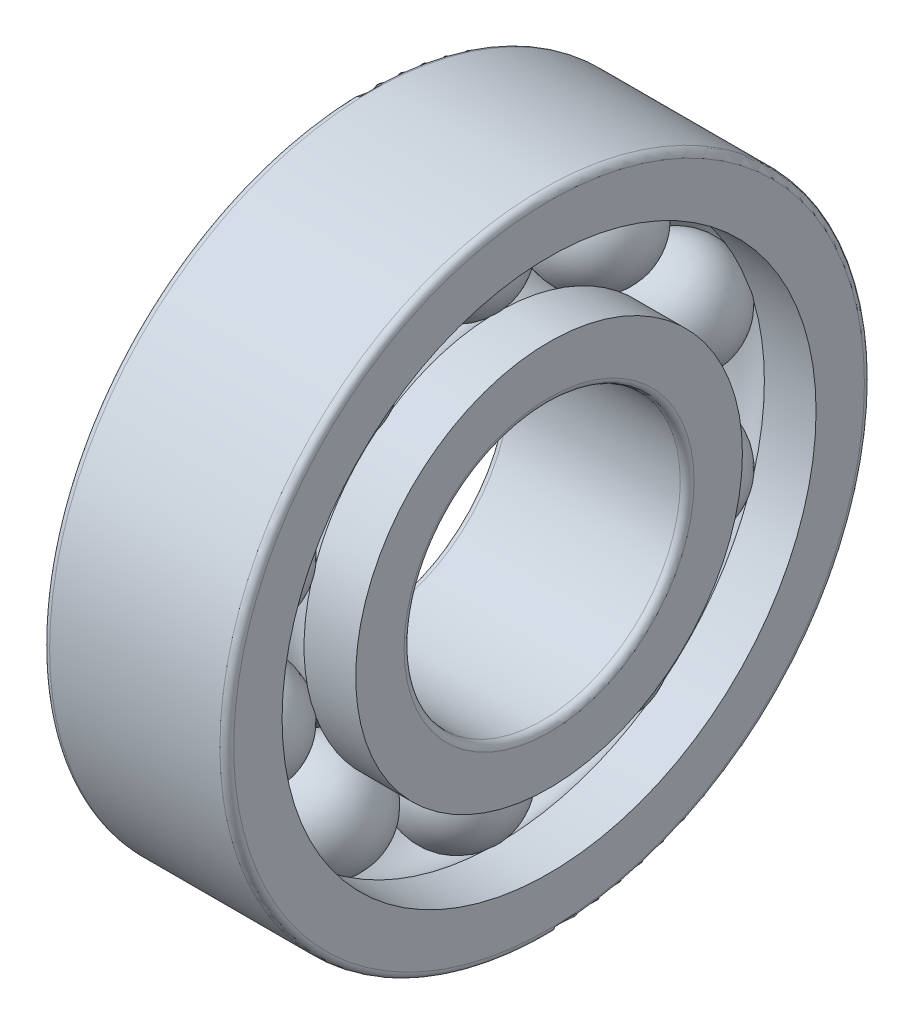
ISO-10303-21;
HEADER;
FILE_DESCRIPTION(('STEP AP214'),'2;1');
FILE_NAME('part.step','',(''),(''),'','','');
FILE_SCHEMA(('AUTOMOTIVE_DESIGN { 1 0 10303 214 1 1 1 1 }'));
ENDSEC;
DATA;
#1=APPLICATION_CONTEXT('core data for automotive mechanical design processes');
#2=APPLICATION_PROTOCOL_DEFINITION('international standard','automotive_design',2000,#1);
#3=PRODUCT_CONTEXT('',#1,'mechanical');
#4=PRODUCT('Part','Part','',(#3));
#5=PRODUCT_RELATED_PRODUCT_CATEGORY('part','',(#4));
#6=PRODUCT_DEFINITION_FORMATION('','',#4);
#7=PRODUCT_DEFINITION_CONTEXT('part definition',#1,'design');
#8=PRODUCT_DEFINITION('design','',#6,#7);
#9=PRODUCT_DEFINITION_SHAPE('','',#8);
#10=(LENGTH_UNIT() NAMED_UNIT(*) SI_UNIT(.MILLI.,.METRE.));
#11=(NAMED_UNIT(*) PLANE_ANGLE_UNIT() SI_UNIT($,.RADIAN.));
#12=(NAMED_UNIT(*) SI_UNIT($,.STERADIAN.) SOLID_ANGLE_UNIT());
#13=UNCERTAINTY_MEASURE_WITH_UNIT(LENGTH_MEASURE(1.E-05),#10,'distance_accuracy_value','');
#14=(GEOMETRIC_REPRESENTATION_CONTEXT(3) GLOBAL_UNCERTAINTY_ASSIGNED_CONTEXT((#13)) GLOBAL_UNIT_ASSIGNED_CONTEXT((#10,
#11,#12)) REPRESENTATION_CONTEXT('',''));
#15=CARTESIAN_POINT('',(0.,0.,0.));
#16=DIRECTION('',(0.,0.,1.));
#17=DIRECTION('',(1.,0.,0.));
#18=AXIS2_PLACEMENT_3D('',#15,#16,#17);
#19=CARTESIAN_POINT('',(0.,0.,0.));
#20=DIRECTION('',(1.,0.,0.));
#21=DIRECTION('',(0.,0.,-1.));
#22=AXIS2_PLACEMENT_3D('',#19,#20,#21);
#23=TOROIDAL_SURFACE('',#22,10.,2.375);
#24=CARTESIAN_POINT('',(1.75517093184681,0.,0.));
#25=DIRECTION('',(1.,0.,0.));
#26=DIRECTION('',(0.,0.,-1.));
#27=AXIS2_PLACEMENT_3D('',#24,#25,#26);
#28=CIRCLE('',#27,8.4);
#29=CARTESIAN_POINT('',(1.75517093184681,6.60481758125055,5.19002742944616));
#30=VERTEX_POINT('',#29);
#31=CARTESIAN_POINT('',(1.75517093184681,2.8950085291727,7.88536147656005));
#32=VERTEX_POINT('',#31);
#33=EDGE_CURVE('E482',#30,#32,#28,.T.);
#34=ORIENTED_EDGE('',*,*,#33,.F.);
#35=CARTESIAN_POINT('',(-1.75537093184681,6.60499266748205,5.19015975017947));
#36=CARTESIAN_POINT('',(-1.71036516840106,6.56558878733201,5.16038044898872));
#37=CARTESIAN_POINT('',(-1.66329614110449,6.52772182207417,5.13175747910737));
#38=CARTESIAN_POINT('',(-1.56533150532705,6.45528920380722,5.07699841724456));
#39=CARTESIAN_POINT('',(-1.51443607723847,6.42072339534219,5.05086220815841));
#40=CARTESIAN_POINT('',(-1.35663046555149,6.32242382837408,4.97652437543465));
#41=CARTESIAN_POINT('',(-1.24444760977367,6.26395394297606,4.93229227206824));
#42=CARTESIAN_POINT('',(-1.00936852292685,6.16287395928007,4.85581000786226));
#43=CARTESIAN_POINT('',(-0.886467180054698,6.12027147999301,4.82356560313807));
#44=CARTESIAN_POINT('',(-0.633439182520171,6.05212583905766,4.77198180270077));
#45=CARTESIAN_POINT('',(-0.503313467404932,6.0265804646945,4.75264073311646));
#46=CARTESIAN_POINT('',(-0.239542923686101,5.99327570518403,4.72742382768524));
#47=CARTESIAN_POINT('',(-0.105898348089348,5.98551504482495,4.72154702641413));
#48=CARTESIAN_POINT('',(0.161133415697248,5.98799129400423,4.72342208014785));
#49=CARTESIAN_POINT('',(0.294520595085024,5.99822880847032,4.7311743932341));
#50=CARTESIAN_POINT('',(0.557234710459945,6.03641414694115,4.76008594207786));
#51=CARTESIAN_POINT('',(0.68656199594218,6.06436044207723,4.78124402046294));
#52=CARTESIAN_POINT('',(0.937492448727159,6.13716752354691,4.8363537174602));
#53=CARTESIAN_POINT('',(1.05909564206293,6.18202825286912,4.87030529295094));
#54=CARTESIAN_POINT('',(1.28319554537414,6.28380460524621,4.94730923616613));
#55=CARTESIAN_POINT('',(1.38643054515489,6.33968331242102,4.9895783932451));
#56=CARTESIAN_POINT('',(1.53205365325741,6.43259712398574,5.05984036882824));
#57=CARTESIAN_POINT('',(1.57907631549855,6.46510171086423,5.08441718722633));
#58=CARTESIAN_POINT('',(1.66978671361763,6.53295810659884,5.13571546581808));
#59=CARTESIAN_POINT('',(1.71347414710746,6.56831017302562,5.16243712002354));
#60=CARTESIAN_POINT('',(1.75537093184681,6.60499266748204,5.19015975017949));
#61=B_SPLINE_CURVE_WITH_KNOTS('',3,(#35,#36,#37,#38,#39,#40,#41,#42,#43,#44,#45,#46,#47,#48,#49,
#50,#51,#52,#53,#54,#55,#56,#57,#58,#59,#60),.UNSPECIFIED.,.F.,.F.,(4,2,2,2,2,2,2,2,2,2,2,2,4),
(0.,0.200338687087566,0.40066793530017,0.800652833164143,1.20082954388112,1.60095433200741,
2.00105042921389,2.40115997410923,2.80123498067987,3.20130863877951,3.57396279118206,
3.76046464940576,3.94698339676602),.UNSPECIFIED.);
#62=CARTESIAN_POINT('',(-1.75517093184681,6.60481758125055,5.19002742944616));
#63=VERTEX_POINT('',#62);
#64=EDGE_CURVE('E302',#63,#30,#61,.T.);
#65=ORIENTED_EDGE('',*,*,#64,.F.);
#66=CARTESIAN_POINT('',(-1.75517093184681,0.,0.));
#67=DIRECTION('',(1.,0.,0.));
#68=DIRECTION('',(0.,0.,-1.));
#69=AXIS2_PLACEMENT_3D('',#66,#67,#68);
#70=CIRCLE('',#69,8.4);
#71=CARTESIAN_POINT('',(-1.75517093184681,2.89500852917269,7.88536147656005));
#72=VERTEX_POINT('',#71);
#73=EDGE_CURVE('E540',#63,#72,#70,.T.);
#74=ORIENTED_EDGE('',*,*,#73,.T.);
#75=CARTESIAN_POINT('',(1.75537093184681,2.89508026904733,7.88556888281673));
#76=CARTESIAN_POINT('',(1.71036516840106,2.87893493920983,7.83889125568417));
#77=CARTESIAN_POINT('',(1.66329614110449,2.86341441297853,7.79403264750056));
#78=CARTESIAN_POINT('',(1.56533150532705,2.83371836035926,7.70822365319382));
#79=CARTESIAN_POINT('',(1.51443607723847,2.81954277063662,7.66727308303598));
#80=CARTESIAN_POINT('',(1.35663046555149,2.77921952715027,7.55081298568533));
#81=CARTESIAN_POINT('',(1.24444760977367,2.75522048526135,7.48153634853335));
#82=CARTESIAN_POINT('',(1.00936852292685,2.71371696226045,7.36176925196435));
#83=CARTESIAN_POINT('',(0.886467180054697,2.69621560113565,7.31128781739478));
#84=CARTESIAN_POINT('',(0.63343918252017,2.66821465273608,7.23053719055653));
#85=CARTESIAN_POINT('',(0.503313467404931,2.65771415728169,7.20026537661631));
#86=CARTESIAN_POINT('',(0.2395429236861,2.64402319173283,7.16079821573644));
#87=CARTESIAN_POINT('',(0.105898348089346,2.6408321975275,7.15160135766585));
#88=CARTESIAN_POINT('',(-0.161133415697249,2.64185027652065,7.15453583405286));
#89=CARTESIAN_POINT('',(-0.294520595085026,2.64605959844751,7.16666788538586));
#90=CARTESIAN_POINT('',(-0.557234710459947,2.66175619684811,7.21191846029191));
#91=CARTESIAN_POINT('',(-0.686561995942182,2.67324284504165,7.24503517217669));
#92=CARTESIAN_POINT('',(-0.937492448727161,2.70315665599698,7.33130865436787));
#93=CARTESIAN_POINT('',(-1.05909564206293,2.72158379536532,7.38446535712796));
#94=CARTESIAN_POINT('',(-1.28319554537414,2.76336827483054,7.50505594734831));
#95=CARTESIAN_POINT('',(-1.38643054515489,2.78630116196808,7.57126164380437));
#96=CARTESIAN_POINT('',(-1.53205365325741,2.82441232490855,7.68134007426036));
#97=CARTESIAN_POINT('',(-1.57907631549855,2.83774179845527,7.71984842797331));
#98=CARTESIAN_POINT('',(-1.66978671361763,2.86556058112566,7.80023573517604));
#99=CARTESIAN_POINT('',(-1.71347414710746,2.8800499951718,7.84211499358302));
#100=CARTESIAN_POINT('',(-1.75537093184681,2.89508026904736,7.88556888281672));
#101=B_SPLINE_CURVE_WITH_KNOTS('',3,(#75,#76,#77,#78,#79,#80,#81,#82,#83,#84,#85,#86,#87,#88,
#89,#90,#91,#92,#93,#94,#95,#96,#97,#98,#99,#100),.UNSPECIFIED.,.F.,.F.,(4,2,2,2,2,2,2,2,2,2,2,
2,4),(0.,0.200338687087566,0.400667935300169,0.800652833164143,1.20082954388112,
1.60095433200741,2.00105042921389,2.40115997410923,2.80123498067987,3.20130863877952,
3.57396279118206,3.76046464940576,3.94698339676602),.UNSPECIFIED.);
#102=EDGE_CURVE('E485',#32,#72,#101,.T.);
#103=ORIENTED_EDGE('',*,*,#102,.F.);
#104=EDGE_LOOP('',(#34,#65,#74,#103));
#105=FACE_BOUND('',#104,.T.);
#106=ADVANCED_FACE('F33',(#105),#23,.F.);
#107=CARTESIAN_POINT('',(-1.75517093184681,8.39403125,0.31660602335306));
#108=VERTEX_POINT('',#107);
#109=CARTESIAN_POINT('',(-1.75517093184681,6.97701028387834,4.67774812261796));
#110=VERTEX_POINT('',#109);
#111=EDGE_CURVE('E320',#108,#110,#70,.T.);
#112=ORIENTED_EDGE('',*,*,#111,.T.);
#113=CARTESIAN_POINT('',(1.75537093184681,6.977190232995,4.67787375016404));
#114=CARTESIAN_POINT('',(1.71036516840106,6.93669196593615,4.64960074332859));
#115=CARTESIAN_POINT('',(1.66329614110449,6.89776836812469,4.62243210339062));
#116=CARTESIAN_POINT('',(1.56533150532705,6.82330649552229,4.57046607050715));
#117=CARTESIAN_POINT('',(1.51443607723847,6.78776806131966,4.54566856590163));
#118=CARTESIAN_POINT('',(1.35663046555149,6.68669234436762,4.47515177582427));
#119=CARTESIAN_POINT('',(1.24444760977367,6.62655692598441,4.43321208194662));
#120=CARTESIAN_POINT('',(1.00936852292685,6.5225825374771,4.36071362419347));
#121=CARTESIAN_POINT('',(0.886467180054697,6.47875139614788,4.33016032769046));
#122=CARTESIAN_POINT('',(0.63343918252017,6.40863412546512,4.28129024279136));
#123=CARTESIAN_POINT('',(0.503313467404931,6.38234572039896,4.26297186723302));
#124=CARTESIAN_POINT('',(0.2395429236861,6.3480712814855,4.23908961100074));
#125=CARTESIAN_POINT('',(0.105898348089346,6.34008393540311,4.23352481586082));
#126=CARTESIAN_POINT('',(-0.161133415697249,6.34263242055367,4.23530044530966));
#127=CARTESIAN_POINT('',(-0.294520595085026,6.35316887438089,4.24264130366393));
#128=CARTESIAN_POINT('',(-0.557234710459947,6.39246530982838,4.27002355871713));
#129=CARTESIAN_POINT('',(-0.686561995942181,6.42122371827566,4.2900638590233));
#130=CARTESIAN_POINT('',(-0.93749244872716,6.49613478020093,4.34227767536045));
#131=CARTESIAN_POINT('',(-1.05909564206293,6.54228737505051,4.37445115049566));
#132=CARTESIAN_POINT('',(-1.28319554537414,6.64697309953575,4.44745068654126));
#133=CARTESIAN_POINT('',(-1.38643054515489,6.70444092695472,4.48753260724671));
#134=CARTESIAN_POINT('',(-1.53205365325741,6.7999759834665,4.55418674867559));
#135=CARTESIAN_POINT('',(-1.57907631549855,6.8333943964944,4.57750579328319));
#136=CARTESIAN_POINT('',(-1.66978671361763,6.90315073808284,4.62618902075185));
#137=CARTESIAN_POINT('',(-1.71347414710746,6.93948893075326,4.65155338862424));
#138=CARTESIAN_POINT('',(-1.75537093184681,6.97719023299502,4.67787375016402));
#139=B_SPLINE_CURVE_WITH_KNOTS('',3,(#113,#114,#115,#116,#117,#118,#119,#120,#121,#122,#123,
#124,#125,#126,#127,#128,#129,#130,#131,#132,#133,#134,#135,#136,#137,#138),.UNSPECIFIED.,.F.,
.F.,(4,2,2,2,2,2,2,2,2,2,2,2,4),(0.,0.200338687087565,0.400667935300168,0.800652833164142,
1.20082954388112,1.60095433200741,2.00105042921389,2.40115997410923,2.80123498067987,
3.20130863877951,3.57396279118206,3.76046464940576,3.94698339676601),.UNSPECIFIED.);
#140=CARTESIAN_POINT('',(1.75517093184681,6.97701028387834,4.67774812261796));
#141=VERTEX_POINT('',#140);
#142=EDGE_CURVE('E53',#141,#110,#139,.T.);
#143=ORIENTED_EDGE('',*,*,#142,.F.);
#144=CARTESIAN_POINT('',(1.75517093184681,8.39403125,0.316606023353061));
#145=VERTEX_POINT('',#144);
#146=EDGE_CURVE('E431',#145,#141,#28,.T.);
#147=ORIENTED_EDGE('',*,*,#146,.F.);
#148=CARTESIAN_POINT('',(-1.75537093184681,8.39425067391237,0.316610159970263));
#149=CARTESIAN_POINT('',(-1.71036516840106,8.34486843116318,0.315679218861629));
#150=CARTESIAN_POINT('',(-1.66329614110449,8.29740925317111,0.314780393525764));
#151=CARTESIAN_POINT('',(-1.56533150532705,8.20662346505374,0.31305420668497));
#152=CARTESIAN_POINT('',(-1.51443607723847,8.16329666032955,0.312226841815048));
#153=CARTESIAN_POINT('',(-1.35663046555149,8.04007595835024,0.309865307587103));
#154=CARTESIAN_POINT('',(-1.24444760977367,7.96677384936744,0.30844852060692));
#155=CARTESIAN_POINT('',(-1.00936852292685,7.84004327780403,0.30598639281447));
#156=CARTESIAN_POINT('',(-0.886467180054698,7.78662436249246,0.304941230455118));
#157=CARTESIAN_POINT('',(-0.633439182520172,7.70117318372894,0.303264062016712));
#158=CARTESIAN_POINT('',(-0.503313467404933,7.66913814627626,0.302632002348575));
#159=CARTESIAN_POINT('',(-0.239542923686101,7.62737190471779,0.301807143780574));
#160=CARTESIAN_POINT('',(-0.105898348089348,7.61763910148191,0.301614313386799));
#161=CARTESIAN_POINT('',(0.161133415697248,7.62074455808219,0.301675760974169));
#162=CARTESIAN_POINT('',(0.294520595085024,7.63358357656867,0.301930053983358));
#163=CARTESIAN_POINT('',(0.557234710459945,7.68146994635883,0.302875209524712));
#164=CARTESIAN_POINT('',(0.68656199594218,7.71651538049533,0.303566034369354));
#165=CARTESIAN_POINT('',(0.937492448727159,7.80781021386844,0.305355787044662));
#166=CARTESIAN_POINT('',(1.05909564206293,7.86405954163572,0.306454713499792));
#167=CARTESIAN_POINT('',(1.28319554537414,7.99166012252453,0.308929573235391));
#168=CARTESIAN_POINT('',(1.38643054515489,8.06171213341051,0.310281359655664));
#169=CARTESIAN_POINT('',(1.53205365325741,8.17817993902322,0.312511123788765));
#170=CARTESIAN_POINT('',(1.57907631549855,8.21892259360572,0.313288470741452));
#171=CARTESIAN_POINT('',(1.66978671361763,8.30397194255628,0.314904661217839));
#172=CARTESIAN_POINT('',(1.71347414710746,8.34827895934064,0.31574351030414));
#173=CARTESIAN_POINT('',(1.75537093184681,8.39425067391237,0.316610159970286));
#174=B_SPLINE_CURVE_WITH_KNOTS('',3,(#148,#149,#150,#151,#152,#153,#154,#155,#156,#157,#158,
#159,#160,#161,#162,#163,#164,#165,#166,#167,#168,#169,#170,#171,#172,#173),.UNSPECIFIED.,.F.,
.F.,(4,2,2,2,2,2,2,2,2,2,2,2,4),(0.,0.200338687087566,0.400667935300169,0.800652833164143,
1.20082954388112,1.60095433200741,2.00105042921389,2.40115997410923,2.80123498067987,
3.20130863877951,3.57396279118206,3.76046464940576,3.94698339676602),.UNSPECIFIED.);
#175=EDGE_CURVE('E430',#108,#145,#174,.T.);
#176=ORIENTED_EDGE('',*,*,#175,.F.);
#177=EDGE_LOOP('',(#112,#143,#147,#176));
#178=FACE_BOUND('',#177,.T.);
#179=ADVANCED_FACE('F451',(#178),#23,.F.);
#180=CARTESIAN_POINT('',(-20.6375,0.,0.));
#181=DIRECTION('',(1.,0.,0.));
#182=DIRECTION('',(0.,0.,-1.));
#183=AXIS2_PLACEMENT_3D('',#180,#181,#182);
#184=CYLINDRICAL_SURFACE('',#183,8.4);
#185=CARTESIAN_POINT('',(4.,0.,0.));
#186=DIRECTION('',(1.,0.,0.));
#187=DIRECTION('',(0.,0.,-1.));
#188=AXIS2_PLACEMENT_3D('',#185,#186,#187);
#189=CIRCLE('',#188,8.4);
#190=CARTESIAN_POINT('',(4.,0.,-8.4));
#191=VERTEX_POINT('',#190);
#192=EDGE_CURVE('E520',#191,#191,#189,.T.);
#193=ORIENTED_EDGE('',*,*,#192,.F.);
#194=EDGE_LOOP('',(#193));
#195=FACE_BOUND('',#194,.T.);
#196=ORIENTED_EDGE('',*,*,#146,.T.);
#197=CARTESIAN_POINT('',(1.75497093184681,6.60424297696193,5.19075858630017));
#198=CARTESIAN_POINT('',(1.76384428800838,6.62970308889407,5.1583667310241));
#199=CARTESIAN_POINT('',(1.77099935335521,6.65513892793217,5.12551142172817));
#200=CARTESIAN_POINT('',(1.781813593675,6.70579396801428,5.05905887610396));
#201=CARTESIAN_POINT('',(1.78547221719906,6.7310131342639,5.02546152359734));
#202=CARTESIAN_POINT('',(1.79104031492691,6.80513986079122,4.92512391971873));
#203=CARTESIAN_POINT('',(1.78787795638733,6.85348740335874,4.85760449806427));
#204=CARTESIAN_POINT('',(1.77241115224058,6.92658213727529,4.75233142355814));
#205=CARTESIAN_POINT('',(1.76474118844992,6.95235382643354,4.71455192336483));
#206=CARTESIAN_POINT('',(1.75497093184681,6.97752809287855,4.67697570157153));
#207=B_SPLINE_CURVE_WITH_KNOTS('',3,(#197,#198,#199,#200,#201,#202,#203,#204,#205,#206),
.UNSPECIFIED.,.F.,.F.,(4,2,2,2,4),(0.,0.126355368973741,0.252730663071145,0.500726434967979,
0.639609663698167),.UNSPECIFIED.);
#208=EDGE_CURVE('E1340',#30,#141,#207,.T.);
#209=ORIENTED_EDGE('',*,*,#208,.F.);
#210=ORIENTED_EDGE('',*,*,#33,.T.);
#211=CARTESIAN_POINT('',(1.75497093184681,2.29189345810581,8.08128853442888));
#212=CARTESIAN_POINT('',(1.76384428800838,2.33153057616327,8.07004805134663));
#213=CARTESIAN_POINT('',(1.77099935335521,2.37142046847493,8.05841835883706));
#214=CARTESIAN_POINT('',(1.781813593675,2.45146108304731,8.03443140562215));
#215=CARTESIAN_POINT('',(1.78547221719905,2.49161184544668,8.02207403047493));
#216=CARTESIAN_POINT('',(1.79104031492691,2.61055859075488,7.98446980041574));
#217=CARTESIAN_POINT('',(1.78787795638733,2.68935949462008,7.95826341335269));
#218=CARTESIAN_POINT('',(1.77241115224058,2.81037233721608,7.91605971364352));
#219=CARTESIAN_POINT('',(1.76474118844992,2.85342830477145,7.90064367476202));
#220=CARTESIAN_POINT('',(1.75497093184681,2.89588146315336,7.88504093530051));
#221=B_SPLINE_CURVE_WITH_KNOTS('',3,(#211,#212,#213,#214,#215,#216,#217,#218,#219,#220),
.UNSPECIFIED.,.F.,.F.,(4,2,2,2,4),(0.,0.126355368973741,0.252730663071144,0.500726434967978,
0.639609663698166),.UNSPECIFIED.);
#222=CARTESIAN_POINT('',(1.75517093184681,2.29278808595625,8.08103476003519));
#223=VERTEX_POINT('',#222);
#224=EDGE_CURVE('E677',#223,#32,#221,.T.);
#225=ORIENTED_EDGE('',*,*,#224,.F.);
#226=CARTESIAN_POINT('',(1.75517093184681,-2.29278808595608,8.08103476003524));
#227=VERTEX_POINT('',#226);
#228=EDGE_CURVE('E490',#223,#227,#28,.T.);
#229=ORIENTED_EDGE('',*,*,#228,.T.);
#230=CARTESIAN_POINT('',(1.75497093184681,-2.8958814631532,7.88504093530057));
#231=CARTESIAN_POINT('',(1.76384428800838,-2.85720737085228,7.89924530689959));
#232=CARTESIAN_POINT('',(1.77099935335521,-2.81810000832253,7.91328337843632));
#233=CARTESIAN_POINT('',(1.781813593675,-2.73924661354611,7.94092421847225));
#234=CARTESIAN_POINT('',(1.78547221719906,-2.69950048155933,7.95452691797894));
#235=CARTESIAN_POINT('',(1.79104031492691,-2.5811673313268,7.99401959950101));
#236=CARTESIAN_POINT('',(1.78787795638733,-2.50201233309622,8.01913619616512));
#237=CARTESIAN_POINT('',(1.77241115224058,-2.37930417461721,8.05612225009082));
#238=CARTESIAN_POINT('',(1.76474118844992,-2.33540984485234,8.06895807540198));
#239=CARTESIAN_POINT('',(1.75497093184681,-2.29189345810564,8.08128853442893));
#240=B_SPLINE_CURVE_WITH_KNOTS('',3,(#230,#231,#232,#233,#234,#235,#236,#237,#238,#239),
.UNSPECIFIED.,.F.,.F.,(4,2,2,2,4),(0.,0.126355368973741,0.252730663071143,0.500726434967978,
0.639609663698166),.UNSPECIFIED.);
#241=CARTESIAN_POINT('',(1.75517093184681,-2.89500852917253,7.88536147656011));
#242=VERTEX_POINT('',#241);
#243=EDGE_CURVE('E773',#242,#227,#240,.T.);
#244=ORIENTED_EDGE('',*,*,#243,.F.);
#245=CARTESIAN_POINT('',(1.75517093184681,-6.60481758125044,5.19002742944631));
#246=VERTEX_POINT('',#245);
#247=EDGE_CURVE('E493',#242,#246,#28,.T.);
#248=ORIENTED_EDGE('',*,*,#247,.T.);
#249=CARTESIAN_POINT('',(1.75497093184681,-6.97752809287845,4.67697570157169));
#250=CARTESIAN_POINT('',(1.76384428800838,-6.95458921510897,4.71119934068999));
#251=CARTESIAN_POINT('',(1.77099935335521,-6.93120206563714,4.7455431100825));
#252=CARTESIAN_POINT('',(1.781813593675,-6.88365520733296,4.81425388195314));
#253=CARTESIAN_POINT('',(1.78547221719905,-6.85949537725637,4.84862088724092));
#254=CARTESIAN_POINT('',(1.79104031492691,-6.7869750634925,4.95012561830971));
#255=CARTESIAN_POINT('',(1.78787795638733,-6.73770048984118,5.016971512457));
#256=CARTESIAN_POINT('',(1.77241115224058,-6.66016736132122,5.1190199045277));
#257=CARTESIAN_POINT('',(1.76474118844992,-6.63220081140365,5.15520474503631));
#258=CARTESIAN_POINT('',(1.75497093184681,-6.60424297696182,5.19075858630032));
#259=B_SPLINE_CURVE_WITH_KNOTS('',3,(#249,#250,#251,#252,#253,#254,#255,#256,#257,#258),
.UNSPECIFIED.,.F.,.F.,(4,2,2,2,4),(0.,0.126355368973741,0.252730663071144,0.500726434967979,
0.639609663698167),.UNSPECIFIED.);
#260=CARTESIAN_POINT('',(1.75517093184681,-6.97701028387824,4.67774812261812));
#261=VERTEX_POINT('',#260);
#262=EDGE_CURVE('E830',#261,#246,#259,.T.);
#263=ORIENTED_EDGE('',*,*,#262,.F.);
#264=CARTESIAN_POINT('',(1.75517093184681,-8.39403125,0.31660602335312));
#265=VERTEX_POINT('',#264);
#266=EDGE_CURVE('E497',#261,#265,#28,.T.);
#267=ORIENTED_EDGE('',*,*,#266,.T.);
#268=CARTESIAN_POINT('',(1.75497093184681,-8.39399614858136,-0.317535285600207));
#269=CARTESIAN_POINT('',(1.76384428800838,-8.39555435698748,-0.276364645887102));
#270=CARTESIAN_POINT('',(1.77099935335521,-8.39682051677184,-0.234833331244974));
#271=CARTESIAN_POINT('',(1.781813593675,-8.39874147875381,-0.15129780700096));
#272=CARTESIAN_POINT('',(1.78547221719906,-8.39939618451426,-0.109293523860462));
#273=CARTESIAN_POINT('',(1.79104031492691,-8.40038900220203,0.0154518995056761));
#274=CARTESIAN_POINT('',(1.78787795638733,-8.39981606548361,0.0984942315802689));
#275=CARTESIAN_POINT('',(1.77241115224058,-8.39707298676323,0.226625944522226));
#276=CARTESIAN_POINT('',(1.76474118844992,-8.39571648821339,0.272338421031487));
#277=CARTESIAN_POINT('',(1.75497093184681,-8.39399614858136,0.317535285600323));
#278=B_SPLINE_CURVE_WITH_KNOTS('',3,(#268,#269,#270,#271,#272,#273,#274,#275,#276,#277),
.UNSPECIFIED.,.F.,.F.,(4,2,2,2,4),(0.,0.126355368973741,0.252730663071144,0.500726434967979,
0.639609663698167),.UNSPECIFIED.);
#279=CARTESIAN_POINT('',(1.75517093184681,-8.39403125,-0.316606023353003));
#280=VERTEX_POINT('',#279);
#281=EDGE_CURVE('E887',#280,#265,#278,.T.);
#282=ORIENTED_EDGE('',*,*,#281,.F.);
#283=CARTESIAN_POINT('',(1.75517093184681,-6.9770102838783,-4.67774812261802));
#284=VERTEX_POINT('',#283);
#285=EDGE_CURVE('E501',#280,#284,#28,.T.);
#286=ORIENTED_EDGE('',*,*,#285,.T.);
#287=CARTESIAN_POINT('',(1.75497093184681,-6.60424297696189,-5.19075858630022));
#288=CARTESIAN_POINT('',(1.76384428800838,-6.62970308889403,-5.15836673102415));
#289=CARTESIAN_POINT('',(1.77099935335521,-6.65513892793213,-5.12551142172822));
#290=CARTESIAN_POINT('',(1.781813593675,-6.70579396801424,-5.05905887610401));
#291=CARTESIAN_POINT('',(1.78547221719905,-6.73101313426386,-5.0254615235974));
#292=CARTESIAN_POINT('',(1.79104031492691,-6.80513986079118,-4.92512391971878));
#293=CARTESIAN_POINT('',(1.78787795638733,-6.8534874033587,-4.85760449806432));
#294=CARTESIAN_POINT('',(1.77241115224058,-6.92658213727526,-4.75233142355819));
#295=CARTESIAN_POINT('',(1.76474118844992,-6.9523538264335,-4.71455192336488));
#296=CARTESIAN_POINT('',(1.75497093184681,-6.97752809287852,-4.67697570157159));
#297=B_SPLINE_CURVE_WITH_KNOTS('',3,(#287,#288,#289,#290,#291,#292,#293,#294,#295,#296),
.UNSPECIFIED.,.F.,.F.,(4,2,2,2,4),(0.,0.126355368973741,0.252730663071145,0.500726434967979,
0.639609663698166),.UNSPECIFIED.);
#298=CARTESIAN_POINT('',(1.75517093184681,-6.60481758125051,-5.19002742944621));
#299=VERTEX_POINT('',#298);
#300=EDGE_CURVE('E944',#299,#284,#297,.T.);
#301=ORIENTED_EDGE('',*,*,#300,.F.);
#302=CARTESIAN_POINT('',(1.75517093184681,-2.89500852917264,-7.88536147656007));
#303=VERTEX_POINT('',#302);
#304=EDGE_CURVE('E505',#299,#303,#28,.T.);
#305=ORIENTED_EDGE('',*,*,#304,.T.);
#306=CARTESIAN_POINT('',(1.75497093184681,-2.29189345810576,-8.0812885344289));
#307=CARTESIAN_POINT('',(1.76384428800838,-2.33153057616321,-8.07004805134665));
#308=CARTESIAN_POINT('',(1.77099935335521,-2.37142046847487,-8.05841835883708));
#309=CARTESIAN_POINT('',(1.781813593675,-2.45146108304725,-8.03443140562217));
#310=CARTESIAN_POINT('',(1.78547221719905,-2.49161184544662,-8.02207403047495));
#311=CARTESIAN_POINT('',(1.79104031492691,-2.61055859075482,-7.98446980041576));
#312=CARTESIAN_POINT('',(1.78787795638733,-2.68935949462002,-7.95826341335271));
#313=CARTESIAN_POINT('',(1.77241115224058,-2.81037233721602,-7.91605971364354));
#314=CARTESIAN_POINT('',(1.76474118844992,-2.8534283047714,-7.90064367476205));
#315=CARTESIAN_POINT('',(1.75497093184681,-2.89588146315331,-7.88504093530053));
#316=B_SPLINE_CURVE_WITH_KNOTS('',3,(#306,#307,#308,#309,#310,#311,#312,#313,#314,#315),
.UNSPECIFIED.,.F.,.F.,(4,2,2,2,4),(0.,0.126355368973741,0.252730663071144,0.500726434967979,
0.639609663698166),.UNSPECIFIED.);
#317=CARTESIAN_POINT('',(1.75517093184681,-2.29278808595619,-8.08103476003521));
#318=VERTEX_POINT('',#317);
#319=EDGE_CURVE('E1001',#318,#303,#316,.T.);
#320=ORIENTED_EDGE('',*,*,#319,.F.);
#321=CARTESIAN_POINT('',(1.75517093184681,2.29278808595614,-8.08103476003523));
#322=VERTEX_POINT('',#321);
#323=EDGE_CURVE('E509',#318,#322,#28,.T.);
#324=ORIENTED_EDGE('',*,*,#323,.T.);
#325=CARTESIAN_POINT('',(1.75497093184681,2.89588146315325,-7.88504093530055));
#326=CARTESIAN_POINT('',(1.76384428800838,2.85720737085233,-7.89924530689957));
#327=CARTESIAN_POINT('',(1.77099935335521,2.81810000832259,-7.9132833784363));
#328=CARTESIAN_POINT('',(1.781813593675,2.73924661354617,-7.94092421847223));
#329=CARTESIAN_POINT('',(1.78547221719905,2.69950048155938,-7.95452691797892));
#330=CARTESIAN_POINT('',(1.79104031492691,2.58116733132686,-7.994019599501));
#331=CARTESIAN_POINT('',(1.78787795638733,2.50201233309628,-8.0191361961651));
#332=CARTESIAN_POINT('',(1.77241115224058,2.37930417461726,-8.05612225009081));
#333=CARTESIAN_POINT('',(1.76474118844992,2.3354098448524,-8.06895807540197));
#334=CARTESIAN_POINT('',(1.75497093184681,2.2918934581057,-8.08128853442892));
#335=B_SPLINE_CURVE_WITH_KNOTS('',3,(#325,#326,#327,#328,#329,#330,#331,#332,#333,#334),
.UNSPECIFIED.,.F.,.F.,(4,2,2,2,4),(0.,0.12635536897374,0.252730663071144,0.500726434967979,
0.639609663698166),.UNSPECIFIED.);
#336=CARTESIAN_POINT('',(1.75517093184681,2.89500852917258,-7.88536147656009));
#337=VERTEX_POINT('',#336);
#338=EDGE_CURVE('E1057',#337,#322,#335,.T.);
#339=ORIENTED_EDGE('',*,*,#338,.F.);
#340=CARTESIAN_POINT('',(1.75517093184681,6.60481758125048,-5.19002742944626));
#341=VERTEX_POINT('',#340);
#342=EDGE_CURVE('E513',#337,#341,#28,.T.);
#343=ORIENTED_EDGE('',*,*,#342,.T.);
#344=CARTESIAN_POINT('',(1.75497093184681,6.97752809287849,-4.67697570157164));
#345=CARTESIAN_POINT('',(1.76384428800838,6.954589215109,-4.71119934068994));
#346=CARTESIAN_POINT('',(1.77099935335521,6.93120206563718,-4.74554311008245));
#347=CARTESIAN_POINT('',(1.781813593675,6.88365520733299,-4.81425388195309));
#348=CARTESIAN_POINT('',(1.78547221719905,6.85949537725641,-4.84862088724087));
#349=CARTESIAN_POINT('',(1.79104031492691,6.78697506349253,-4.95012561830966));
#350=CARTESIAN_POINT('',(1.78787795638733,6.73770048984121,-5.01697151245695));
#351=CARTESIAN_POINT('',(1.77241115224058,6.66016736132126,-5.11901990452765));
#352=CARTESIAN_POINT('',(1.76474118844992,6.63220081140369,-5.15520474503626));
#353=CARTESIAN_POINT('',(1.75497093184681,6.60424297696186,-5.19075858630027));
#354=B_SPLINE_CURVE_WITH_KNOTS('',3,(#344,#345,#346,#347,#348,#349,#350,#351,#352,#353),
.UNSPECIFIED.,.F.,.F.,(4,2,2,2,4),(0.,0.126355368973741,0.252730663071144,0.500726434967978,
0.639609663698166),.UNSPECIFIED.);
#355=CARTESIAN_POINT('',(1.75517093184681,6.97701028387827,-4.67774812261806));
#356=VERTEX_POINT('',#355);
#357=EDGE_CURVE('E589',#356,#341,#354,.T.);
#358=ORIENTED_EDGE('',*,*,#357,.F.);
#359=CARTESIAN_POINT('',(1.75517093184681,8.39403125,-0.316606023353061));
#360=VERTEX_POINT('',#359);
#361=EDGE_CURVE('E492',#356,#360,#28,.T.);
#362=ORIENTED_EDGE('',*,*,#361,.T.);
#363=CARTESIAN_POINT('',(1.75497093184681,8.39399614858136,0.317535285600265));
#364=CARTESIAN_POINT('',(1.76384428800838,8.39555435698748,0.27636464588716));
#365=CARTESIAN_POINT('',(1.77099935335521,8.39682051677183,0.234833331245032));
#366=CARTESIAN_POINT('',(1.781813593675,8.39874147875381,0.151297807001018));
#367=CARTESIAN_POINT('',(1.78547221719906,8.39939618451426,0.109293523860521));
#368=CARTESIAN_POINT('',(1.79104031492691,8.40038900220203,-0.0154518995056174));
#369=CARTESIAN_POINT('',(1.78787795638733,8.39981606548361,-0.0984942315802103));
#370=CARTESIAN_POINT('',(1.77241115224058,8.39707298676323,-0.226625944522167));
#371=CARTESIAN_POINT('',(1.76474118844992,8.39571648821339,-0.272338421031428));
#372=CARTESIAN_POINT('',(1.75497093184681,8.39399614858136,-0.317535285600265));
#373=B_SPLINE_CURVE_WITH_KNOTS('',3,(#363,#364,#365,#366,#367,#368,#369,#370,#371,#372),
.UNSPECIFIED.,.F.,.F.,(4,2,2,2,4),(0.,0.126355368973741,0.252730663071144,0.500726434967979,
0.639609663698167),.UNSPECIFIED.);
#374=EDGE_CURVE('E392',#145,#360,#373,.T.);
#375=ORIENTED_EDGE('',*,*,#374,.F.);
#376=EDGE_LOOP('',(#196,#209,#210,#225,#229,#244,#248,#263,#267,#282,#286,#301,#305,#320,#324,
#339,#343,#358,#362,#375));
#377=FACE_BOUND('',#376,.T.);
#378=ADVANCED_FACE('F418',(#195,#377),#184,.T.);
#379=CARTESIAN_POINT('',(-20.6375,0.,0.));
#380=DIRECTION('',(1.,0.,0.));
#381=DIRECTION('',(0.,0.,-1.));
#382=AXIS2_PLACEMENT_3D('',#379,#380,#381);
#383=CYLINDRICAL_SURFACE('',#382,8.4);
#384=CARTESIAN_POINT('',(-4.,0.,0.));
#385=DIRECTION('',(1.,0.,0.));
#386=DIRECTION('',(0.,0.,-1.));
#387=AXIS2_PLACEMENT_3D('',#384,#385,#386);
#388=CIRCLE('',#387,8.4);
#389=CARTESIAN_POINT('',(-4.,0.,-8.4));
#390=VERTEX_POINT('',#389);
#391=EDGE_CURVE('E537',#390,#390,#388,.T.);
#392=ORIENTED_EDGE('',*,*,#391,.T.);
#393=EDGE_LOOP('',(#392));
#394=FACE_BOUND('',#393,.T.);
#395=ORIENTED_EDGE('',*,*,#73,.F.);
#396=CARTESIAN_POINT('',(-1.75497093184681,6.97752809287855,4.67697570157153));
#397=CARTESIAN_POINT('',(-1.76384428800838,6.95458921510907,4.71119934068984));
#398=CARTESIAN_POINT('',(-1.77099935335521,6.93120206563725,4.74554311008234));
#399=CARTESIAN_POINT('',(-1.781813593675,6.88365520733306,4.81425388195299));
#400=CARTESIAN_POINT('',(-1.78547221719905,6.85949537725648,4.84862088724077));
#401=CARTESIAN_POINT('',(-1.79104031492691,6.7869750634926,4.95012561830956));
#402=CARTESIAN_POINT('',(-1.78787795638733,6.73770048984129,5.01697151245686));
#403=CARTESIAN_POINT('',(-1.77241115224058,6.66016736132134,5.11901990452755));
#404=CARTESIAN_POINT('',(-1.76474118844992,6.63220081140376,5.15520474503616));
#405=CARTESIAN_POINT('',(-1.75497093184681,6.60424297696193,5.19075858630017));
#406=B_SPLINE_CURVE_WITH_KNOTS('',3,(#396,#397,#398,#399,#400,#401,#402,#403,#404,#405),
.UNSPECIFIED.,.F.,.F.,(4,2,2,2,4),(0.,0.126355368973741,0.252730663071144,0.500726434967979,
0.639609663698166),.UNSPECIFIED.);
#407=EDGE_CURVE('E680',#110,#63,#406,.T.);
#408=ORIENTED_EDGE('',*,*,#407,.F.);
#409=ORIENTED_EDGE('',*,*,#111,.F.);
#410=CARTESIAN_POINT('',(-1.75497093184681,8.39399614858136,-0.317535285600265));
#411=CARTESIAN_POINT('',(-1.76384428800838,8.39555435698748,-0.27636464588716));
#412=CARTESIAN_POINT('',(-1.77099935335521,8.39682051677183,-0.234833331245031));
#413=CARTESIAN_POINT('',(-1.781813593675,8.39874147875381,-0.151297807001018));
#414=CARTESIAN_POINT('',(-1.78547221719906,8.39939618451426,-0.10929352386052));
#415=CARTESIAN_POINT('',(-1.79104031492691,8.40038900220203,0.015451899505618));
#416=CARTESIAN_POINT('',(-1.78787795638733,8.39981606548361,0.0984942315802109));
#417=CARTESIAN_POINT('',(-1.77241115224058,8.39707298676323,0.226625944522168));
#418=CARTESIAN_POINT('',(-1.76474118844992,8.39571648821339,0.272338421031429));
#419=CARTESIAN_POINT('',(-1.75497093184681,8.39399614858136,0.317535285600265));
#420=B_SPLINE_CURVE_WITH_KNOTS('',3,(#410,#411,#412,#413,#414,#415,#416,#417,#418,#419),
.UNSPECIFIED.,.F.,.F.,(4,2,2,2,4),(0.,0.126355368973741,0.252730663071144,0.500726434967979,
0.639609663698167),.UNSPECIFIED.);
#421=CARTESIAN_POINT('',(-1.75517093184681,8.39403125,-0.31660602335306));
#422=VERTEX_POINT('',#421);
#423=EDGE_CURVE('E423',#422,#108,#420,.T.);
#424=ORIENTED_EDGE('',*,*,#423,.F.);
#425=CARTESIAN_POINT('',(-1.75517093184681,6.97701028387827,-4.67774812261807));
#426=VERTEX_POINT('',#425);
#427=EDGE_CURVE('E315',#426,#422,#70,.T.);
#428=ORIENTED_EDGE('',*,*,#427,.F.);
#429=CARTESIAN_POINT('',(-1.75497093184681,6.60424297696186,-5.19075858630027));
#430=CARTESIAN_POINT('',(-1.76384428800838,6.629703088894,-5.15836673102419));
#431=CARTESIAN_POINT('',(-1.77099935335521,6.65513892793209,-5.12551142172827));
#432=CARTESIAN_POINT('',(-1.781813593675,6.70579396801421,-5.05905887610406));
#433=CARTESIAN_POINT('',(-1.78547221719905,6.73101313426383,-5.02546152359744));
#434=CARTESIAN_POINT('',(-1.79104031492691,6.80513986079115,-4.92512391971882));
#435=CARTESIAN_POINT('',(-1.78787795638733,6.85348740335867,-4.85760449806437));
#436=CARTESIAN_POINT('',(-1.77241115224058,6.92658213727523,-4.75233142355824));
#437=CARTESIAN_POINT('',(-1.76474118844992,6.95235382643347,-4.71455192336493));
#438=CARTESIAN_POINT('',(-1.75497093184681,6.97752809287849,-4.67697570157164));
#439=B_SPLINE_CURVE_WITH_KNOTS('',3,(#429,#430,#431,#432,#433,#434,#435,#436,#437,#438),
.UNSPECIFIED.,.F.,.F.,(4,2,2,2,4),(0.,0.126355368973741,0.252730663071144,0.500726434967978,
0.639609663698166),.UNSPECIFIED.);
#440=CARTESIAN_POINT('',(-1.75517093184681,6.60481758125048,-5.19002742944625));
#441=VERTEX_POINT('',#440);
#442=EDGE_CURVE('E353',#441,#426,#439,.T.);
#443=ORIENTED_EDGE('',*,*,#442,.F.);
#444=CARTESIAN_POINT('',(-1.75517093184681,2.89500852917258,-7.88536147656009));
#445=VERTEX_POINT('',#444);
#446=EDGE_CURVE('E318',#445,#441,#70,.T.);
#447=ORIENTED_EDGE('',*,*,#446,.F.);
#448=CARTESIAN_POINT('',(-1.75497093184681,2.2918934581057,-8.08128853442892));
#449=CARTESIAN_POINT('',(-1.76384428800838,2.33153057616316,-8.07004805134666));
#450=CARTESIAN_POINT('',(-1.77099935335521,2.37142046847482,-8.05841835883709));
#451=CARTESIAN_POINT('',(-1.781813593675,2.4514610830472,-8.03443140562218));
#452=CARTESIAN_POINT('',(-1.78547221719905,2.49161184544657,-8.02207403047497));
#453=CARTESIAN_POINT('',(-1.79104031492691,2.61055859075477,-7.98446980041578));
#454=CARTESIAN_POINT('',(-1.78787795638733,2.68935949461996,-7.95826341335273));
#455=CARTESIAN_POINT('',(-1.77241115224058,2.81037233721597,-7.91605971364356));
#456=CARTESIAN_POINT('',(-1.76474118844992,2.85342830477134,-7.90064367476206));
#457=CARTESIAN_POINT('',(-1.75497093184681,2.89588146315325,-7.88504093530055));
#458=B_SPLINE_CURVE_WITH_KNOTS('',3,(#448,#449,#450,#451,#452,#453,#454,#455,#456,#457),
.UNSPECIFIED.,.F.,.F.,(4,2,2,2,4),(0.,0.12635536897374,0.252730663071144,0.500726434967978,
0.639609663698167),.UNSPECIFIED.);
#459=CARTESIAN_POINT('',(-1.75517093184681,2.29278808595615,-8.08103476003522));
#460=VERTEX_POINT('',#459);
#461=EDGE_CURVE('E601',#460,#445,#458,.T.);
#462=ORIENTED_EDGE('',*,*,#461,.F.);
#463=CARTESIAN_POINT('',(-1.75517093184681,-2.29278808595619,-8.08103476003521));
#464=VERTEX_POINT('',#463);
#465=EDGE_CURVE('E567',#464,#460,#70,.T.);
#466=ORIENTED_EDGE('',*,*,#465,.F.);
#467=CARTESIAN_POINT('',(-1.75497093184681,-2.89588146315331,-7.88504093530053));
#468=CARTESIAN_POINT('',(-1.76384428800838,-2.85720737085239,-7.89924530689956));
#469=CARTESIAN_POINT('',(-1.77099935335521,-2.81810000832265,-7.91328337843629));
#470=CARTESIAN_POINT('',(-1.781813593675,-2.73924661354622,-7.94092421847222));
#471=CARTESIAN_POINT('',(-1.78547221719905,-2.69950048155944,-7.9545269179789));
#472=CARTESIAN_POINT('',(-1.79104031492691,-2.58116733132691,-7.99401959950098));
#473=CARTESIAN_POINT('',(-1.78787795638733,-2.50201233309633,-8.01913619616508));
#474=CARTESIAN_POINT('',(-1.77241115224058,-2.37930417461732,-8.05612225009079));
#475=CARTESIAN_POINT('',(-1.76474118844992,-2.33540984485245,-8.06895807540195));
#476=CARTESIAN_POINT('',(-1.75497093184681,-2.29189345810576,-8.0812885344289));
#477=B_SPLINE_CURVE_WITH_KNOTS('',3,(#467,#468,#469,#470,#471,#472,#473,#474,#475,#476),
.UNSPECIFIED.,.F.,.F.,(4,2,2,2,4),(0.,0.126355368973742,0.252730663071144,0.500726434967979,
0.639609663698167),.UNSPECIFIED.);
#478=CARTESIAN_POINT('',(-1.75517093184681,-2.89500852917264,-7.88536147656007));
#479=VERTEX_POINT('',#478);
#480=EDGE_CURVE('E1017',#479,#464,#477,.T.);
#481=ORIENTED_EDGE('',*,*,#480,.F.);
#482=CARTESIAN_POINT('',(-1.75517093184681,-6.60481758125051,-5.19002742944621));
#483=VERTEX_POINT('',#482);
#484=EDGE_CURVE('E561',#483,#479,#70,.T.);
#485=ORIENTED_EDGE('',*,*,#484,.F.);
#486=CARTESIAN_POINT('',(-1.75497093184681,-6.97752809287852,-4.67697570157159));
#487=CARTESIAN_POINT('',(-1.76384428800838,-6.95458921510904,-4.71119934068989));
#488=CARTESIAN_POINT('',(-1.77099935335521,-6.93120206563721,-4.7455431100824));
#489=CARTESIAN_POINT('',(-1.781813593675,-6.88365520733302,-4.81425388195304));
#490=CARTESIAN_POINT('',(-1.78547221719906,-6.85949537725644,-4.84862088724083));
#491=CARTESIAN_POINT('',(-1.79104031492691,-6.78697506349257,-4.95012561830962));
#492=CARTESIAN_POINT('',(-1.78787795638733,-6.73770048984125,-5.01697151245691));
#493=CARTESIAN_POINT('',(-1.77241115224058,-6.6601673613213,-5.11901990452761));
#494=CARTESIAN_POINT('',(-1.76474118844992,-6.63220081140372,-5.15520474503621));
#495=CARTESIAN_POINT('',(-1.75497093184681,-6.60424297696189,-5.19075858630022));
#496=B_SPLINE_CURVE_WITH_KNOTS('',3,(#486,#487,#488,#489,#490,#491,#492,#493,#494,#495),
.UNSPECIFIED.,.F.,.F.,(4,2,2,2,4),(0.,0.126355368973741,0.252730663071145,0.500726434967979,
0.639609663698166),.UNSPECIFIED.);
#497=CARTESIAN_POINT('',(-1.75517093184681,-6.9770102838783,-4.67774812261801));
#498=VERTEX_POINT('',#497);
#499=EDGE_CURVE('E960',#498,#483,#496,.T.);
#500=ORIENTED_EDGE('',*,*,#499,.F.);
#501=CARTESIAN_POINT('',(-1.75517093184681,-8.39403125,-0.316606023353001));
#502=VERTEX_POINT('',#501);
#503=EDGE_CURVE('E555',#502,#498,#70,.T.);
#504=ORIENTED_EDGE('',*,*,#503,.F.);
#505=CARTESIAN_POINT('',(-1.75497093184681,-8.39399614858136,0.317535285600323));
#506=CARTESIAN_POINT('',(-1.76384428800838,-8.39555435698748,0.276364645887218));
#507=CARTESIAN_POINT('',(-1.77099935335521,-8.39682051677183,0.23483333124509));
#508=CARTESIAN_POINT('',(-1.781813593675,-8.39874147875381,0.151297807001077));
#509=CARTESIAN_POINT('',(-1.78547221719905,-8.39939618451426,0.109293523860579));
#510=CARTESIAN_POINT('',(-1.79104031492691,-8.40038900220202,-0.0154518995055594));
#511=CARTESIAN_POINT('',(-1.78787795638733,-8.39981606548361,-0.0984942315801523));
#512=CARTESIAN_POINT('',(-1.77241115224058,-8.39707298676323,-0.226625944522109));
#513=CARTESIAN_POINT('',(-1.76474118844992,-8.39571648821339,-0.27233842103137));
#514=CARTESIAN_POINT('',(-1.75497093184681,-8.39399614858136,-0.317535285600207));
#515=B_SPLINE_CURVE_WITH_KNOTS('',3,(#505,#506,#507,#508,#509,#510,#511,#512,#513,#514),
.UNSPECIFIED.,.F.,.F.,(4,2,2,2,4),(0.,0.126355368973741,0.252730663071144,0.500726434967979,
0.639609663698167),.UNSPECIFIED.);
#516=CARTESIAN_POINT('',(-1.75517093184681,-8.39403124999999,0.316606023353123));
#517=VERTEX_POINT('',#516);
#518=EDGE_CURVE('E903',#517,#502,#515,.T.);
#519=ORIENTED_EDGE('',*,*,#518,.F.);
#520=CARTESIAN_POINT('',(-1.75517093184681,-6.97701028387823,4.67774812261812));
#521=VERTEX_POINT('',#520);
#522=EDGE_CURVE('E549',#521,#517,#70,.T.);
#523=ORIENTED_EDGE('',*,*,#522,.F.);
#524=CARTESIAN_POINT('',(-1.75497093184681,-6.60424297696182,5.19075858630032));
#525=CARTESIAN_POINT('',(-1.76384428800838,-6.62970308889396,5.15836673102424));
#526=CARTESIAN_POINT('',(-1.77099935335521,-6.65513892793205,5.12551142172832));
#527=CARTESIAN_POINT('',(-1.781813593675,-6.70579396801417,5.05905887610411));
#528=CARTESIAN_POINT('',(-1.78547221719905,-6.73101313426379,5.02546152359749));
#529=CARTESIAN_POINT('',(-1.79104031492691,-6.80513986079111,4.92512391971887));
#530=CARTESIAN_POINT('',(-1.78787795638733,-6.85348740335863,4.85760449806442));
#531=CARTESIAN_POINT('',(-1.77241115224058,-6.92658213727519,4.75233142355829));
#532=CARTESIAN_POINT('',(-1.76474118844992,-6.95235382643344,4.71455192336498));
#533=CARTESIAN_POINT('',(-1.75497093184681,-6.97752809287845,4.67697570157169));
#534=B_SPLINE_CURVE_WITH_KNOTS('',3,(#524,#525,#526,#527,#528,#529,#530,#531,#532,#533),
.UNSPECIFIED.,.F.,.F.,(4,2,2,2,4),(0.,0.126355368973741,0.252730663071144,0.500726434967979,
0.639609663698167),.UNSPECIFIED.);
#535=CARTESIAN_POINT('',(-1.75517093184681,-6.60481758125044,5.19002742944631));
#536=VERTEX_POINT('',#535);
#537=EDGE_CURVE('E846',#536,#521,#534,.T.);
#538=ORIENTED_EDGE('',*,*,#537,.F.);
#539=CARTESIAN_POINT('',(-1.75517093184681,-2.89500852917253,7.88536147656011));
#540=VERTEX_POINT('',#539);
#541=EDGE_CURVE('E543',#540,#536,#70,.T.);
#542=ORIENTED_EDGE('',*,*,#541,.F.);
#543=CARTESIAN_POINT('',(-1.75497093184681,-2.29189345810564,8.08128853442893));
#544=CARTESIAN_POINT('',(-1.76384428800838,-2.3315305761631,8.07004805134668));
#545=CARTESIAN_POINT('',(-1.77099935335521,-2.37142046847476,8.05841835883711));
#546=CARTESIAN_POINT('',(-1.781813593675,-2.45146108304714,8.0344314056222));
#547=CARTESIAN_POINT('',(-1.78547221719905,-2.49161184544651,8.02207403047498));
#548=CARTESIAN_POINT('',(-1.79104031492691,-2.61055859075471,7.98446980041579));
#549=CARTESIAN_POINT('',(-1.78787795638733,-2.68935949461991,7.95826341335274));
#550=CARTESIAN_POINT('',(-1.77241115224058,-2.81037233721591,7.91605971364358));
#551=CARTESIAN_POINT('',(-1.76474118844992,-2.85342830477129,7.90064367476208));
#552=CARTESIAN_POINT('',(-1.75497093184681,-2.8958814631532,7.88504093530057));
#553=B_SPLINE_CURVE_WITH_KNOTS('',3,(#543,#544,#545,#546,#547,#548,#549,#550,#551,#552),
.UNSPECIFIED.,.F.,.F.,(4,2,2,2,4),(0.,0.126355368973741,0.252730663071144,0.500726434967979,
0.639609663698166),.UNSPECIFIED.);
#554=CARTESIAN_POINT('',(-1.75517093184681,-2.29278808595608,8.08103476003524));
#555=VERTEX_POINT('',#554);
#556=EDGE_CURVE('E789',#555,#540,#553,.T.);
#557=ORIENTED_EDGE('',*,*,#556,.F.);
#558=CARTESIAN_POINT('',(-1.75517093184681,2.29278808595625,8.08103476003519));
#559=VERTEX_POINT('',#558);
#560=EDGE_CURVE('E542',#559,#555,#70,.T.);
#561=ORIENTED_EDGE('',*,*,#560,.F.);
#562=CARTESIAN_POINT('',(-1.75497093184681,2.89588146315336,7.88504093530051));
#563=CARTESIAN_POINT('',(-1.76384428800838,2.85720737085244,7.89924530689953));
#564=CARTESIAN_POINT('',(-1.77099935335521,2.8181000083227,7.91328337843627));
#565=CARTESIAN_POINT('',(-1.781813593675,2.73924661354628,7.9409242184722));
#566=CARTESIAN_POINT('',(-1.78547221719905,2.6995004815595,7.95452691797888));
#567=CARTESIAN_POINT('',(-1.79104031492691,2.58116733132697,7.99401959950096));
#568=CARTESIAN_POINT('',(-1.78787795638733,2.50201233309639,8.01913619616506));
#569=CARTESIAN_POINT('',(-1.77241115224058,2.37930417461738,8.05612225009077));
#570=CARTESIAN_POINT('',(-1.76474118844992,2.33540984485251,8.06895807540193));
#571=CARTESIAN_POINT('',(-1.75497093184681,2.29189345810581,8.08128853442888));
#572=B_SPLINE_CURVE_WITH_KNOTS('',3,(#562,#563,#564,#565,#566,#567,#568,#569,#570,#571),
.UNSPECIFIED.,.F.,.F.,(4,2,2,2,4),(0.,0.126355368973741,0.252730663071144,0.500726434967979,
0.639609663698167),.UNSPECIFIED.);
#573=EDGE_CURVE('E733',#72,#559,#572,.T.);
#574=ORIENTED_EDGE('',*,*,#573,.F.);
#575=EDGE_LOOP('',(#395,#408,#409,#424,#428,#443,#447,#462,#466,#481,#485,#500,#504,#519,#523,
#538,#542,#557,#561,#574));
#576=FACE_BOUND('',#575,.T.);
#577=ADVANCED_FACE('F410',(#394,#576),#383,.T.);
#578=CARTESIAN_POINT('',(0.,0.,0.));
#579=DIRECTION('',(1.,0.,0.));
#580=DIRECTION('',(0.,0.,-1.));
#581=AXIS2_PLACEMENT_3D('',#578,#579,#580);
#582=TOROIDAL_SURFACE('',#581,10.,2.375);
#583=CARTESIAN_POINT('',(1.75517093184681,0.,0.));
#584=DIRECTION('',(1.,0.,0.));
#585=DIRECTION('',(0.,0.,-1.));
#586=AXIS2_PLACEMENT_3D('',#583,#584,#585);
#587=CIRCLE('',#586,11.6);
#588=CARTESIAN_POINT('',(1.75517093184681,11.59403125,0.372074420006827));
#589=VERTEX_POINT('',#588);
#590=CARTESIAN_POINT('',(1.75517093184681,9.5984681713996,6.51378605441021));
#591=VERTEX_POINT('',#590);
#592=EDGE_CURVE('E309',#589,#591,#587,.T.);
#593=ORIENTED_EDGE('',*,*,#592,.T.);
#594=CARTESIAN_POINT('',(-1.75537093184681,9.59828858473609,6.51365992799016));
#595=CARTESIAN_POINT('',(-1.71036435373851,9.63870602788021,6.54204570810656));
#596=CARTESIAN_POINT('',(-1.66329446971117,9.67754797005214,6.56932807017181));
#597=CARTESIAN_POINT('',(-1.56532814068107,9.7518471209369,6.62152028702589));
#598=CARTESIAN_POINT('',(-1.51443187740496,9.78730449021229,6.6464302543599));
#599=CARTESIAN_POINT('',(-1.35662419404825,9.88814138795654,6.7172773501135));
#600=CARTESIAN_POINT('',(-1.24444027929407,9.94812336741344,6.75942836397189));
#601=CARTESIAN_POINT('',(-1.00936024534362,10.0518205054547,6.83230735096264));
#602=CARTESIAN_POINT('',(-0.88645903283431,10.0955278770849,6.86302985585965));
#603=CARTESIAN_POINT('',(-0.633432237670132,10.1654422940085,6.91217686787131));
#604=CARTESIAN_POINT('',(-0.503307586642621,10.1916515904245,6.93060295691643));
#605=CARTESIAN_POINT('',(-0.239533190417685,10.225823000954,6.95462717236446));
#606=CARTESIAN_POINT('',(-0.105883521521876,10.2337855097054,6.96022557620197));
#607=CARTESIAN_POINT('',(0.161158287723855,10.2312428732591,6.95843790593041));
#608=CARTESIAN_POINT('',(0.294550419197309,10.2207371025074,6.95105139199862));
#609=CARTESIAN_POINT('',(0.557279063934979,10.1815529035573,6.9235032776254));
#610=CARTESIAN_POINT('',(0.686615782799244,10.1528753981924,6.90334232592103));
#611=CARTESIAN_POINT('',(0.93756405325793,10.078166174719,6.85082606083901));
#612=CARTESIAN_POINT('',(1.05917563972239,10.032134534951,6.81847080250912));
#613=CARTESIAN_POINT('',(1.28326507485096,9.92771828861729,6.74508914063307));
#614=CARTESIAN_POINT('',(1.38648356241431,9.87040051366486,6.7048118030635));
#615=CARTESIAN_POINT('',(1.53208465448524,9.77510011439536,6.63785623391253));
#616=CARTESIAN_POINT('',(1.57910044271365,9.74176154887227,6.61443527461));
#617=CARTESIAN_POINT('',(1.66979805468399,9.67216616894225,6.56554793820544));
#618=CARTESIAN_POINT('',(1.71347957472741,9.63590908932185,6.54008137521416));
#619=CARTESIAN_POINT('',(1.75537093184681,9.59828858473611,6.51365992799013));
#620=B_SPLINE_CURVE_WITH_KNOTS('',3,(#594,#595,#596,#597,#598,#599,#600,#601,#602,#603,#604,
#605,#606,#607,#608,#609,#610,#611,#612,#613,#614,#615,#616,#617,#618,#619),.UNSPECIFIED.,.F.,
.F.,(4,2,2,2,2,2,2,2,2,2,2,2,4),(0.,0.200336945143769,0.400664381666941,0.800644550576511,
1.20081585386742,1.60093566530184,2.00104682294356,2.40117153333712,2.80127592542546,
3.20137851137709,3.57397417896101,3.76044684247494,3.94693647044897),.UNSPECIFIED.);
#621=CARTESIAN_POINT('',(-1.75517093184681,9.59846817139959,6.51378605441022));
#622=VERTEX_POINT('',#621);
#623=EDGE_CURVE('E293',#622,#591,#620,.T.);
#624=ORIENTED_EDGE('',*,*,#623,.F.);
#625=CARTESIAN_POINT('',(-1.75517093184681,0.,0.));
#626=DIRECTION('',(1.,0.,0.));
#627=DIRECTION('',(0.,0.,-1.));
#628=AXIS2_PLACEMENT_3D('',#625,#626,#627);
#629=CIRCLE('',#628,11.6);
#630=CARTESIAN_POINT('',(-1.75517093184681,11.59403125,0.372074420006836));
#631=VERTEX_POINT('',#630);
#632=EDGE_CURVE('E349',#631,#622,#629,.T.);
#633=ORIENTED_EDGE('',*,*,#632,.F.);
#634=CARTESIAN_POINT('',(1.75537093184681,11.5938118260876,0.372070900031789));
#635=CARTESIAN_POINT('',(1.71036435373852,11.6431949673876,0.372863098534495));
#636=CARTESIAN_POINT('',(1.66329446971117,11.6906549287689,0.373621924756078));
#637=CARTESIAN_POINT('',(1.56532814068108,11.7814420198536,0.375069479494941));
#638=CARTESIAN_POINT('',(1.51443187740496,11.8247693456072,0.375758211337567));
#639=CARTESIAN_POINT('',(1.35662419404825,11.9479909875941,0.377712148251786));
#640=CARTESIAN_POINT('',(1.24444027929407,12.0212931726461,0.378867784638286));
#641=CARTESIAN_POINT('',(1.00936024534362,12.1480231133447,0.380859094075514));
#642=CARTESIAN_POINT('',(0.886459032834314,12.201441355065,0.381694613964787));
#643=CARTESIAN_POINT('',(0.633432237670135,12.2868911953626,0.38302850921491));
#644=CARTESIAN_POINT('',(0.503307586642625,12.318925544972,0.383526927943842));
#645=CARTESIAN_POINT('',(0.239533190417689,12.3606918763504,0.384176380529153));
#646=CARTESIAN_POINT('',(0.105883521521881,12.3704243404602,0.38432742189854));
#647=CARTESIAN_POINT('',(-0.16115828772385,12.367316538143,0.384279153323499));
#648=CARTESIAN_POINT('',(-0.294550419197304,12.3544755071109,0.384079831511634));
#649=CARTESIAN_POINT('',(-0.557279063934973,12.3065824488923,0.383334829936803));
#650=CARTESIAN_POINT('',(-0.686615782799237,12.2715315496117,0.382789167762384));
#651=CARTESIAN_POINT('',(-0.937564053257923,12.1802222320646,0.381362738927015));
#652=CARTESIAN_POINT('',(-1.05917563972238,12.1239639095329,0.380481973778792));
#653=CARTESIAN_POINT('',(-1.28326507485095,11.9963567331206,0.378474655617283));
#654=CARTESIAN_POINT('',(-1.38648356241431,11.9263112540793,0.377369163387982));
#655=CARTESIAN_POINT('',(-1.53208465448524,11.8098561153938,0.375521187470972));
#656=CARTESIAN_POINT('',(-1.57910044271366,11.7691181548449,0.374873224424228));
#657=CARTESIAN_POINT('',(-1.66979805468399,11.6840790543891,0.373516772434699));
#658=CARTESIAN_POINT('',(-1.71347957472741,11.639777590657,0.372808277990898));
#659=CARTESIAN_POINT('',(-1.75537093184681,11.5938118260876,0.372070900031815));
#660=B_SPLINE_CURVE_WITH_KNOTS('',3,(#634,#635,#636,#637,#638,#639,#640,#641,#642,#643,#644,
#645,#646,#647,#648,#649,#650,#651,#652,#653,#654,#655,#656,#657,#658,#659),.UNSPECIFIED.,.F.,
.F.,(4,2,2,2,2,2,2,2,2,2,2,2,4),(0.,0.200336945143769,0.40066438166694,0.800644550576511,
1.20081585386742,1.60093566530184,2.00104682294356,2.40117153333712,2.80127592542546,
3.20137851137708,3.57397417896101,3.76044684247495,3.94693647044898),.UNSPECIFIED.);
#661=EDGE_CURVE('E46',#589,#631,#660,.T.);
#662=ORIENTED_EDGE('',*,*,#661,.F.);
#663=EDGE_LOOP('',(#593,#624,#633,#662));
#664=FACE_BOUND('',#663,.T.);
#665=ADVANCED_FACE('F313',(#664),#582,.F.);
#666=CARTESIAN_POINT('',(-1.75517093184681,9.16106845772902,7.11581511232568));
#667=VERTEX_POINT('',#666);
#668=CARTESIAN_POINT('',(-1.75517093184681,3.93661649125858,10.9116016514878));
#669=VERTEX_POINT('',#668);
#670=EDGE_CURVE('E351',#667,#669,#629,.T.);
#671=ORIENTED_EDGE('',*,*,#670,.F.);
#672=CARTESIAN_POINT('',(1.75537093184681,9.16089300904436,7.11568329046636));
#673=CARTESIAN_POINT('',(1.71036435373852,9.20037916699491,7.14535087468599));
#674=CARTESIAN_POINT('',(1.66329446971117,9.23832905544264,7.17386104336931));
#675=CARTESIAN_POINT('',(1.56532814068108,9.31092650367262,7.22839545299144));
#676=CARTESIAN_POINT('',(1.51443187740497,9.34557422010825,7.25441981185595));
#677=CARTESIAN_POINT('',(1.35662419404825,9.44411412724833,7.32842844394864));
#678=CARTESIAN_POINT('',(1.24444027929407,9.50273757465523,7.37244931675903));
#679=CARTESIAN_POINT('',(1.00936024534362,9.60409378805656,7.44855031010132));
#680=CARTESIAN_POINT('',(0.886459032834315,9.64681894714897,7.48062471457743));
#681=CARTESIAN_POINT('',(0.633432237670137,9.71516527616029,7.53193001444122));
#682=CARTESIAN_POINT('',(0.503307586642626,9.74078864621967,7.5511625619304));
#683=CARTESIAN_POINT('',(0.239533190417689,9.77419657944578,7.57623761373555));
#684=CARTESIAN_POINT('',(0.105883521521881,9.78198152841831,7.58208040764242));
#685=CARTESIAN_POINT('',(-0.16115828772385,9.77949563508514,7.58021463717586));
#686=CARTESIAN_POINT('',(-0.294550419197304,9.76922418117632,7.57250561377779));
#687=CARTESIAN_POINT('',(-0.557279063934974,9.73091578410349,7.54375206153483));
#688=CARTESIAN_POINT('',(-0.686615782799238,9.70287974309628,7.52270820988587));
#689=CARTESIAN_POINT('',(-0.937564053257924,9.62984738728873,7.46788393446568));
#690=CARTESIAN_POINT('',(-1.05917563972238,9.58485114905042,7.43410356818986));
#691=CARTESIAN_POINT('',(-1.28326507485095,9.48279464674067,7.35747399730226));
#692=CARTESIAN_POINT('',(-1.38648356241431,9.42677645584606,7.31540793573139));
#693=CARTESIAN_POINT('',(-1.53208465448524,9.33364848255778,7.24546227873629));
#694=CARTESIAN_POINT('',(-1.57910044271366,9.3010716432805,7.22099289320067));
#695=CARTESIAN_POINT('',(-1.66979805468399,9.23307086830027,7.16991077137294));
#696=CARTESIAN_POINT('',(-1.71347957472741,9.19764667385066,7.14329784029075));
#697=CARTESIAN_POINT('',(-1.75537093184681,9.16089300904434,7.11568329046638));
#698=B_SPLINE_CURVE_WITH_KNOTS('',3,(#672,#673,#674,#675,#676,#677,#678,#679,#680,#681,#682,
#683,#684,#685,#686,#687,#688,#689,#690,#691,#692,#693,#694,#695,#696,#697),.UNSPECIFIED.,.F.,
.F.,(4,2,2,2,2,2,2,2,2,2,2,2,4),(0.,0.200336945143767,0.400664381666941,0.80064455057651,
1.20081585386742,1.60093566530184,2.00104682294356,2.40117153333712,2.80127592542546,
3.20137851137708,3.57397417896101,3.76044684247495,3.94693647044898),.UNSPECIFIED.);
#699=CARTESIAN_POINT('',(1.75517093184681,9.16106845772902,7.11581511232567));
#700=VERTEX_POINT('',#699);
#701=EDGE_CURVE('E61',#700,#667,#698,.T.);
#702=ORIENTED_EDGE('',*,*,#701,.F.);
#703=CARTESIAN_POINT('',(1.75517093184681,3.93661649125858,10.9116016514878));
#704=VERTEX_POINT('',#703);
#705=EDGE_CURVE('E311',#700,#704,#587,.T.);
#706=ORIENTED_EDGE('',*,*,#705,.T.);
#707=CARTESIAN_POINT('',(-1.75537093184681,3.93654533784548,10.9113940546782));
#708=CARTESIAN_POINT('',(-1.71036435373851,3.95255899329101,10.9581154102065));
#709=CARTESIAN_POINT('',(-1.66329446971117,3.96794661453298,11.003018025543));
#710=CARTESIAN_POINT('',(-1.56532814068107,3.9973780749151,11.0889143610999));
#711=CARTESIAN_POINT('',(-1.51443187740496,4.0114219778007,11.1299082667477));
#712=CARTESIAN_POINT('',(-1.35662419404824,4.05135786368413,11.2464952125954));
#713=CARTESIAN_POINT('',(-1.24444027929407,4.07510856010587,11.3158526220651));
#714=CARTESIAN_POINT('',(-1.00936024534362,4.11616411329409,11.435764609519));
#715=CARTESIAN_POINT('',(-0.886459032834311,4.13346588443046,11.4863101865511));
#716=CARTESIAN_POINT('',(-0.633432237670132,4.16113994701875,11.5671656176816));
#717=CARTESIAN_POINT('',(-0.503307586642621,4.17151312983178,11.5974780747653));
#718=CARTESIAN_POINT('',(-0.239533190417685,4.1850373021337,11.6369995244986));
#719=CARTESIAN_POINT('',(-0.105883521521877,4.18818844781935,11.6462089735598));
#720=CARTESIAN_POINT('',(0.161158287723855,4.18718217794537,11.6432681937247));
#721=CARTESIAN_POINT('',(0.294550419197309,4.18302451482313,11.6311172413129));
#722=CARTESIAN_POINT('',(0.557279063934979,4.1675162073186,11.5857984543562));
#723=CARTESIAN_POINT('',(0.686615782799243,4.15616592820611,11.5526316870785));
#724=CARTESIAN_POINT('',(0.937564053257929,4.12659318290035,11.4662321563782));
#725=CARTESIAN_POINT('',(1.05917563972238,4.10837074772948,11.4129994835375));
#726=CARTESIAN_POINT('',(1.28326507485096,4.0670288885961,11.2922581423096));
#727=CARTESIAN_POINT('',(1.38648356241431,4.04433225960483,11.2259825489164));
#728=CARTESIAN_POINT('',(1.53208465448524,4.00658811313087,11.115798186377));
#729=CARTESIAN_POINT('',(1.57910044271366,3.99338314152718,11.0772543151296));
#730=CARTESIAN_POINT('',(1.66979805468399,3.96581455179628,10.996796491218));
#731=CARTESIAN_POINT('',(1.71347957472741,3.95145082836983,10.9548822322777));
#732=CARTESIAN_POINT('',(1.75537093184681,3.9365453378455,10.9113940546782));
#733=B_SPLINE_CURVE_WITH_KNOTS('',3,(#707,#708,#709,#710,#711,#712,#713,#714,#715,#716,#717,
#718,#719,#720,#721,#722,#723,#724,#725,#726,#727,#728,#729,#730,#731,#732),.UNSPECIFIED.,.F.,
.F.,(4,2,2,2,2,2,2,2,2,2,2,2,4),(0.,0.200336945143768,0.400664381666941,0.800644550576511,
1.20081585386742,1.60093566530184,2.00104682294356,2.40117153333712,2.80127592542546,
3.20137851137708,3.57397417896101,3.76044684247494,3.94693647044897),.UNSPECIFIED.);
#734=EDGE_CURVE('E674',#669,#704,#733,.T.);
#735=ORIENTED_EDGE('',*,*,#734,.F.);
#736=EDGE_LOOP('',(#671,#702,#706,#735));
#737=FACE_BOUND('',#736,.T.);
#738=ADVANCED_FACE('F409',(#737),#582,.F.);
#739=CARTESIAN_POINT('',(-20.6375,0.,0.));
#740=DIRECTION('',(1.,0.,0.));
#741=DIRECTION('',(0.,0.,-1.));
#742=AXIS2_PLACEMENT_3D('',#739,#740,#741);
#743=CYLINDRICAL_SURFACE('',#742,11.6);
#744=CARTESIAN_POINT('',(4.,0.,0.));
#745=DIRECTION('',(1.,0.,0.));
#746=DIRECTION('',(0.,0.,-1.));
#747=AXIS2_PLACEMENT_3D('',#744,#745,#746);
#748=CIRCLE('',#747,11.6);
#749=CARTESIAN_POINT('',(4.,0.,-11.6));
#750=VERTEX_POINT('',#749);
#751=EDGE_CURVE('E324',#750,#750,#748,.T.);
#752=ORIENTED_EDGE('',*,*,#751,.T.);
#753=EDGE_LOOP('',(#752));
#754=FACE_BOUND('',#753,.T.);
#755=ORIENTED_EDGE('',*,*,#705,.F.);
#756=CARTESIAN_POINT('',(1.75497093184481,9.59908173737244,6.5128818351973));
#757=CARTESIAN_POINT('',(1.76630010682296,9.56439872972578,6.56400964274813));
#758=CARTESIAN_POINT('',(1.77479473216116,9.52900825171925,6.6152813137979));
#759=CARTESIAN_POINT('',(1.78604813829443,9.45740733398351,6.71723622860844));
#760=CARTESIAN_POINT('',(1.78885438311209,9.42120624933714,6.7679208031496));
#761=CARTESIAN_POINT('',(1.78885438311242,9.34798802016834,6.86869705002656));
#762=CARTESIAN_POINT('',(1.78604813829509,9.31097087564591,6.91878872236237));
#763=CARTESIAN_POINT('',(1.77479473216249,9.23613188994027,7.01839104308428));
#764=CARTESIAN_POINT('',(1.76630010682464,9.19830589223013,7.06789320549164));
#765=CARTESIAN_POINT('',(1.75497093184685,9.16039809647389,7.11667806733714));
#766=B_SPLINE_CURVE_WITH_KNOTS('',3,(#756,#757,#758,#759,#760,#761,#762,#763,#764,#765),
.UNSPECIFIED.,.F.,.F.,(4,2,2,2,4),(0.,0.188362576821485,0.375146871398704,0.56193116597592,
0.750293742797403),.UNSPECIFIED.);
#767=EDGE_CURVE('E296',#591,#700,#766,.T.);
#768=ORIENTED_EDGE('',*,*,#767,.F.);
#769=ORIENTED_EDGE('',*,*,#592,.F.);
#770=CARTESIAN_POINT('',(1.75497093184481,11.593996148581,-0.373166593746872));
#771=CARTESIAN_POINT('',(1.76630010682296,11.5959891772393,-0.311417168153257));
#772=CARTESIAN_POINT('',(1.77479473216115,11.5974944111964,-0.249135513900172));
#773=CARTESIAN_POINT('',(1.78604813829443,11.5994956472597,-0.12456629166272));
#774=CARTESIAN_POINT('',(1.78885438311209,11.6,-0.0622831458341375));
#775=CARTESIAN_POINT('',(1.78885438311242,11.6,0.0622831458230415));
#776=CARTESIAN_POINT('',(1.78604813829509,11.5994956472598,0.124566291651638));
#777=CARTESIAN_POINT('',(1.77479473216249,11.5974944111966,0.249135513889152));
#778=CARTESIAN_POINT('',(1.76630010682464,11.5959891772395,0.311417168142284));
#779=CARTESIAN_POINT('',(1.75497093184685,11.5939961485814,0.373166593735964));
#780=B_SPLINE_CURVE_WITH_KNOTS('',3,(#770,#771,#772,#773,#774,#775,#776,#777,#778,#779),
.UNSPECIFIED.,.F.,.F.,(4,2,2,2,4),(0.,0.188362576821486,0.375146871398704,0.56193116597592,
0.750293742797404),.UNSPECIFIED.);
#781=CARTESIAN_POINT('',(1.75517093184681,11.59403125,-0.372074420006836));
#782=VERTEX_POINT('',#781);
#783=EDGE_CURVE('E11',#782,#589,#780,.T.);
#784=ORIENTED_EDGE('',*,*,#783,.F.);
#785=CARTESIAN_POINT('',(1.75517093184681,9.5984681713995,-6.51378605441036));
#786=VERTEX_POINT('',#785);
#787=EDGE_CURVE('E317',#786,#782,#587,.T.);
#788=ORIENTED_EDGE('',*,*,#787,.F.);
#789=CARTESIAN_POINT('',(1.75497093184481,9.16039809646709,-7.1166780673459));
#790=CARTESIAN_POINT('',(1.76630010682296,9.19830589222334,-7.06789320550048));
#791=CARTESIAN_POINT('',(1.77479473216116,9.23613188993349,-7.01839104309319));
#792=CARTESIAN_POINT('',(1.78604813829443,9.3109708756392,-6.9187887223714));
#793=CARTESIAN_POINT('',(1.78885438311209,9.34798802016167,-6.86869705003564));
#794=CARTESIAN_POINT('',(1.78885438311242,9.42120624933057,-6.76792080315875));
#795=CARTESIAN_POINT('',(1.78604813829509,9.457407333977,-6.71723622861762));
#796=CARTESIAN_POINT('',(1.77479473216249,9.52900825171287,-6.6152813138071));
#797=CARTESIAN_POINT('',(1.76630010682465,9.56439872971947,-6.56400964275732));
#798=CARTESIAN_POINT('',(1.75497093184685,9.59908173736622,-6.51288183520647));
#799=B_SPLINE_CURVE_WITH_KNOTS('',3,(#789,#790,#791,#792,#793,#794,#795,#796,#797,#798),
.UNSPECIFIED.,.F.,.F.,(4,2,2,2,4),(0.,0.188362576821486,0.375146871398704,0.561931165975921,
0.750293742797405),.UNSPECIFIED.);
#800=CARTESIAN_POINT('',(1.75517093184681,9.16106845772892,-7.11581511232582));
#801=VERTEX_POINT('',#800);
#802=EDGE_CURVE('E595',#801,#786,#799,.T.);
#803=ORIENTED_EDGE('',*,*,#802,.F.);
#804=CARTESIAN_POINT('',(1.75517093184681,3.93661649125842,-10.9116016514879));
#805=VERTEX_POINT('',#804);
#806=EDGE_CURVE('E323',#805,#801,#587,.T.);
#807=ORIENTED_EDGE('',*,*,#806,.F.);
#808=CARTESIAN_POINT('',(1.75497093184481,3.22783932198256,-11.1418604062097));
#809=CARTESIAN_POINT('',(1.76630010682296,3.28718239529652,-11.124674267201));
#810=CARTESIAN_POINT('',(1.77479473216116,3.34688091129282,-11.1068597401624));
#811=CARTESIAN_POINT('',(1.78604813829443,3.46597169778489,-11.0702690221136));
#812=CARTESIAN_POINT('',(1.78885438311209,3.52536234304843,-11.0515021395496));
#813=CARTESIAN_POINT('',(1.78885438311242,3.64383192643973,-11.0130090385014));
#814=CARTESIAN_POINT('',(1.78604813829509,3.70291086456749,-10.9932828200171));
#815=CARTESIAN_POINT('',(1.77479473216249,3.82076481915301,-10.9528855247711));
#816=CARTESIAN_POINT('',(1.76630010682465,3.87953304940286,-10.9322078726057));
#817=CARTESIAN_POINT('',(1.75497093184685,3.93764436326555,-10.9112307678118));
#818=B_SPLINE_CURVE_WITH_KNOTS('',3,(#808,#809,#810,#811,#812,#813,#814,#815,#816,#817),
.UNSPECIFIED.,.F.,.F.,(4,2,2,2,4),(0.,0.188362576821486,0.375146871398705,0.561931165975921,
0.750293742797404),.UNSPECIFIED.);
#819=CARTESIAN_POINT('',(1.75517093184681,3.22888888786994,-11.1415562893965));
#820=VERTEX_POINT('',#819);
#821=EDGE_CURVE('E1048',#820,#805,#818,.T.);
#822=ORIENTED_EDGE('',*,*,#821,.F.);
#823=CARTESIAN_POINT('',(1.75517093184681,-3.22888888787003,-11.1415562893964));
#824=VERTEX_POINT('',#823);
#825=EDGE_CURVE('E329',#824,#820,#587,.T.);
#826=ORIENTED_EDGE('',*,*,#825,.F.);
#827=CARTESIAN_POINT('',(1.75497093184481,-3.9376443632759,-10.9112307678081));
#828=CARTESIAN_POINT('',(1.76630010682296,-3.87953304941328,-10.932207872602));
#829=CARTESIAN_POINT('',(1.77479473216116,-3.8207648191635,-10.9528855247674));
#830=CARTESIAN_POINT('',(1.78604813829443,-3.70291086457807,-10.9932828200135));
#831=CARTESIAN_POINT('',(1.78885438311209,-3.64383192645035,-11.0130090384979));
#832=CARTESIAN_POINT('',(1.78885438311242,-3.52536234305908,-11.0515021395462));
#833=CARTESIAN_POINT('',(1.78604813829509,-3.46597169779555,-11.0702690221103));
#834=CARTESIAN_POINT('',(1.77479473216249,-3.34688091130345,-11.1068597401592));
#835=CARTESIAN_POINT('',(1.76630010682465,-3.28718239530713,-11.1246742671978));
#836=CARTESIAN_POINT('',(1.75497093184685,-3.22783932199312,-11.1418604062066));
#837=B_SPLINE_CURVE_WITH_KNOTS('',3,(#827,#828,#829,#830,#831,#832,#833,#834,#835,#836),
.UNSPECIFIED.,.F.,.F.,(4,2,2,2,4),(0.,0.188362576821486,0.375146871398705,0.561931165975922,
0.750293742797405),.UNSPECIFIED.);
#838=CARTESIAN_POINT('',(1.75517093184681,-3.93661649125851,-10.9116016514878));
#839=VERTEX_POINT('',#838);
#840=EDGE_CURVE('E992',#839,#824,#837,.T.);
#841=ORIENTED_EDGE('',*,*,#840,.F.);
#842=CARTESIAN_POINT('',(1.75517093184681,-9.16106845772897,-7.11581511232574));
#843=VERTEX_POINT('',#842);
#844=EDGE_CURVE('E1090',#843,#839,#587,.T.);
#845=ORIENTED_EDGE('',*,*,#844,.F.);
#846=CARTESIAN_POINT('',(1.75497093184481,-9.59908173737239,-6.51288183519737));
#847=CARTESIAN_POINT('',(1.76630010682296,-9.56439872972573,-6.5640096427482));
#848=CARTESIAN_POINT('',(1.77479473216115,-9.5290082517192,-6.61528131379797));
#849=CARTESIAN_POINT('',(1.78604813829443,-9.45740733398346,-6.71723622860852));
#850=CARTESIAN_POINT('',(1.78885438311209,-9.42120624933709,-6.76792080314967));
#851=CARTESIAN_POINT('',(1.78885438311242,-9.34798802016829,-6.86869705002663));
#852=CARTESIAN_POINT('',(1.78604813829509,-9.31097087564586,-6.91878872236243));
#853=CARTESIAN_POINT('',(1.77479473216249,-9.23613188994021,-7.01839104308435));
#854=CARTESIAN_POINT('',(1.76630010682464,-9.19830589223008,-7.06789320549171));
#855=CARTESIAN_POINT('',(1.75497093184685,-9.16039809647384,-7.11667806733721));
#856=B_SPLINE_CURVE_WITH_KNOTS('',3,(#846,#847,#848,#849,#850,#851,#852,#853,#854,#855),
.UNSPECIFIED.,.F.,.F.,(4,2,2,2,4),(0.,0.188362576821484,0.375146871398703,0.561931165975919,
0.750293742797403),.UNSPECIFIED.);
#857=CARTESIAN_POINT('',(1.75517093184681,-9.59846817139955,-6.51378605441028));
#858=VERTEX_POINT('',#857);
#859=EDGE_CURVE('E935',#858,#843,#856,.T.);
#860=ORIENTED_EDGE('',*,*,#859,.F.);
#861=CARTESIAN_POINT('',(1.75517093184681,-11.59403125,-0.372074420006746));
#862=VERTEX_POINT('',#861);
#863=EDGE_CURVE('E1093',#862,#858,#587,.T.);
#864=ORIENTED_EDGE('',*,*,#863,.F.);
#865=CARTESIAN_POINT('',(1.75497093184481,-11.593996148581,0.373166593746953));
#866=CARTESIAN_POINT('',(1.76630010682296,-11.5959891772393,0.311417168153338));
#867=CARTESIAN_POINT('',(1.77479473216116,-11.5974944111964,0.249135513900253));
#868=CARTESIAN_POINT('',(1.78604813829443,-11.5994956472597,0.124566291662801));
#869=CARTESIAN_POINT('',(1.78885438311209,-11.6,0.0622831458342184));
#870=CARTESIAN_POINT('',(1.78885438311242,-11.6,-0.0622831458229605));
#871=CARTESIAN_POINT('',(1.78604813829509,-11.5994956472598,-0.124566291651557));
#872=CARTESIAN_POINT('',(1.77479473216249,-11.5974944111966,-0.249135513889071));
#873=CARTESIAN_POINT('',(1.76630010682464,-11.5959891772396,-0.311417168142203));
#874=CARTESIAN_POINT('',(1.75497093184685,-11.5939961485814,-0.373166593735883));
#875=B_SPLINE_CURVE_WITH_KNOTS('',3,(#865,#866,#867,#868,#869,#870,#871,#872,#873,#874),
.UNSPECIFIED.,.F.,.F.,(4,2,2,2,4),(0.,0.188362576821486,0.375146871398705,0.561931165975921,
0.750293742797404),.UNSPECIFIED.);
#876=CARTESIAN_POINT('',(1.75517093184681,-11.59403125,0.372074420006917));
#877=VERTEX_POINT('',#876);
#878=EDGE_CURVE('E878',#877,#862,#875,.T.);
#879=ORIENTED_EDGE('',*,*,#878,.F.);
#880=CARTESIAN_POINT('',(1.75517093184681,-9.59846817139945,6.51378605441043));
#881=VERTEX_POINT('',#880);
#882=EDGE_CURVE('E1094',#881,#877,#587,.T.);
#883=ORIENTED_EDGE('',*,*,#882,.F.);
#884=CARTESIAN_POINT('',(1.75497093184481,-9.16039809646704,7.11667806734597));
#885=CARTESIAN_POINT('',(1.76630010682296,-9.19830589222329,7.06789320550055));
#886=CARTESIAN_POINT('',(1.77479473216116,-9.23613188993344,7.01839104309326));
#887=CARTESIAN_POINT('',(1.78604813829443,-9.31097087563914,6.91878872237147));
#888=CARTESIAN_POINT('',(1.78885438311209,-9.34798802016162,6.8686970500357));
#889=CARTESIAN_POINT('',(1.78885438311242,-9.42120624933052,6.76792080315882));
#890=CARTESIAN_POINT('',(1.78604813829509,-9.45740733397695,6.71723622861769));
#891=CARTESIAN_POINT('',(1.77479473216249,-9.52900825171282,6.61528131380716));
#892=CARTESIAN_POINT('',(1.76630010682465,-9.56439872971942,6.56400964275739));
#893=CARTESIAN_POINT('',(1.75497093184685,-9.59908173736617,6.51288183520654));
#894=B_SPLINE_CURVE_WITH_KNOTS('',3,(#884,#885,#886,#887,#888,#889,#890,#891,#892,#893),
.UNSPECIFIED.,.F.,.F.,(4,2,2,2,4),(0.,0.188362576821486,0.375146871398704,0.561931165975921,
0.750293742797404),.UNSPECIFIED.);
#895=CARTESIAN_POINT('',(1.75517093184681,-9.16106845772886,7.11581511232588));
#896=VERTEX_POINT('',#895);
#897=EDGE_CURVE('E821',#896,#881,#894,.T.);
#898=ORIENTED_EDGE('',*,*,#897,.F.);
#899=CARTESIAN_POINT('',(1.75517093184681,-3.93661649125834,10.9116016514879));
#900=VERTEX_POINT('',#899);
#901=EDGE_CURVE('E1495',#900,#896,#587,.T.);
#902=ORIENTED_EDGE('',*,*,#901,.F.);
#903=CARTESIAN_POINT('',(1.75497093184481,-3.22783932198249,11.1418604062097));
#904=CARTESIAN_POINT('',(1.76630010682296,-3.28718239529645,11.124674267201));
#905=CARTESIAN_POINT('',(1.77479473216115,-3.34688091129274,11.1068597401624));
#906=CARTESIAN_POINT('',(1.78604813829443,-3.46597169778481,11.0702690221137));
#907=CARTESIAN_POINT('',(1.78885438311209,-3.52536234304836,11.0515021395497));
#908=CARTESIAN_POINT('',(1.78885438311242,-3.64383192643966,11.0130090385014));
#909=CARTESIAN_POINT('',(1.78604813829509,-3.70291086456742,10.9932828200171));
#910=CARTESIAN_POINT('',(1.77479473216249,-3.82076481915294,10.9528855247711));
#911=CARTESIAN_POINT('',(1.76630010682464,-3.87953304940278,10.9322078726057));
#912=CARTESIAN_POINT('',(1.75497093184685,-3.93764436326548,10.9112307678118));
#913=B_SPLINE_CURVE_WITH_KNOTS('',3,(#903,#904,#905,#906,#907,#908,#909,#910,#911,#912),
.UNSPECIFIED.,.F.,.F.,(4,2,2,2,4),(0.,0.188362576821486,0.375146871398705,0.561931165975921,
0.750293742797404),.UNSPECIFIED.);
#914=CARTESIAN_POINT('',(1.75517093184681,-3.22888888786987,11.1415562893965));
#915=VERTEX_POINT('',#914);
#916=EDGE_CURVE('E764',#915,#900,#913,.T.);
#917=ORIENTED_EDGE('',*,*,#916,.F.);
#918=CARTESIAN_POINT('',(1.75517093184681,3.22888888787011,11.1415562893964));
#919=VERTEX_POINT('',#918);
#920=EDGE_CURVE('E321',#919,#915,#587,.T.);
#921=ORIENTED_EDGE('',*,*,#920,.F.);
#922=CARTESIAN_POINT('',(1.75497093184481,3.93764436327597,10.911230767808));
#923=CARTESIAN_POINT('',(1.76630010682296,3.87953304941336,10.9322078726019));
#924=CARTESIAN_POINT('',(1.77479473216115,3.82076481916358,10.9528855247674));
#925=CARTESIAN_POINT('',(1.78604813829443,3.70291086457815,10.9932828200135));
#926=CARTESIAN_POINT('',(1.78885438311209,3.64383192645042,11.0130090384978));
#927=CARTESIAN_POINT('',(1.78885438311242,3.52536234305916,11.0515021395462));
#928=CARTESIAN_POINT('',(1.78604813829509,3.46597169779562,11.0702690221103));
#929=CARTESIAN_POINT('',(1.77479473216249,3.34688091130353,11.1068597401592));
#930=CARTESIAN_POINT('',(1.76630010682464,3.28718239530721,11.1246742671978));
#931=CARTESIAN_POINT('',(1.75497093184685,3.2278393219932,11.1418604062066));
#932=B_SPLINE_CURVE_WITH_KNOTS('',3,(#922,#923,#924,#925,#926,#927,#928,#929,#930,#931),
.UNSPECIFIED.,.F.,.F.,(4,2,2,2,4),(0.,0.188362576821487,0.375146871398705,0.561931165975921,
0.750293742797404),.UNSPECIFIED.);
#933=EDGE_CURVE('E682',#704,#919,#932,.T.);
#934=ORIENTED_EDGE('',*,*,#933,.F.);
#935=EDGE_LOOP('',(#755,#768,#769,#784,#788,#803,#807,#822,#826,#841,#845,#860,#864,#879,#883,
#898,#902,#917,#921,#934));
#936=FACE_BOUND('',#935,.T.);
#937=ADVANCED_FACE('F307',(#754,#936),#743,.F.);
#938=CARTESIAN_POINT('',(-20.6375,0.,0.));
#939=DIRECTION('',(1.,0.,0.));
#940=DIRECTION('',(0.,0.,-1.));
#941=AXIS2_PLACEMENT_3D('',#938,#939,#940);
#942=CYLINDRICAL_SURFACE('',#941,11.6);
#943=CARTESIAN_POINT('',(-4.,0.,0.));
#944=DIRECTION('',(1.,0.,0.));
#945=DIRECTION('',(0.,0.,-1.));
#946=AXIS2_PLACEMENT_3D('',#943,#944,#945);
#947=CIRCLE('',#946,11.6);
#948=CARTESIAN_POINT('',(-4.,0.,-11.6));
#949=VERTEX_POINT('',#948);
#950=EDGE_CURVE('E346',#949,#949,#947,.T.);
#951=ORIENTED_EDGE('',*,*,#950,.F.);
#952=EDGE_LOOP('',(#951));
#953=FACE_BOUND('',#952,.T.);
#954=ORIENTED_EDGE('',*,*,#632,.T.);
#955=CARTESIAN_POINT('',(-1.75497093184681,9.16039809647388,7.11667806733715));
#956=CARTESIAN_POINT('',(-1.76630010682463,9.19830589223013,7.06789320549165));
#957=CARTESIAN_POINT('',(-1.77479473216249,9.23613188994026,7.01839104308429));
#958=CARTESIAN_POINT('',(-1.78604813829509,9.3109708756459,6.91878872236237));
#959=CARTESIAN_POINT('',(-1.78885438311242,9.34798802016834,6.86869705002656));
#960=CARTESIAN_POINT('',(-1.78885438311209,9.42120624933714,6.7679208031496));
#961=CARTESIAN_POINT('',(-1.78604813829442,9.45740733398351,6.71723622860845));
#962=CARTESIAN_POINT('',(-1.77479473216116,9.52900825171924,6.61528131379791));
#963=CARTESIAN_POINT('',(-1.76630010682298,9.56439872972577,6.56400964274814));
#964=CARTESIAN_POINT('',(-1.75497093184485,9.59908173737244,6.5128818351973));
#965=B_SPLINE_CURVE_WITH_KNOTS('',3,(#955,#956,#957,#958,#959,#960,#961,#962,#963,#964),
.UNSPECIFIED.,.F.,.F.,(4,2,2,2,4),(0.,0.188362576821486,0.375146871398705,0.56193116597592,
0.750293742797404),.UNSPECIFIED.);
#966=EDGE_CURVE('E297',#667,#622,#965,.T.);
#967=ORIENTED_EDGE('',*,*,#966,.F.);
#968=ORIENTED_EDGE('',*,*,#670,.T.);
#969=CARTESIAN_POINT('',(-1.75497093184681,3.22783932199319,11.1418604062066));
#970=CARTESIAN_POINT('',(-1.76630010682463,3.2871823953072,11.1246742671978));
#971=CARTESIAN_POINT('',(-1.77479473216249,3.34688091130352,11.1068597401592));
#972=CARTESIAN_POINT('',(-1.78604813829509,3.46597169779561,11.0702690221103));
#973=CARTESIAN_POINT('',(-1.78885438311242,3.52536234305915,11.0515021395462));
#974=CARTESIAN_POINT('',(-1.78885438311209,3.64383192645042,11.0130090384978));
#975=CARTESIAN_POINT('',(-1.78604813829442,3.70291086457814,10.9932828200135));
#976=CARTESIAN_POINT('',(-1.77479473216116,3.82076481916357,10.9528855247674));
#977=CARTESIAN_POINT('',(-1.76630010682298,3.87953304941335,10.9322078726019));
#978=CARTESIAN_POINT('',(-1.75497093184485,3.93764436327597,10.911230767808));
#979=B_SPLINE_CURVE_WITH_KNOTS('',3,(#969,#970,#971,#972,#973,#974,#975,#976,#977,#978),
.UNSPECIFIED.,.F.,.F.,(4,2,2,2,4),(0.,0.188362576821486,0.375146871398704,0.561931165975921,
0.750293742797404),.UNSPECIFIED.);
#980=CARTESIAN_POINT('',(-1.75517093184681,3.2288888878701,11.1415562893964));
#981=VERTEX_POINT('',#980);
#982=EDGE_CURVE('E667',#981,#669,#979,.T.);
#983=ORIENTED_EDGE('',*,*,#982,.F.);
#984=CARTESIAN_POINT('',(-1.75517093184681,-3.22888888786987,11.1415562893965));
#985=VERTEX_POINT('',#984);
#986=EDGE_CURVE('E658',#981,#985,#629,.T.);
#987=ORIENTED_EDGE('',*,*,#986,.T.);
#988=CARTESIAN_POINT('',(-1.75497093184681,-3.93764436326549,10.9112307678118));
#989=CARTESIAN_POINT('',(-1.76630010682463,-3.87953304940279,10.9322078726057));
#990=CARTESIAN_POINT('',(-1.77479473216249,-3.82076481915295,10.9528855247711));
#991=CARTESIAN_POINT('',(-1.78604813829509,-3.70291086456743,10.9932828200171));
#992=CARTESIAN_POINT('',(-1.78885438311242,-3.64383192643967,11.0130090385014));
#993=CARTESIAN_POINT('',(-1.78885438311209,-3.52536234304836,11.0515021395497));
#994=CARTESIAN_POINT('',(-1.78604813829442,-3.46597169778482,11.0702690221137));
#995=CARTESIAN_POINT('',(-1.77479473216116,-3.34688091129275,11.1068597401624));
#996=CARTESIAN_POINT('',(-1.76630010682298,-3.28718239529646,11.124674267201));
#997=CARTESIAN_POINT('',(-1.75497093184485,-3.22783932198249,11.1418604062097));
#998=B_SPLINE_CURVE_WITH_KNOTS('',3,(#988,#989,#990,#991,#992,#993,#994,#995,#996,#997),
.UNSPECIFIED.,.F.,.F.,(4,2,2,2,4),(0.,0.188362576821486,0.375146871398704,0.561931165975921,
0.750293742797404),.UNSPECIFIED.);
#999=CARTESIAN_POINT('',(-1.75517093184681,-3.93661649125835,10.9116016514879));
#1000=VERTEX_POINT('',#999);
#1001=EDGE_CURVE('E763',#1000,#985,#998,.T.);
#1002=ORIENTED_EDGE('',*,*,#1001,.F.);
#1003=CARTESIAN_POINT('',(-1.75517093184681,-9.16106845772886,7.11581511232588));
#1004=VERTEX_POINT('',#1003);
#1005=EDGE_CURVE('E654',#1000,#1004,#629,.T.);
#1006=ORIENTED_EDGE('',*,*,#1005,.T.);
#1007=CARTESIAN_POINT('',(-1.75497093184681,-9.59908173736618,6.51288183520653));
#1008=CARTESIAN_POINT('',(-1.76630010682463,-9.56439872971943,6.56400964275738));
#1009=CARTESIAN_POINT('',(-1.77479473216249,-9.52900825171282,6.61528131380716));
#1010=CARTESIAN_POINT('',(-1.78604813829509,-9.45740733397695,6.71723622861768));
#1011=CARTESIAN_POINT('',(-1.78885438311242,-9.42120624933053,6.76792080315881));
#1012=CARTESIAN_POINT('',(-1.78885438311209,-9.34798802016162,6.8686970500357));
#1013=CARTESIAN_POINT('',(-1.78604813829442,-9.31097087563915,6.91878872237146));
#1014=CARTESIAN_POINT('',(-1.77479473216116,-9.23613188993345,7.01839104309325));
#1015=CARTESIAN_POINT('',(-1.76630010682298,-9.19830589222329,7.06789320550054));
#1016=CARTESIAN_POINT('',(-1.75497093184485,-9.16039809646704,7.11667806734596));
#1017=B_SPLINE_CURVE_WITH_KNOTS('',3,(#1007,#1008,#1009,#1010,#1011,#1012,#1013,#1014,#1015,
#1016),.UNSPECIFIED.,.F.,.F.,(4,2,2,2,4),(0.,0.188362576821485,0.375146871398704,
0.56193116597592,0.750293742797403),.UNSPECIFIED.);
#1018=CARTESIAN_POINT('',(-1.75517093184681,-9.59846817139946,6.51378605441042));
#1019=VERTEX_POINT('',#1018);
#1020=EDGE_CURVE('E820',#1019,#1004,#1017,.T.);
#1021=ORIENTED_EDGE('',*,*,#1020,.F.);
#1022=CARTESIAN_POINT('',(-1.75517093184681,-11.59403125,0.372074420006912));
#1023=VERTEX_POINT('',#1022);
#1024=EDGE_CURVE('E650',#1019,#1023,#629,.T.);
#1025=ORIENTED_EDGE('',*,*,#1024,.T.);
#1026=CARTESIAN_POINT('',(-1.75497093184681,-11.5939961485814,-0.37316659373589));
#1027=CARTESIAN_POINT('',(-1.76630010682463,-11.5959891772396,-0.311417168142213));
#1028=CARTESIAN_POINT('',(-1.77479473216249,-11.5974944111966,-0.249135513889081));
#1029=CARTESIAN_POINT('',(-1.78604813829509,-11.5994956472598,-0.124566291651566));
#1030=CARTESIAN_POINT('',(-1.78885438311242,-11.6,-0.0622831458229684));
#1031=CARTESIAN_POINT('',(-1.78885438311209,-11.6,0.0622831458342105));
#1032=CARTESIAN_POINT('',(-1.78604813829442,-11.5994956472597,0.124566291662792));
#1033=CARTESIAN_POINT('',(-1.77479473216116,-11.5974944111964,0.249135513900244));
#1034=CARTESIAN_POINT('',(-1.76630010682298,-11.5959891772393,0.311417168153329));
#1035=CARTESIAN_POINT('',(-1.75497093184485,-11.593996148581,0.373166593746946));
#1036=B_SPLINE_CURVE_WITH_KNOTS('',3,(#1026,#1027,#1028,#1029,#1030,#1031,#1032,#1033,#1034,
#1035),.UNSPECIFIED.,.F.,.F.,(4,2,2,2,4),(0.,0.188362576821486,0.375146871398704,
0.561931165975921,0.750293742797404),.UNSPECIFIED.);
#1037=CARTESIAN_POINT('',(-1.75517093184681,-11.59403125,-0.372074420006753));
#1038=VERTEX_POINT('',#1037);
#1039=EDGE_CURVE('E877',#1038,#1023,#1036,.T.);
#1040=ORIENTED_EDGE('',*,*,#1039,.F.);
#1041=CARTESIAN_POINT('',(-1.75517093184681,-9.59846817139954,-6.51378605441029));
#1042=VERTEX_POINT('',#1041);
#1043=EDGE_CURVE('E646',#1038,#1042,#629,.T.);
#1044=ORIENTED_EDGE('',*,*,#1043,.T.);
#1045=CARTESIAN_POINT('',(-1.75497093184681,-9.16039809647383,-7.11667806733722));
#1046=CARTESIAN_POINT('',(-1.76630010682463,-9.19830589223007,-7.06789320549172));
#1047=CARTESIAN_POINT('',(-1.77479473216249,-9.23613188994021,-7.01839104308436));
#1048=CARTESIAN_POINT('',(-1.78604813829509,-9.31097087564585,-6.91878872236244));
#1049=CARTESIAN_POINT('',(-1.78885438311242,-9.34798802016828,-6.86869705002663));
#1050=CARTESIAN_POINT('',(-1.78885438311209,-9.42120624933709,-6.76792080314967));
#1051=CARTESIAN_POINT('',(-1.78604813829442,-9.45740733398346,-6.71723622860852));
#1052=CARTESIAN_POINT('',(-1.77479473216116,-9.52900825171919,-6.61528131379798));
#1053=CARTESIAN_POINT('',(-1.76630010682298,-9.56439872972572,-6.56400964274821));
#1054=CARTESIAN_POINT('',(-1.75497093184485,-9.59908173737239,-6.51288183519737));
#1055=B_SPLINE_CURVE_WITH_KNOTS('',3,(#1045,#1046,#1047,#1048,#1049,#1050,#1051,#1052,#1053,
#1054),.UNSPECIFIED.,.F.,.F.,(4,2,2,2,4),(0.,0.188362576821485,0.375146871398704,
0.561931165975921,0.750293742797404),.UNSPECIFIED.);
#1056=CARTESIAN_POINT('',(-1.75517093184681,-9.16106845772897,-7.11581511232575));
#1057=VERTEX_POINT('',#1056);
#1058=EDGE_CURVE('E934',#1057,#1042,#1055,.T.);
#1059=ORIENTED_EDGE('',*,*,#1058,.F.);
#1060=CARTESIAN_POINT('',(-1.75517093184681,-3.9366164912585,-10.9116016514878));
#1061=VERTEX_POINT('',#1060);
#1062=EDGE_CURVE('E642',#1057,#1061,#629,.T.);
#1063=ORIENTED_EDGE('',*,*,#1062,.T.);
#1064=CARTESIAN_POINT('',(-1.75497093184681,-3.22783932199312,-11.1418604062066));
#1065=CARTESIAN_POINT('',(-1.76630010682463,-3.28718239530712,-11.1246742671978));
#1066=CARTESIAN_POINT('',(-1.77479473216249,-3.34688091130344,-11.1068597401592));
#1067=CARTESIAN_POINT('',(-1.78604813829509,-3.46597169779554,-11.0702690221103));
#1068=CARTESIAN_POINT('',(-1.78885438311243,-3.52536234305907,-11.0515021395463));
#1069=CARTESIAN_POINT('',(-1.78885438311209,-3.64383192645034,-11.0130090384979));
#1070=CARTESIAN_POINT('',(-1.78604813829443,-3.70291086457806,-10.9932828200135));
#1071=CARTESIAN_POINT('',(-1.77479473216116,-3.82076481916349,-10.9528855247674));
#1072=CARTESIAN_POINT('',(-1.76630010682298,-3.87953304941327,-10.932207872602));
#1073=CARTESIAN_POINT('',(-1.75497093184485,-3.93764436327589,-10.9112307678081));
#1074=B_SPLINE_CURVE_WITH_KNOTS('',3,(#1064,#1065,#1066,#1067,#1068,#1069,#1070,#1071,#1072,
#1073),.UNSPECIFIED.,.F.,.F.,(4,2,2,2,4),(0.,0.188362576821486,0.375146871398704,
0.56193116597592,0.750293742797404),.UNSPECIFIED.);
#1075=CARTESIAN_POINT('',(-1.75517093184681,-3.22888888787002,-11.1415562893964));
#1076=VERTEX_POINT('',#1075);
#1077=EDGE_CURVE('E991',#1076,#1061,#1074,.T.);
#1078=ORIENTED_EDGE('',*,*,#1077,.F.);
#1079=CARTESIAN_POINT('',(-1.75517093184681,3.22888888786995,-11.1415562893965));
#1080=VERTEX_POINT('',#1079);
#1081=EDGE_CURVE('E641',#1076,#1080,#629,.T.);
#1082=ORIENTED_EDGE('',*,*,#1081,.T.);
#1083=CARTESIAN_POINT('',(-1.75497093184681,3.93764436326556,-10.9112307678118));
#1084=CARTESIAN_POINT('',(-1.76630010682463,3.87953304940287,-10.9322078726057));
#1085=CARTESIAN_POINT('',(-1.77479473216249,3.82076481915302,-10.9528855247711));
#1086=CARTESIAN_POINT('',(-1.78604813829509,3.7029108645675,-10.9932828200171));
#1087=CARTESIAN_POINT('',(-1.78885438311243,3.64383192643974,-11.0130090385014));
#1088=CARTESIAN_POINT('',(-1.78885438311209,3.52536234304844,-11.0515021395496));
#1089=CARTESIAN_POINT('',(-1.78604813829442,3.4659716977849,-11.0702690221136));
#1090=CARTESIAN_POINT('',(-1.77479473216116,3.34688091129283,-11.1068597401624));
#1091=CARTESIAN_POINT('',(-1.76630010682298,3.28718239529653,-11.124674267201));
#1092=CARTESIAN_POINT('',(-1.75497093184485,3.22783932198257,-11.1418604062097));
#1093=B_SPLINE_CURVE_WITH_KNOTS('',3,(#1083,#1084,#1085,#1086,#1087,#1088,#1089,#1090,#1091,
#1092),.UNSPECIFIED.,.F.,.F.,(4,2,2,2,4),(0.,0.188362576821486,0.375146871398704,
0.561931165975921,0.750293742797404),.UNSPECIFIED.);
#1094=CARTESIAN_POINT('',(-1.75517093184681,3.93661649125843,-10.9116016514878));
#1095=VERTEX_POINT('',#1094);
#1096=EDGE_CURVE('E1047',#1095,#1080,#1093,.T.);
#1097=ORIENTED_EDGE('',*,*,#1096,.F.);
#1098=CARTESIAN_POINT('',(-1.75517093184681,9.16106845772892,-7.11581511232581));
#1099=VERTEX_POINT('',#1098);
#1100=EDGE_CURVE('E640',#1095,#1099,#629,.T.);
#1101=ORIENTED_EDGE('',*,*,#1100,.T.);
#1102=CARTESIAN_POINT('',(-1.75497093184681,9.59908173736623,-6.51288183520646));
#1103=CARTESIAN_POINT('',(-1.76630010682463,9.56439872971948,-6.56400964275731));
#1104=CARTESIAN_POINT('',(-1.77479473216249,9.52900825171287,-6.61528131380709));
#1105=CARTESIAN_POINT('',(-1.78604813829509,9.457407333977,-6.71723622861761));
#1106=CARTESIAN_POINT('',(-1.78885438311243,9.42120624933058,-6.76792080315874));
#1107=CARTESIAN_POINT('',(-1.78885438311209,9.34798802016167,-6.86869705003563));
#1108=CARTESIAN_POINT('',(-1.78604813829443,9.3109708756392,-6.91878872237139));
#1109=CARTESIAN_POINT('',(-1.77479473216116,9.2361318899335,-7.01839104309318));
#1110=CARTESIAN_POINT('',(-1.76630010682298,9.19830589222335,-7.06789320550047));
#1111=CARTESIAN_POINT('',(-1.75497093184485,9.1603980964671,-7.11667806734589));
#1112=B_SPLINE_CURVE_WITH_KNOTS('',3,(#1102,#1103,#1104,#1105,#1106,#1107,#1108,#1109,#1110,
#1111),.UNSPECIFIED.,.F.,.F.,(4,2,2,2,4),(0.,0.188362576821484,0.375146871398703,
0.561931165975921,0.750293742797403),.UNSPECIFIED.);
#1113=CARTESIAN_POINT('',(-1.75517093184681,9.59846817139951,-6.51378605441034));
#1114=VERTEX_POINT('',#1113);
#1115=EDGE_CURVE('E621',#1114,#1099,#1112,.T.);
#1116=ORIENTED_EDGE('',*,*,#1115,.F.);
#1117=CARTESIAN_POINT('',(-1.75517093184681,11.59403125,-0.372074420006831));
#1118=VERTEX_POINT('',#1117);
#1119=EDGE_CURVE('E352',#1114,#1118,#629,.T.);
#1120=ORIENTED_EDGE('',*,*,#1119,.T.);
#1121=CARTESIAN_POINT('',(-1.75497093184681,11.5939961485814,0.373166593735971));
#1122=CARTESIAN_POINT('',(-1.76630010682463,11.5959891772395,0.311417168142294));
#1123=CARTESIAN_POINT('',(-1.77479473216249,11.5974944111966,0.249135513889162));
#1124=CARTESIAN_POINT('',(-1.78604813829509,11.5994956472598,0.124566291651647));
#1125=CARTESIAN_POINT('',(-1.78885438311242,11.6,0.0622831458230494));
#1126=CARTESIAN_POINT('',(-1.78885438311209,11.6,-0.0622831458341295));
#1127=CARTESIAN_POINT('',(-1.78604813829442,11.5994956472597,-0.124566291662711));
#1128=CARTESIAN_POINT('',(-1.77479473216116,11.5974944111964,-0.249135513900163));
#1129=CARTESIAN_POINT('',(-1.76630010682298,11.5959891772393,-0.311417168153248));
#1130=CARTESIAN_POINT('',(-1.75497093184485,11.593996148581,-0.373166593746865));
#1131=B_SPLINE_CURVE_WITH_KNOTS('',3,(#1121,#1122,#1123,#1124,#1125,#1126,#1127,#1128,#1129,
#1130),.UNSPECIFIED.,.F.,.F.,(4,2,2,2,4),(0.,0.188362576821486,0.375146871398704,
0.561931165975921,0.750293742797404),.UNSPECIFIED.);
#1132=EDGE_CURVE('E384',#631,#1118,#1131,.T.);
#1133=ORIENTED_EDGE('',*,*,#1132,.F.);
#1134=EDGE_LOOP('',(#954,#967,#968,#983,#987,#1002,#1006,#1021,#1025,#1040,#1044,#1059,#1063,
#1078,#1082,#1097,#1101,#1116,#1120,#1133));
#1135=FACE_BOUND('',#1134,.T.);
#1136=ADVANCED_FACE('F375',(#953,#1135),#942,.F.);
#1137=ORIENTED_EDGE('',*,*,#228,.F.);
#1138=CARTESIAN_POINT('',(-1.75537093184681,2.2928519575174,8.0812447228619));
#1139=CARTESIAN_POINT('',(-1.71036516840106,2.27847738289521,8.03399174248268));
#1140=CARTESIAN_POINT('',(-1.66329614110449,2.26466652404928,7.98857762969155));
#1141=CARTESIAN_POINT('',(-1.56533150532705,2.23825387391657,7.90170179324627));
#1142=CARTESIAN_POINT('',(-1.51443607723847,2.22565202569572,7.86023988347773));
#1143=CARTESIAN_POINT('',(-1.35663046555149,2.18982068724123,7.74232027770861));
#1144=CARTESIAN_POINT('',(-1.24444760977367,2.16851653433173,7.67216801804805));
#1145=CARTESIAN_POINT('',(-1.00936852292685,2.13169625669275,7.55087924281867));
#1146=CARTESIAN_POINT('',(-0.886467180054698,2.11618291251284,7.49975186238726));
#1147=CARTESIAN_POINT('',(-0.633439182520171,2.09137212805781,7.41796468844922));
#1148=CARTESIAN_POINT('',(-0.503313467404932,2.08207388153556,7.38730224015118));
#1149=CARTESIAN_POINT('',(-0.239542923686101,2.06995189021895,7.34732528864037));
#1150=CARTESIAN_POINT('',(-0.105898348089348,2.0671276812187,7.33800925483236));
#1151=CARTESIAN_POINT('',(0.161133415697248,2.0680288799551,7.34098170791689));
#1152=CARTESIAN_POINT('',(0.294520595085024,2.07175450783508,7.35327092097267));
#1153=CARTESIAN_POINT('',(0.557234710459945,2.08565331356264,7.39910563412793));
#1154=CARTESIAN_POINT('',(0.68656199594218,2.09582593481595,7.43264929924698));
#1155=CARTESIAN_POINT('',(0.937492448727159,2.12233543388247,7.52002890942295));
#1156=CARTESIAN_POINT('',(1.05909564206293,2.13867229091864,7.57386478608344));
#1157=CARTESIAN_POINT('',(1.28319554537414,2.17574930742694,7.69598492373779));
#1158=CARTESIAN_POINT('',(1.38643054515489,2.19611094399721,7.76302607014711));
#1159=CARTESIAN_POINT('',(1.53205365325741,2.22998084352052,7.87448257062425));
#1160=CARTESIAN_POINT('',(1.57907631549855,2.24183171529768,7.91347135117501));
#1161=CARTESIAN_POINT('',(1.66978671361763,2.26657632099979,7.99485751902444));
#1162=CARTESIAN_POINT('',(1.71347414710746,2.2794701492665,8.03725521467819));
#1163=CARTESIAN_POINT('',(1.75537093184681,2.29285195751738,8.08124472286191));
#1164=B_SPLINE_CURVE_WITH_KNOTS('',3,(#1138,#1139,#1140,#1141,#1142,#1143,#1144,#1145,#1146,
#1147,#1148,#1149,#1150,#1151,#1152,#1153,#1154,#1155,#1156,#1157,#1158,#1159,#1160,#1161,#1162,
#1163),.UNSPECIFIED.,.F.,.F.,(4,2,2,2,2,2,2,2,2,2,2,2,4),(0.,0.200338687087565,0.40066793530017,
0.800652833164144,1.20082954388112,1.60095433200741,2.00105042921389,2.40115997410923,
2.80123498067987,3.20130863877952,3.57396279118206,3.76046464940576,3.94698339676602),.UNSPECIFIED.);
#1165=EDGE_CURVE('E679',#559,#223,#1164,.T.);
#1166=ORIENTED_EDGE('',*,*,#1165,.F.);
#1167=ORIENTED_EDGE('',*,*,#560,.T.);
#1168=CARTESIAN_POINT('',(1.75537093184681,-2.29285195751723,8.08124472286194));
#1169=CARTESIAN_POINT('',(1.71036516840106,-2.27847738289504,8.03399174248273));
#1170=CARTESIAN_POINT('',(1.66329614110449,-2.26466652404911,7.9885776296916));
#1171=CARTESIAN_POINT('',(1.56533150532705,-2.2382538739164,7.90170179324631));
#1172=CARTESIAN_POINT('',(1.51443607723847,-2.22565202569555,7.86023988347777));
#1173=CARTESIAN_POINT('',(1.35663046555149,-2.18982068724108,7.74232027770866));
#1174=CARTESIAN_POINT('',(1.24444760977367,-2.16851653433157,7.6721680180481));
#1175=CARTESIAN_POINT('',(1.00936852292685,-2.13169625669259,7.55087924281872));
#1176=CARTESIAN_POINT('',(0.886467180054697,-2.11618291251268,7.49975186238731));
#1177=CARTESIAN_POINT('',(0.633439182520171,-2.09137212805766,7.41796468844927));
#1178=CARTESIAN_POINT('',(0.503313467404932,-2.08207388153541,7.38730224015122));
#1179=CARTESIAN_POINT('',(0.2395429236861,-2.06995189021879,7.34732528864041));
#1180=CARTESIAN_POINT('',(0.105898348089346,-2.06712768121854,7.3380092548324));
#1181=CARTESIAN_POINT('',(-0.161133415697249,-2.06802887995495,7.34098170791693));
#1182=CARTESIAN_POINT('',(-0.294520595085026,-2.07175450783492,7.35327092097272));
#1183=CARTESIAN_POINT('',(-0.557234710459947,-2.08565331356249,7.39910563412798));
#1184=CARTESIAN_POINT('',(-0.686561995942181,-2.0958259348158,7.43264929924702));
#1185=CARTESIAN_POINT('',(-0.937492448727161,-2.12233543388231,7.520028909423));
#1186=CARTESIAN_POINT('',(-1.05909564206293,-2.13867229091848,7.57386478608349));
#1187=CARTESIAN_POINT('',(-1.28319554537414,-2.17574930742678,7.69598492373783));
#1188=CARTESIAN_POINT('',(-1.38643054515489,-2.19611094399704,7.76302607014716));
#1189=CARTESIAN_POINT('',(-1.53205365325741,-2.22998084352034,7.87448257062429));
#1190=CARTESIAN_POINT('',(-1.57907631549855,-2.24183171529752,7.91347135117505));
#1191=CARTESIAN_POINT('',(-1.66978671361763,-2.26657632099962,7.99485751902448));
#1192=CARTESIAN_POINT('',(-1.71347414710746,-2.27947014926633,8.03725521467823));
#1193=CARTESIAN_POINT('',(-1.75537093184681,-2.29285195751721,8.08124472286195));
#1194=B_SPLINE_CURVE_WITH_KNOTS('',3,(#1168,#1169,#1170,#1171,#1172,#1173,#1174,#1175,#1176,
#1177,#1178,#1179,#1180,#1181,#1182,#1183,#1184,#1185,#1186,#1187,#1188,#1189,#1190,#1191,#1192,
#1193),.UNSPECIFIED.,.F.,.F.,(4,2,2,2,2,2,2,2,2,2,2,2,4),(0.,0.200338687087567,0.40066793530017,
0.800652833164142,1.20082954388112,1.60095433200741,2.00105042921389,2.40115997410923,
2.80123498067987,3.20130863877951,3.57396279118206,3.76046464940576,3.94698339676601),.UNSPECIFIED.);
#1195=EDGE_CURVE('E795',#227,#555,#1194,.T.);
#1196=ORIENTED_EDGE('',*,*,#1195,.F.);
#1197=EDGE_LOOP('',(#1137,#1166,#1167,#1196));
#1198=FACE_BOUND('',#1197,.T.);
#1199=ADVANCED_FACE('F379',(#1198),#23,.F.);
#1200=ORIENTED_EDGE('',*,*,#986,.F.);
#1201=CARTESIAN_POINT('',(1.75537093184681,3.22882442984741,11.1413465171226));
#1202=CARTESIAN_POINT('',(1.71036435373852,3.24333123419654,11.1885574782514));
#1203=CARTESIAN_POINT('',(1.66329446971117,3.25727548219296,11.2339290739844));
#1204=CARTESIAN_POINT('',(1.56532814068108,3.28395352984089,11.3207200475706));
#1205=CARTESIAN_POINT('',(1.51443187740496,3.29668738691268,11.3621396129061));
#1206=CARTESIAN_POINT('',(1.35662419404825,3.33290666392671,11.4799341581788));
#1207=CARTESIAN_POINT('',(1.24444027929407,3.35445920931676,11.5500057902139));
#1208=CARTESIAN_POINT('',(1.00936024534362,3.39172706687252,11.6711484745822));
#1209=CARTESIAN_POINT('',(0.886459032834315,3.40743958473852,11.7222104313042));
#1210=CARTESIAN_POINT('',(0.633432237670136,3.43257642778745,11.8038902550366));
#1211=CARTESIAN_POINT('',(0.503307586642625,3.44200156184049,11.8345107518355));
#1212=CARTESIAN_POINT('',(0.239533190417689,3.45429040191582,11.8744335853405));
#1213=CARTESIAN_POINT('',(0.105883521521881,3.45715424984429,11.8837363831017));
#1214=CARTESIAN_POINT('',(-0.16115828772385,3.45623979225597,11.8807657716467));
#1215=CARTESIAN_POINT('',(-0.294550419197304,3.45246126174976,11.8684916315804));
#1216=CARTESIAN_POINT('',(-0.557279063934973,3.43837003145,11.8227124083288));
#1217=CARTESIAN_POINT('',(-0.686615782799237,3.42805766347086,11.789208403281));
#1218=CARTESIAN_POINT('',(-0.937564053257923,3.40119814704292,11.7019272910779));
#1219=CARTESIAN_POINT('',(-1.05917563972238,3.38465102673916,11.6481502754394));
#1220=CARTESIAN_POINT('',(-1.28326507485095,3.34712731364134,11.5261683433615));
#1221=CARTESIAN_POINT('',(-1.38648356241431,3.32653345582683,11.4592095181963));
#1222=CARTESIAN_POINT('',(-1.53208465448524,3.29230436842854,11.3478830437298));
#1223=CARTESIAN_POINT('',(-1.57910044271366,3.2803318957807,11.3089387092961));
#1224=CARTESIAN_POINT('',(-1.66979805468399,3.25534343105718,11.2276425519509));
#1225=CARTESIAN_POINT('',(-1.71347957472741,3.2423273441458,11.1852904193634));
#1226=CARTESIAN_POINT('',(-1.75537093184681,3.22882442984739,11.1413465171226));
#1227=B_SPLINE_CURVE_WITH_KNOTS('',3,(#1201,#1202,#1203,#1204,#1205,#1206,#1207,#1208,#1209,
#1210,#1211,#1212,#1213,#1214,#1215,#1216,#1217,#1218,#1219,#1220,#1221,#1222,#1223,#1224,#1225,
#1226),.UNSPECIFIED.,.F.,.F.,(4,2,2,2,2,2,2,2,2,2,2,2,4),(0.,0.200336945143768,
0.400664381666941,0.80064455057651,1.20081585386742,1.60093566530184,2.00104682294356,
2.40117153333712,2.80127592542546,3.20137851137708,3.57397417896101,3.76044684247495,
3.94693647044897),.UNSPECIFIED.);
#1228=EDGE_CURVE('E676',#919,#981,#1227,.T.);
#1229=ORIENTED_EDGE('',*,*,#1228,.F.);
#1230=ORIENTED_EDGE('',*,*,#920,.T.);
#1231=CARTESIAN_POINT('',(-1.75537093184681,-3.22882442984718,11.1413465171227));
#1232=CARTESIAN_POINT('',(-1.71036435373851,-3.2433312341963,11.1885574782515));
#1233=CARTESIAN_POINT('',(-1.66329446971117,-3.25727548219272,11.2339290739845));
#1234=CARTESIAN_POINT('',(-1.56532814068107,-3.28395352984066,11.3207200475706));
#1235=CARTESIAN_POINT('',(-1.51443187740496,-3.29668738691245,11.3621396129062));
#1236=CARTESIAN_POINT('',(-1.35662419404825,-3.33290666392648,11.4799341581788));
#1237=CARTESIAN_POINT('',(-1.24444027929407,-3.35445920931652,11.550005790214));
#1238=CARTESIAN_POINT('',(-1.00936024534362,-3.39172706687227,11.6711484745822));
#1239=CARTESIAN_POINT('',(-0.886459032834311,-3.40743958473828,11.7222104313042));
#1240=CARTESIAN_POINT('',(-0.633432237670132,-3.4325764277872,11.8038902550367));
#1241=CARTESIAN_POINT('',(-0.503307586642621,-3.44200156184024,11.8345107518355));
#1242=CARTESIAN_POINT('',(-0.239533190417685,-3.45429040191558,11.8744335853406));
#1243=CARTESIAN_POINT('',(-0.105883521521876,-3.45715424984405,11.8837363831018));
#1244=CARTESIAN_POINT('',(0.161158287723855,-3.45623979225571,11.8807657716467));
#1245=CARTESIAN_POINT('',(0.294550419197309,-3.45246126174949,11.8684916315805));
#1246=CARTESIAN_POINT('',(0.557279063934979,-3.43837003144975,11.8227124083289));
#1247=CARTESIAN_POINT('',(0.686615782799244,-3.42805766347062,11.789208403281));
#1248=CARTESIAN_POINT('',(0.937564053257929,-3.40119814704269,11.701927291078));
#1249=CARTESIAN_POINT('',(1.05917563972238,-3.38465102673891,11.6481502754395));
#1250=CARTESIAN_POINT('',(1.28326507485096,-3.34712731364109,11.5261683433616));
#1251=CARTESIAN_POINT('',(1.38648356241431,-3.3265334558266,11.4592095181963));
#1252=CARTESIAN_POINT('',(1.53208465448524,-3.29230436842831,11.3478830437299));
#1253=CARTESIAN_POINT('',(1.57910044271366,-3.28033189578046,11.3089387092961));
#1254=CARTESIAN_POINT('',(1.66979805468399,-3.25534343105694,11.2276425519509));
#1255=CARTESIAN_POINT('',(1.71347957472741,-3.24232734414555,11.1852904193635));
#1256=CARTESIAN_POINT('',(1.75537093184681,-3.22882442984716,11.1413465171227));
#1257=B_SPLINE_CURVE_WITH_KNOTS('',3,(#1231,#1232,#1233,#1234,#1235,#1236,#1237,#1238,#1239,
#1240,#1241,#1242,#1243,#1244,#1245,#1246,#1247,#1248,#1249,#1250,#1251,#1252,#1253,#1254,#1255,
#1256),.UNSPECIFIED.,.F.,.F.,(4,2,2,2,2,2,2,2,2,2,2,2,4),(0.,0.200336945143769,
0.400664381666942,0.800644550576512,1.20081585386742,1.60093566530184,2.00104682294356,
2.40117153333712,2.80127592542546,3.20137851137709,3.57397417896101,3.76044684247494,
3.94693647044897),.UNSPECIFIED.);
#1258=EDGE_CURVE('E738',#985,#915,#1257,.T.);
#1259=ORIENTED_EDGE('',*,*,#1258,.F.);
#1260=EDGE_LOOP('',(#1200,#1229,#1230,#1259));
#1261=FACE_BOUND('',#1260,.T.);
#1262=ADVANCED_FACE('F1135',(#1261),#582,.F.);
#1263=ORIENTED_EDGE('',*,*,#247,.F.);
#1264=CARTESIAN_POINT('',(-1.75537093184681,-2.89508026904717,7.88556888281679));
#1265=CARTESIAN_POINT('',(-1.71036516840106,-2.87893493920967,7.83889125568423));
#1266=CARTESIAN_POINT('',(-1.66329614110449,-2.86341441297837,7.79403264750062));
#1267=CARTESIAN_POINT('',(-1.56533150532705,-2.83371836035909,7.70822365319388));
#1268=CARTESIAN_POINT('',(-1.51443607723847,-2.81954277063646,7.66727308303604));
#1269=CARTESIAN_POINT('',(-1.35663046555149,-2.77921952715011,7.55081298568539));
#1270=CARTESIAN_POINT('',(-1.24444760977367,-2.75522048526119,7.48153634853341));
#1271=CARTESIAN_POINT('',(-1.00936852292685,-2.71371696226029,7.3617692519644));
#1272=CARTESIAN_POINT('',(-0.886467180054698,-2.69621560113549,7.31128781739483));
#1273=CARTESIAN_POINT('',(-0.633439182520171,-2.66821465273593,7.23053719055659));
#1274=CARTESIAN_POINT('',(-0.503313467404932,-2.65771415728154,7.20026537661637));
#1275=CARTESIAN_POINT('',(-0.239542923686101,-2.64402319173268,7.1607982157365));
#1276=CARTESIAN_POINT('',(-0.105898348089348,-2.64083219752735,7.15160135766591));
#1277=CARTESIAN_POINT('',(0.161133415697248,-2.64185027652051,7.15453583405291));
#1278=CARTESIAN_POINT('',(0.294520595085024,-2.64605959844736,7.16666788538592));
#1279=CARTESIAN_POINT('',(0.557234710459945,-2.66175619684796,7.21191846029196));
#1280=CARTESIAN_POINT('',(0.68656199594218,-2.6732428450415,7.24503517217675));
#1281=CARTESIAN_POINT('',(0.937492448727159,-2.70315665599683,7.33130865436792));
#1282=CARTESIAN_POINT('',(1.05909564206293,-2.72158379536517,7.38446535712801));
#1283=CARTESIAN_POINT('',(1.28319554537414,-2.76336827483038,7.50505594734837));
#1284=CARTESIAN_POINT('',(1.38643054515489,-2.78630116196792,7.57126164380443));
#1285=CARTESIAN_POINT('',(1.53205365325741,-2.82441232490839,7.68134007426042));
#1286=CARTESIAN_POINT('',(1.57907631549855,-2.83774179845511,7.71984842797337));
#1287=CARTESIAN_POINT('',(1.66978671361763,-2.8655605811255,7.8002357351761));
#1288=CARTESIAN_POINT('',(1.71347414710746,-2.88004999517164,7.84211499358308));
#1289=CARTESIAN_POINT('',(1.75537093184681,-2.89508026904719,7.88556888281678));
#1290=B_SPLINE_CURVE_WITH_KNOTS('',3,(#1264,#1265,#1266,#1267,#1268,#1269,#1270,#1271,#1272,
#1273,#1274,#1275,#1276,#1277,#1278,#1279,#1280,#1281,#1282,#1283,#1284,#1285,#1286,#1287,#1288,
#1289),.UNSPECIFIED.,.F.,.F.,(4,2,2,2,2,2,2,2,2,2,2,2,4),(0.,0.200338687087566,0.40066793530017,
0.800652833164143,1.20082954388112,1.60095433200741,2.00105042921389,2.40115997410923,
2.80123498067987,3.20130863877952,3.57396279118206,3.76046464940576,3.94698339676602),.UNSPECIFIED.);
#1291=EDGE_CURVE('E747',#540,#242,#1290,.T.);
#1292=ORIENTED_EDGE('',*,*,#1291,.F.);
#1293=ORIENTED_EDGE('',*,*,#541,.T.);
#1294=CARTESIAN_POINT('',(1.75537093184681,-6.60499266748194,5.19015975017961));
#1295=CARTESIAN_POINT('',(1.71036516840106,-6.5655887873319,5.16038044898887));
#1296=CARTESIAN_POINT('',(1.66329614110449,-6.52772182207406,5.13175747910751));
#1297=CARTESIAN_POINT('',(1.56533150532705,-6.4552892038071,5.0769984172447));
#1298=CARTESIAN_POINT('',(1.51443607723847,-6.42072339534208,5.05086220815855));
#1299=CARTESIAN_POINT('',(1.35663046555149,-6.32242382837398,4.97652437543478));
#1300=CARTESIAN_POINT('',(1.24444760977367,-6.26395394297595,4.93229227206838));
#1301=CARTESIAN_POINT('',(1.00936852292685,-6.16287395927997,4.8558100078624));
#1302=CARTESIAN_POINT('',(0.886467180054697,-6.12027147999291,4.8235656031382));
#1303=CARTESIAN_POINT('',(0.633439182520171,-6.05212583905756,4.77198180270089));
#1304=CARTESIAN_POINT('',(0.503313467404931,-6.0265804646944,4.75264073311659));
#1305=CARTESIAN_POINT('',(0.2395429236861,-5.99327570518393,4.72742382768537));
#1306=CARTESIAN_POINT('',(0.105898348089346,-5.98551504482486,4.72154702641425));
#1307=CARTESIAN_POINT('',(-0.161133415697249,-5.98799129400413,4.72342208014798));
#1308=CARTESIAN_POINT('',(-0.294520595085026,-5.99822880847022,4.73117439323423));
#1309=CARTESIAN_POINT('',(-0.557234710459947,-6.03641414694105,4.76008594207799));
#1310=CARTESIAN_POINT('',(-0.686561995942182,-6.06436044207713,4.78124402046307));
#1311=CARTESIAN_POINT('',(-0.937492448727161,-6.13716752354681,4.83635371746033));
#1312=CARTESIAN_POINT('',(-1.05909564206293,-6.18202825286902,4.87030529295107));
#1313=CARTESIAN_POINT('',(-1.28319554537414,-6.28380460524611,4.94730923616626));
#1314=CARTESIAN_POINT('',(-1.38643054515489,-6.33968331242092,4.98957839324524));
#1315=CARTESIAN_POINT('',(-1.53205365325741,-6.43259712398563,5.05984036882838));
#1316=CARTESIAN_POINT('',(-1.57907631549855,-6.46510171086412,5.08441718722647));
#1317=CARTESIAN_POINT('',(-1.66978671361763,-6.53295810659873,5.13571546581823));
#1318=CARTESIAN_POINT('',(-1.71347414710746,-6.5683101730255,5.16243712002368));
#1319=CARTESIAN_POINT('',(-1.75537093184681,-6.60499266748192,5.19015975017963));
#1320=B_SPLINE_CURVE_WITH_KNOTS('',3,(#1294,#1295,#1296,#1297,#1298,#1299,#1300,#1301,#1302,
#1303,#1304,#1305,#1306,#1307,#1308,#1309,#1310,#1311,#1312,#1313,#1314,#1315,#1316,#1317,#1318,
#1319),.UNSPECIFIED.,.F.,.F.,(4,2,2,2,2,2,2,2,2,2,2,2,4),(0.,0.200338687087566,
0.400667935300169,0.800652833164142,1.20082954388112,1.60095433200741,2.00105042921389,
2.40115997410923,2.80123498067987,3.20130863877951,3.57396279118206,3.76046464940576,
3.94698339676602),.UNSPECIFIED.);
#1321=EDGE_CURVE('E852',#246,#536,#1320,.T.);
#1322=ORIENTED_EDGE('',*,*,#1321,.F.);
#1323=EDGE_LOOP('',(#1263,#1292,#1293,#1322));
#1324=FACE_BOUND('',#1323,.T.);
#1325=ADVANCED_FACE('F1132',(#1324),#23,.F.);
#1326=ORIENTED_EDGE('',*,*,#1005,.F.);
#1327=CARTESIAN_POINT('',(1.75537093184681,-3.93654533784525,10.9113940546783));
#1328=CARTESIAN_POINT('',(1.71036435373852,-3.95255899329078,10.9581154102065));
#1329=CARTESIAN_POINT('',(1.66329446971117,-3.96794661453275,11.0030180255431));
#1330=CARTESIAN_POINT('',(1.56532814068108,-3.99737807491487,11.0889143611));
#1331=CARTESIAN_POINT('',(1.51443187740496,-4.01142197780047,11.1299082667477));
#1332=CARTESIAN_POINT('',(1.35662419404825,-4.05135786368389,11.2464952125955));
#1333=CARTESIAN_POINT('',(1.24444027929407,-4.07510856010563,11.3158526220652));
#1334=CARTESIAN_POINT('',(1.00936024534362,-4.11616411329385,11.4357646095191));
#1335=CARTESIAN_POINT('',(0.886459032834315,-4.13346588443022,11.4863101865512));
#1336=CARTESIAN_POINT('',(0.633432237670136,-4.16113994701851,11.5671656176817));
#1337=CARTESIAN_POINT('',(0.503307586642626,-4.17151312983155,11.5974780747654));
#1338=CARTESIAN_POINT('',(0.239533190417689,-4.18503730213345,11.6369995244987));
#1339=CARTESIAN_POINT('',(0.105883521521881,-4.18818844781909,11.6462089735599));
#1340=CARTESIAN_POINT('',(-0.16115828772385,-4.18718217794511,11.6432681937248));
#1341=CARTESIAN_POINT('',(-0.294550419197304,-4.18302451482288,11.6311172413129));
#1342=CARTESIAN_POINT('',(-0.557279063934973,-4.16751620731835,11.5857984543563));
#1343=CARTESIAN_POINT('',(-0.686615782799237,-4.15616592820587,11.5526316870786));
#1344=CARTESIAN_POINT('',(-0.937564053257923,-4.12659318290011,11.4662321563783));
#1345=CARTESIAN_POINT('',(-1.05917563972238,-4.10837074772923,11.4129994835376));
#1346=CARTESIAN_POINT('',(-1.28326507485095,-4.06702888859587,11.2922581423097));
#1347=CARTESIAN_POINT('',(-1.38648356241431,-4.0443322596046,11.2259825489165));
#1348=CARTESIAN_POINT('',(-1.53208465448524,-4.00658811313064,11.1157981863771));
#1349=CARTESIAN_POINT('',(-1.57910044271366,-3.99338314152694,11.0772543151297));
#1350=CARTESIAN_POINT('',(-1.66979805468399,-3.96581455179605,10.9967964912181));
#1351=CARTESIAN_POINT('',(-1.71347957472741,-3.95145082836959,10.9548822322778));
#1352=CARTESIAN_POINT('',(-1.75537093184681,-3.93654533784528,10.9113940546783));
#1353=B_SPLINE_CURVE_WITH_KNOTS('',3,(#1327,#1328,#1329,#1330,#1331,#1332,#1333,#1334,#1335,
#1336,#1337,#1338,#1339,#1340,#1341,#1342,#1343,#1344,#1345,#1346,#1347,#1348,#1349,#1350,#1351,
#1352),.UNSPECIFIED.,.F.,.F.,(4,2,2,2,2,2,2,2,2,2,2,2,4),(0.,0.200336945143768,
0.400664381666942,0.800644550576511,1.20081585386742,1.60093566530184,2.00104682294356,
2.40117153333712,2.80127592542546,3.20137851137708,3.57397417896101,3.76044684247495,
3.94693647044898),.UNSPECIFIED.);
#1354=EDGE_CURVE('E758',#900,#1000,#1353,.T.);
#1355=ORIENTED_EDGE('',*,*,#1354,.F.);
#1356=ORIENTED_EDGE('',*,*,#901,.T.);
#1357=CARTESIAN_POINT('',(-1.75537093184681,-9.16089300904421,7.11568329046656));
#1358=CARTESIAN_POINT('',(-1.71036435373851,-9.20037916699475,7.14535087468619));
#1359=CARTESIAN_POINT('',(-1.66329446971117,-9.23832905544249,7.17386104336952));
#1360=CARTESIAN_POINT('',(-1.56532814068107,-9.31092650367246,7.22839545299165));
#1361=CARTESIAN_POINT('',(-1.51443187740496,-9.34557422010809,7.25441981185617));
#1362=CARTESIAN_POINT('',(-1.35662419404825,-9.44411412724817,7.32842844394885));
#1363=CARTESIAN_POINT('',(-1.24444027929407,-9.50273757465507,7.37244931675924));
#1364=CARTESIAN_POINT('',(-1.00936024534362,-9.6040937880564,7.44855031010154));
#1365=CARTESIAN_POINT('',(-0.88645903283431,-9.6468189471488,7.48062471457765));
#1366=CARTESIAN_POINT('',(-0.633432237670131,-9.71516527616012,7.53193001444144));
#1367=CARTESIAN_POINT('',(-0.503307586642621,-9.7407886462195,7.55116256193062));
#1368=CARTESIAN_POINT('',(-0.239533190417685,-9.77419657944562,7.57623761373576));
#1369=CARTESIAN_POINT('',(-0.105883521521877,-9.78198152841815,7.58208040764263));
#1370=CARTESIAN_POINT('',(0.161158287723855,-9.77949563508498,7.58021463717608));
#1371=CARTESIAN_POINT('',(0.294550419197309,-9.76922418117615,7.57250561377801));
#1372=CARTESIAN_POINT('',(0.557279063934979,-9.73091578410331,7.54375206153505));
#1373=CARTESIAN_POINT('',(0.686615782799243,-9.70287974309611,7.52270820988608));
#1374=CARTESIAN_POINT('',(0.937564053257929,-9.62984738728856,7.46788393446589));
#1375=CARTESIAN_POINT('',(1.05917563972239,-9.58485114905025,7.43410356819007));
#1376=CARTESIAN_POINT('',(1.28326507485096,-9.48279464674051,7.35747399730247));
#1377=CARTESIAN_POINT('',(1.38648356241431,-9.42677645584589,7.3154079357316));
#1378=CARTESIAN_POINT('',(1.53208465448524,-9.33364848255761,7.24546227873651));
#1379=CARTESIAN_POINT('',(1.57910044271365,-9.30107164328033,7.22099289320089));
#1380=CARTESIAN_POINT('',(1.66979805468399,-9.2330708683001,7.16991077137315));
#1381=CARTESIAN_POINT('',(1.71347957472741,-9.1976466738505,7.14329784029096));
#1382=CARTESIAN_POINT('',(1.75537093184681,-9.16089300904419,7.11568329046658));
#1383=B_SPLINE_CURVE_WITH_KNOTS('',3,(#1357,#1358,#1359,#1360,#1361,#1362,#1363,#1364,#1365,
#1366,#1367,#1368,#1369,#1370,#1371,#1372,#1373,#1374,#1375,#1376,#1377,#1378,#1379,#1380,#1381,
#1382),.UNSPECIFIED.,.F.,.F.,(4,2,2,2,2,2,2,2,2,2,2,2,4),(0.,0.200336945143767,
0.400664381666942,0.800644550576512,1.20081585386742,1.60093566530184,2.00104682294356,
2.40117153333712,2.80127592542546,3.20137851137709,3.57397417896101,3.76044684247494,
3.94693647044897),.UNSPECIFIED.);
#1384=EDGE_CURVE('E794',#1004,#896,#1383,.T.);
#1385=ORIENTED_EDGE('',*,*,#1384,.F.);
#1386=EDGE_LOOP('',(#1326,#1355,#1356,#1385));
#1387=FACE_BOUND('',#1386,.T.);
#1388=ADVANCED_FACE('F1128',(#1387),#582,.F.);
#1389=ORIENTED_EDGE('',*,*,#266,.F.);
#1390=CARTESIAN_POINT('',(-1.75537093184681,-6.9771902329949,4.67787375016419));
#1391=CARTESIAN_POINT('',(-1.71036516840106,-6.93669196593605,4.64960074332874));
#1392=CARTESIAN_POINT('',(-1.66329614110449,-6.89776836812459,4.62243210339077));
#1393=CARTESIAN_POINT('',(-1.56533150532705,-6.82330649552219,4.5704660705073));
#1394=CARTESIAN_POINT('',(-1.51443607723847,-6.78776806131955,4.54566856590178));
#1395=CARTESIAN_POINT('',(-1.35663046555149,-6.68669234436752,4.47515177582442));
#1396=CARTESIAN_POINT('',(-1.24444760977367,-6.62655692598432,4.43321208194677));
#1397=CARTESIAN_POINT('',(-1.00936852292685,-6.52258253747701,4.36071362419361));
#1398=CARTESIAN_POINT('',(-0.886467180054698,-6.47875139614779,4.33016032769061));
#1399=CARTESIAN_POINT('',(-0.633439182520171,-6.40863412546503,4.2812902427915));
#1400=CARTESIAN_POINT('',(-0.503313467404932,-6.38234572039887,4.26297186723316));
#1401=CARTESIAN_POINT('',(-0.239542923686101,-6.3480712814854,4.23908961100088));
#1402=CARTESIAN_POINT('',(-0.105898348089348,-6.34008393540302,4.23352481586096));
#1403=CARTESIAN_POINT('',(0.161133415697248,-6.34263242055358,4.23530044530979));
#1404=CARTESIAN_POINT('',(0.294520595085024,-6.3531688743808,4.24264130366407));
#1405=CARTESIAN_POINT('',(0.557234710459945,-6.39246530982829,4.27002355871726));
#1406=CARTESIAN_POINT('',(0.68656199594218,-6.42122371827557,4.29006385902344));
#1407=CARTESIAN_POINT('',(0.937492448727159,-6.49613478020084,4.3422776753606));
#1408=CARTESIAN_POINT('',(1.05909564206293,-6.54228737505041,4.3744511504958));
#1409=CARTESIAN_POINT('',(1.28319554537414,-6.64697309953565,4.44745068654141));
#1410=CARTESIAN_POINT('',(1.38643054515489,-6.70444092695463,4.48753260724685));
#1411=CARTESIAN_POINT('',(1.53205365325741,-6.79997598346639,4.55418674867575));
#1412=CARTESIAN_POINT('',(1.57907631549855,-6.83339439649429,4.57750579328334));
#1413=CARTESIAN_POINT('',(1.66978671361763,-6.90315073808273,4.62618902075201));
#1414=CARTESIAN_POINT('',(1.71347414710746,-6.93948893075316,4.6515533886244));
#1415=CARTESIAN_POINT('',(1.75537093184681,-6.97719023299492,4.67787375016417));
#1416=B_SPLINE_CURVE_WITH_KNOTS('',3,(#1390,#1391,#1392,#1393,#1394,#1395,#1396,#1397,#1398,
#1399,#1400,#1401,#1402,#1403,#1404,#1405,#1406,#1407,#1408,#1409,#1410,#1411,#1412,#1413,#1414,
#1415),.UNSPECIFIED.,.F.,.F.,(4,2,2,2,2,2,2,2,2,2,2,2,4),(0.,0.200338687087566,
0.400667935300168,0.800652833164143,1.20082954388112,1.60095433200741,2.00105042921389,
2.40115997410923,2.80123498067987,3.20130863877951,3.57396279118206,3.76046464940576,
3.94698339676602),.UNSPECIFIED.);
#1417=EDGE_CURVE('E804',#521,#261,#1416,.T.);
#1418=ORIENTED_EDGE('',*,*,#1417,.F.);
#1419=ORIENTED_EDGE('',*,*,#522,.T.);
#1420=CARTESIAN_POINT('',(1.75537093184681,-8.39425067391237,0.316610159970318));
#1421=CARTESIAN_POINT('',(1.71036516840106,-8.34486843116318,0.315679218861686));
#1422=CARTESIAN_POINT('',(1.66329614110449,-8.29740925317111,0.314780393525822));
#1423=CARTESIAN_POINT('',(1.56533150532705,-8.20662346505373,0.313054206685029));
#1424=CARTESIAN_POINT('',(1.51443607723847,-8.16329666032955,0.312226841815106));
#1425=CARTESIAN_POINT('',(1.35663046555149,-8.04007595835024,0.309865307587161));
#1426=CARTESIAN_POINT('',(1.24444760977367,-7.96677384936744,0.308448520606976));
#1427=CARTESIAN_POINT('',(1.00936852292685,-7.84004327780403,0.305986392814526));
#1428=CARTESIAN_POINT('',(0.886467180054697,-7.78662436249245,0.304941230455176));
#1429=CARTESIAN_POINT('',(0.63343918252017,-7.70117318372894,0.303264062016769));
#1430=CARTESIAN_POINT('',(0.503313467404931,-7.66913814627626,0.302632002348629));
#1431=CARTESIAN_POINT('',(0.2395429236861,-7.62737190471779,0.301807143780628));
#1432=CARTESIAN_POINT('',(0.105898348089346,-7.61763910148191,0.301614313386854));
#1433=CARTESIAN_POINT('',(-0.161133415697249,-7.62074455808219,0.301675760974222));
#1434=CARTESIAN_POINT('',(-0.294520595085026,-7.63358357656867,0.301930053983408));
#1435=CARTESIAN_POINT('',(-0.557234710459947,-7.68146994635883,0.302875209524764));
#1436=CARTESIAN_POINT('',(-0.686561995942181,-7.71651538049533,0.303566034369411));
#1437=CARTESIAN_POINT('',(-0.937492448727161,-7.80781021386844,0.305355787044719));
#1438=CARTESIAN_POINT('',(-1.05909564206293,-7.86405954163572,0.306454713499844));
#1439=CARTESIAN_POINT('',(-1.28319554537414,-7.99166012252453,0.308929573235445));
#1440=CARTESIAN_POINT('',(-1.38643054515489,-8.06171213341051,0.310281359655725));
#1441=CARTESIAN_POINT('',(-1.53205365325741,-8.17817993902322,0.312511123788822));
#1442=CARTESIAN_POINT('',(-1.57907631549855,-8.21892259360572,0.313288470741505));
#1443=CARTESIAN_POINT('',(-1.66978671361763,-8.30397194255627,0.314904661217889));
#1444=CARTESIAN_POINT('',(-1.71347414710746,-8.34827895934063,0.31574351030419));
#1445=CARTESIAN_POINT('',(-1.75537093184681,-8.39425067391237,0.316610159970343));
#1446=B_SPLINE_CURVE_WITH_KNOTS('',3,(#1420,#1421,#1422,#1423,#1424,#1425,#1426,#1427,#1428,
#1429,#1430,#1431,#1432,#1433,#1434,#1435,#1436,#1437,#1438,#1439,#1440,#1441,#1442,#1443,#1444,
#1445),.UNSPECIFIED.,.F.,.F.,(4,2,2,2,2,2,2,2,2,2,2,2,4),(0.,0.200338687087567,0.40066793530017,
0.800652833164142,1.20082954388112,1.60095433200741,2.00105042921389,2.40115997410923,
2.80123498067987,3.20130863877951,3.57396279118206,3.76046464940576,3.94698339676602),.UNSPECIFIED.);
#1447=EDGE_CURVE('E909',#265,#517,#1446,.T.);
#1448=ORIENTED_EDGE('',*,*,#1447,.F.);
#1449=EDGE_LOOP('',(#1389,#1418,#1419,#1448));
#1450=FACE_BOUND('',#1449,.T.);
#1451=ADVANCED_FACE('F1125',(#1450),#23,.F.);
#1452=ORIENTED_EDGE('',*,*,#1024,.F.);
#1453=CARTESIAN_POINT('',(1.75537093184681,-9.59828858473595,6.51365992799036));
#1454=CARTESIAN_POINT('',(1.71036435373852,-9.63870602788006,6.54204570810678));
#1455=CARTESIAN_POINT('',(1.66329446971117,-9.677547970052,6.56932807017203));
#1456=CARTESIAN_POINT('',(1.56532814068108,-9.75184712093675,6.6215202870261));
#1457=CARTESIAN_POINT('',(1.51443187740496,-9.78730449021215,6.64643025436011));
#1458=CARTESIAN_POINT('',(1.35662419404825,-9.88814138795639,6.71727735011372));
#1459=CARTESIAN_POINT('',(1.24444027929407,-9.94812336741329,6.75942836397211));
#1460=CARTESIAN_POINT('',(1.00936024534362,-10.0518205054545,6.83230735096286));
#1461=CARTESIAN_POINT('',(0.886459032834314,-10.0955278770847,6.86302985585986));
#1462=CARTESIAN_POINT('',(0.633432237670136,-10.1654422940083,6.91217686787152));
#1463=CARTESIAN_POINT('',(0.503307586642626,-10.1916515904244,6.93060295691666));
#1464=CARTESIAN_POINT('',(0.23953319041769,-10.2258230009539,6.95462717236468));
#1465=CARTESIAN_POINT('',(0.105883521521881,-10.2337855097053,6.96022557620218));
#1466=CARTESIAN_POINT('',(-0.16115828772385,-10.231242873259,6.95843790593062));
#1467=CARTESIAN_POINT('',(-0.294550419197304,-10.2207371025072,6.95105139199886));
#1468=CARTESIAN_POINT('',(-0.557279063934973,-10.1815529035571,6.92350327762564));
#1469=CARTESIAN_POINT('',(-0.686615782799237,-10.1528753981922,6.90334232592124));
#1470=CARTESIAN_POINT('',(-0.937564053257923,-10.0781661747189,6.85082606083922));
#1471=CARTESIAN_POINT('',(-1.05917563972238,-10.0321345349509,6.81847080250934));
#1472=CARTESIAN_POINT('',(-1.28326507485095,-9.92771828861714,6.7450891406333));
#1473=CARTESIAN_POINT('',(-1.38648356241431,-9.87040051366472,6.70481180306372));
#1474=CARTESIAN_POINT('',(-1.53208465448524,-9.77510011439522,6.63785623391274));
#1475=CARTESIAN_POINT('',(-1.57910044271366,-9.74176154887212,6.61443527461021));
#1476=CARTESIAN_POINT('',(-1.66979805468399,-9.67216616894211,6.56554793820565));
#1477=CARTESIAN_POINT('',(-1.71347957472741,-9.63590908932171,6.54008137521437));
#1478=CARTESIAN_POINT('',(-1.75537093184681,-9.59828858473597,6.51365992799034));
#1479=B_SPLINE_CURVE_WITH_KNOTS('',3,(#1453,#1454,#1455,#1456,#1457,#1458,#1459,#1460,#1461,
#1462,#1463,#1464,#1465,#1466,#1467,#1468,#1469,#1470,#1471,#1472,#1473,#1474,#1475,#1476,#1477,
#1478),.UNSPECIFIED.,.F.,.F.,(4,2,2,2,2,2,2,2,2,2,2,2,4),(0.,0.200336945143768,
0.400664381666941,0.800644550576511,1.20081585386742,1.60093566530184,2.00104682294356,
2.40117153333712,2.80127592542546,3.20137851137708,3.57397417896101,3.76044684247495,
3.94693647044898),.UNSPECIFIED.);
#1480=EDGE_CURVE('E815',#881,#1019,#1479,.T.);
#1481=ORIENTED_EDGE('',*,*,#1480,.F.);
#1482=ORIENTED_EDGE('',*,*,#882,.T.);
#1483=CARTESIAN_POINT('',(-1.75537093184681,-11.5938118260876,0.372070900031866));
#1484=CARTESIAN_POINT('',(-1.71036435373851,-11.6431949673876,0.372863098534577));
#1485=CARTESIAN_POINT('',(-1.66329446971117,-11.6906549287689,0.373621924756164));
#1486=CARTESIAN_POINT('',(-1.56532814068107,-11.7814420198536,0.375069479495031));
#1487=CARTESIAN_POINT('',(-1.51443187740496,-11.8247693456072,0.375758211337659));
#1488=CARTESIAN_POINT('',(-1.35662419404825,-11.9479909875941,0.377712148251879));
#1489=CARTESIAN_POINT('',(-1.24444027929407,-12.0212931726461,0.378867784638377));
#1490=CARTESIAN_POINT('',(-1.00936024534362,-12.1480231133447,0.3808590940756));
#1491=CARTESIAN_POINT('',(-0.886459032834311,-12.201441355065,0.381694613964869));
#1492=CARTESIAN_POINT('',(-0.633432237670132,-12.2868911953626,0.383028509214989));
#1493=CARTESIAN_POINT('',(-0.503307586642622,-12.318925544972,0.383526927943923));
#1494=CARTESIAN_POINT('',(-0.239533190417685,-12.3606918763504,0.384176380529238));
#1495=CARTESIAN_POINT('',(-0.105883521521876,-12.3704243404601,0.384327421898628));
#1496=CARTESIAN_POINT('',(0.161158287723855,-12.367316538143,0.384279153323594));
#1497=CARTESIAN_POINT('',(0.294550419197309,-12.3544755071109,0.384079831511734));
#1498=CARTESIAN_POINT('',(0.557279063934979,-12.3065824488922,0.3833348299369));
#1499=CARTESIAN_POINT('',(0.686615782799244,-12.2715315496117,0.382789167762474));
#1500=CARTESIAN_POINT('',(0.93756405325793,-12.1802222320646,0.381362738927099));
#1501=CARTESIAN_POINT('',(1.05917563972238,-12.1239639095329,0.380481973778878));
#1502=CARTESIAN_POINT('',(1.28326507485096,-11.9963567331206,0.378474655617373));
#1503=CARTESIAN_POINT('',(1.38648356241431,-11.9263112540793,0.377369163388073));
#1504=CARTESIAN_POINT('',(1.53208465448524,-11.8098561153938,0.375521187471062));
#1505=CARTESIAN_POINT('',(1.57910044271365,-11.7691181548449,0.374873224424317));
#1506=CARTESIAN_POINT('',(1.66979805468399,-11.6840790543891,0.373516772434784));
#1507=CARTESIAN_POINT('',(1.71347957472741,-11.639777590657,0.372808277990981));
#1508=CARTESIAN_POINT('',(1.75537093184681,-11.5938118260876,0.372070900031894));
#1509=B_SPLINE_CURVE_WITH_KNOTS('',3,(#1483,#1484,#1485,#1486,#1487,#1488,#1489,#1490,#1491,
#1492,#1493,#1494,#1495,#1496,#1497,#1498,#1499,#1500,#1501,#1502,#1503,#1504,#1505,#1506,#1507,
#1508),.UNSPECIFIED.,.F.,.F.,(4,2,2,2,2,2,2,2,2,2,2,2,4),(0.,0.200336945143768,0.40066438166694,
0.80064455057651,1.20081585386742,1.60093566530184,2.00104682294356,2.40117153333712,
2.80127592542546,3.20137851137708,3.57397417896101,3.76044684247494,3.94693647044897),.UNSPECIFIED.);
#1510=EDGE_CURVE('E851',#1023,#877,#1509,.T.);
#1511=ORIENTED_EDGE('',*,*,#1510,.F.);
#1512=EDGE_LOOP('',(#1452,#1481,#1482,#1511));
#1513=FACE_BOUND('',#1512,.T.);
#1514=ADVANCED_FACE('F1121',(#1513),#582,.F.);
#1515=ORIENTED_EDGE('',*,*,#285,.F.);
#1516=CARTESIAN_POINT('',(-1.75537093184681,-8.39425067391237,-0.316610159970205));
#1517=CARTESIAN_POINT('',(-1.71036516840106,-8.34486843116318,-0.31567921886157));
#1518=CARTESIAN_POINT('',(-1.66329614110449,-8.29740925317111,-0.314780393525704));
#1519=CARTESIAN_POINT('',(-1.56533150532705,-8.20662346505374,-0.31305420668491));
#1520=CARTESIAN_POINT('',(-1.51443607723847,-8.16329666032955,-0.312226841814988));
#1521=CARTESIAN_POINT('',(-1.35663046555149,-8.04007595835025,-0.309865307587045));
#1522=CARTESIAN_POINT('',(-1.24444760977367,-7.96677384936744,-0.308448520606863));
#1523=CARTESIAN_POINT('',(-1.00936852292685,-7.84004327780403,-0.305986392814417));
#1524=CARTESIAN_POINT('',(-0.886467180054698,-7.78662436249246,-0.304941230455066));
#1525=CARTESIAN_POINT('',(-0.633439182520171,-7.70117318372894,-0.303264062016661));
#1526=CARTESIAN_POINT('',(-0.503313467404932,-7.66913814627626,-0.302632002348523));
#1527=CARTESIAN_POINT('',(-0.239542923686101,-7.62737190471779,-0.30180714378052));
#1528=CARTESIAN_POINT('',(-0.105898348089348,-7.61763910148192,-0.301614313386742));
#1529=CARTESIAN_POINT('',(0.161133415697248,-7.62074455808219,-0.301675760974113));
#1530=CARTESIAN_POINT('',(0.294520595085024,-7.63358357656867,-0.301930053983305));
#1531=CARTESIAN_POINT('',(0.557234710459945,-7.68146994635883,-0.302875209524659));
#1532=CARTESIAN_POINT('',(0.68656199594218,-7.71651538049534,-0.303566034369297));
#1533=CARTESIAN_POINT('',(0.937492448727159,-7.80781021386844,-0.305355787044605));
#1534=CARTESIAN_POINT('',(1.05909564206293,-7.86405954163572,-0.306454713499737));
#1535=CARTESIAN_POINT('',(1.28319554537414,-7.99166012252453,-0.308929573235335));
#1536=CARTESIAN_POINT('',(1.38643054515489,-8.06171213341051,-0.310281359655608));
#1537=CARTESIAN_POINT('',(1.53205365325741,-8.17817993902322,-0.312511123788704));
#1538=CARTESIAN_POINT('',(1.57907631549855,-8.21892259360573,-0.313288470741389));
#1539=CARTESIAN_POINT('',(1.66978671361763,-8.30397194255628,-0.314904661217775));
#1540=CARTESIAN_POINT('',(1.71347414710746,-8.34827895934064,-0.315743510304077));
#1541=CARTESIAN_POINT('',(1.75537093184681,-8.39425067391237,-0.316610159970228));
#1542=B_SPLINE_CURVE_WITH_KNOTS('',3,(#1516,#1517,#1518,#1519,#1520,#1521,#1522,#1523,#1524,
#1525,#1526,#1527,#1528,#1529,#1530,#1531,#1532,#1533,#1534,#1535,#1536,#1537,#1538,#1539,#1540,
#1541),.UNSPECIFIED.,.F.,.F.,(4,2,2,2,2,2,2,2,2,2,2,2,4),(0.,0.200338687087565,
0.400667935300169,0.800652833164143,1.20082954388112,1.60095433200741,2.00105042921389,
2.40115997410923,2.80123498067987,3.20130863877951,3.57396279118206,3.76046464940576,
3.94698339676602),.UNSPECIFIED.);
#1543=EDGE_CURVE('E861',#502,#280,#1542,.T.);
#1544=ORIENTED_EDGE('',*,*,#1543,.F.);
#1545=ORIENTED_EDGE('',*,*,#503,.T.);
#1546=CARTESIAN_POINT('',(1.75537093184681,-6.97719023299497,-4.6778737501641));
#1547=CARTESIAN_POINT('',(1.71036516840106,-6.93669196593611,-4.64960074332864));
#1548=CARTESIAN_POINT('',(1.66329614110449,-6.89776836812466,-4.62243210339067));
#1549=CARTESIAN_POINT('',(1.56533150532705,-6.82330649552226,-4.5704660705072));
#1550=CARTESIAN_POINT('',(1.51443607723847,-6.78776806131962,-4.54566856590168));
#1551=CARTESIAN_POINT('',(1.35663046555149,-6.68669234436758,-4.47515177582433));
#1552=CARTESIAN_POINT('',(1.24444760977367,-6.62655692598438,-4.43321208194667));
#1553=CARTESIAN_POINT('',(1.00936852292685,-6.52258253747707,-4.36071362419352));
#1554=CARTESIAN_POINT('',(0.886467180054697,-6.47875139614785,-4.33016032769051));
#1555=CARTESIAN_POINT('',(0.63343918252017,-6.40863412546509,-4.28129024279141));
#1556=CARTESIAN_POINT('',(0.503313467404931,-6.38234572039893,-4.26297186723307));
#1557=CARTESIAN_POINT('',(0.2395429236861,-6.34807128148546,-4.23908961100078));
#1558=CARTESIAN_POINT('',(0.105898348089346,-6.34008393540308,-4.23352481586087));
#1559=CARTESIAN_POINT('',(-0.161133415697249,-6.34263242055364,-4.2353004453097));
#1560=CARTESIAN_POINT('',(-0.294520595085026,-6.35316887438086,-4.24264130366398));
#1561=CARTESIAN_POINT('',(-0.557234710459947,-6.39246530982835,-4.27002355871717));
#1562=CARTESIAN_POINT('',(-0.686561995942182,-6.42122371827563,-4.29006385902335));
#1563=CARTESIAN_POINT('',(-0.937492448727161,-6.4961347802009,-4.3422776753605));
#1564=CARTESIAN_POINT('',(-1.05909564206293,-6.54228737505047,-4.37445115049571));
#1565=CARTESIAN_POINT('',(-1.28319554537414,-6.64697309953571,-4.44745068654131));
#1566=CARTESIAN_POINT('',(-1.38643054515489,-6.70444092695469,-4.48753260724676));
#1567=CARTESIAN_POINT('',(-1.53205365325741,-6.79997598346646,-4.55418674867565));
#1568=CARTESIAN_POINT('',(-1.57907631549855,-6.83339439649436,-4.57750579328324));
#1569=CARTESIAN_POINT('',(-1.66978671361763,-6.90315073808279,-4.62618902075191));
#1570=CARTESIAN_POINT('',(-1.71347414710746,-6.93948893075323,-4.6515533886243));
#1571=CARTESIAN_POINT('',(-1.75537093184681,-6.97719023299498,-4.67787375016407));
#1572=B_SPLINE_CURVE_WITH_KNOTS('',3,(#1546,#1547,#1548,#1549,#1550,#1551,#1552,#1553,#1554,
#1555,#1556,#1557,#1558,#1559,#1560,#1561,#1562,#1563,#1564,#1565,#1566,#1567,#1568,#1569,#1570,
#1571),.UNSPECIFIED.,.F.,.F.,(4,2,2,2,2,2,2,2,2,2,2,2,4),(0.,0.200338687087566,
0.400667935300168,0.800652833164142,1.20082954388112,1.60095433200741,2.00105042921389,
2.40115997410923,2.80123498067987,3.20130863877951,3.57396279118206,3.76046464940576,
3.94698339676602),.UNSPECIFIED.);
#1573=EDGE_CURVE('E966',#284,#498,#1572,.T.);
#1574=ORIENTED_EDGE('',*,*,#1573,.F.);
#1575=EDGE_LOOP('',(#1515,#1544,#1545,#1574));
#1576=FACE_BOUND('',#1575,.T.);
#1577=ADVANCED_FACE('F1118',(#1576),#23,.F.);
#1578=ORIENTED_EDGE('',*,*,#1043,.F.);
#1579=CARTESIAN_POINT('',(1.75537093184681,-11.5938118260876,-0.372070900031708));
#1580=CARTESIAN_POINT('',(1.71036435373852,-11.6431949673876,-0.372863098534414));
#1581=CARTESIAN_POINT('',(1.66329446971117,-11.6906549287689,-0.373621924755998));
#1582=CARTESIAN_POINT('',(1.56532814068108,-11.7814420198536,-0.375069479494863));
#1583=CARTESIAN_POINT('',(1.51443187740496,-11.8247693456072,-0.375758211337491));
#1584=CARTESIAN_POINT('',(1.35662419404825,-11.9479909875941,-0.377712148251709));
#1585=CARTESIAN_POINT('',(1.24444027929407,-12.0212931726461,-0.378867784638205));
#1586=CARTESIAN_POINT('',(1.00936024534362,-12.1480231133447,-0.380859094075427));
#1587=CARTESIAN_POINT('',(0.886459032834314,-12.201441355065,-0.381694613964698));
#1588=CARTESIAN_POINT('',(0.633432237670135,-12.2868911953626,-0.383028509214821));
#1589=CARTESIAN_POINT('',(0.503307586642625,-12.318925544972,-0.383526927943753));
#1590=CARTESIAN_POINT('',(0.239533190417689,-12.3606918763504,-0.38417638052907));
#1591=CARTESIAN_POINT('',(0.105883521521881,-12.3704243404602,-0.384327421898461));
#1592=CARTESIAN_POINT('',(-0.16115828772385,-12.367316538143,-0.384279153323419));
#1593=CARTESIAN_POINT('',(-0.294550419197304,-12.3544755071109,-0.384079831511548));
#1594=CARTESIAN_POINT('',(-0.557279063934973,-12.3065824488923,-0.383334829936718));
#1595=CARTESIAN_POINT('',(-0.686615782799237,-12.2715315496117,-0.382789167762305));
#1596=CARTESIAN_POINT('',(-0.937564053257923,-12.1802222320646,-0.381362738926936));
#1597=CARTESIAN_POINT('',(-1.05917563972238,-12.1239639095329,-0.380481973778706));
#1598=CARTESIAN_POINT('',(-1.28326507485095,-11.9963567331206,-0.378474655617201));
#1599=CARTESIAN_POINT('',(-1.38648356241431,-11.9263112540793,-0.377369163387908));
#1600=CARTESIAN_POINT('',(-1.53208465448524,-11.8098561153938,-0.375521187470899));
#1601=CARTESIAN_POINT('',(-1.57910044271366,-11.769118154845,-0.374873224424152));
#1602=CARTESIAN_POINT('',(-1.669798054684,-11.6840790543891,-0.37351677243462));
#1603=CARTESIAN_POINT('',(-1.71347957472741,-11.639777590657,-0.372808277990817));
#1604=CARTESIAN_POINT('',(-1.75537093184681,-11.5938118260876,-0.372070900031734));
#1605=B_SPLINE_CURVE_WITH_KNOTS('',3,(#1579,#1580,#1581,#1582,#1583,#1584,#1585,#1586,#1587,
#1588,#1589,#1590,#1591,#1592,#1593,#1594,#1595,#1596,#1597,#1598,#1599,#1600,#1601,#1602,#1603,
#1604),.UNSPECIFIED.,.F.,.F.,(4,2,2,2,2,2,2,2,2,2,2,2,4),(0.,0.200336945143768,
0.400664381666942,0.800644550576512,1.20081585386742,1.60093566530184,2.00104682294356,
2.40117153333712,2.80127592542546,3.20137851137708,3.57397417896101,3.76044684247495,
3.94693647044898),.UNSPECIFIED.);
#1606=EDGE_CURVE('E872',#862,#1038,#1605,.T.);
#1607=ORIENTED_EDGE('',*,*,#1606,.F.);
#1608=ORIENTED_EDGE('',*,*,#863,.T.);
#1609=CARTESIAN_POINT('',(-1.75537093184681,-9.59828858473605,-6.51365992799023));
#1610=CARTESIAN_POINT('',(-1.71036435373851,-9.63870602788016,-6.54204570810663));
#1611=CARTESIAN_POINT('',(-1.66329446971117,-9.6775479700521,-6.56932807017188));
#1612=CARTESIAN_POINT('',(-1.56532814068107,-9.75184712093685,-6.62152028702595));
#1613=CARTESIAN_POINT('',(-1.51443187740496,-9.78730449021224,-6.64643025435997));
#1614=CARTESIAN_POINT('',(-1.35662419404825,-9.88814138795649,-6.71727735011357));
#1615=CARTESIAN_POINT('',(-1.24444027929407,-9.94812336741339,-6.75942836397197));
#1616=CARTESIAN_POINT('',(-1.00936024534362,-10.0518205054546,-6.83230735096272));
#1617=CARTESIAN_POINT('',(-0.88645903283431,-10.0955278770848,-6.86302985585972));
#1618=CARTESIAN_POINT('',(-0.633432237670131,-10.1654422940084,-6.91217686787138));
#1619=CARTESIAN_POINT('',(-0.503307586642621,-10.1916515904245,-6.93060295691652));
#1620=CARTESIAN_POINT('',(-0.239533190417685,-10.225823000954,-6.95462717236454));
#1621=CARTESIAN_POINT('',(-0.105883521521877,-10.2337855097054,-6.96022557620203));
#1622=CARTESIAN_POINT('',(0.161158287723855,-10.2312428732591,-6.95843790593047));
#1623=CARTESIAN_POINT('',(0.294550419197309,-10.2207371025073,-6.9510513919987));
#1624=CARTESIAN_POINT('',(0.557279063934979,-10.1815529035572,-6.92350327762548));
#1625=CARTESIAN_POINT('',(0.686615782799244,-10.1528753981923,-6.90334232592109));
#1626=CARTESIAN_POINT('',(0.937564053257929,-10.078166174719,-6.85082606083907));
#1627=CARTESIAN_POINT('',(1.05917563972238,-10.032134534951,-6.81847080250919));
#1628=CARTESIAN_POINT('',(1.28326507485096,-9.92771828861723,-6.74508914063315));
#1629=CARTESIAN_POINT('',(1.38648356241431,-9.87040051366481,-6.70481180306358));
#1630=CARTESIAN_POINT('',(1.53208465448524,-9.77510011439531,-6.63785623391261));
#1631=CARTESIAN_POINT('',(1.57910044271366,-9.74176154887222,-6.61443527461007));
#1632=CARTESIAN_POINT('',(1.66979805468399,-9.6721661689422,-6.5655479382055));
#1633=CARTESIAN_POINT('',(1.71347957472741,-9.63590908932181,-6.54008137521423));
#1634=CARTESIAN_POINT('',(1.75537093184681,-9.59828858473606,-6.51365992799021));
#1635=B_SPLINE_CURVE_WITH_KNOTS('',3,(#1609,#1610,#1611,#1612,#1613,#1614,#1615,#1616,#1617,
#1618,#1619,#1620,#1621,#1622,#1623,#1624,#1625,#1626,#1627,#1628,#1629,#1630,#1631,#1632,#1633,
#1634),.UNSPECIFIED.,.F.,.F.,(4,2,2,2,2,2,2,2,2,2,2,2,4),(0.,0.200336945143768,
0.400664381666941,0.800644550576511,1.20081585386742,1.60093566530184,2.00104682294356,
2.40117153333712,2.80127592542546,3.20137851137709,3.57397417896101,3.76044684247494,
3.94693647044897),.UNSPECIFIED.);
#1636=EDGE_CURVE('E908',#1042,#858,#1635,.T.);
#1637=ORIENTED_EDGE('',*,*,#1636,.F.);
#1638=EDGE_LOOP('',(#1578,#1607,#1608,#1637));
#1639=FACE_BOUND('',#1638,.T.);
#1640=ADVANCED_FACE('F1114',(#1639),#582,.F.);
#1641=ORIENTED_EDGE('',*,*,#304,.F.);
#1642=CARTESIAN_POINT('',(-1.75537093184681,-6.60499266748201,-5.19015975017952));
#1643=CARTESIAN_POINT('',(-1.71036516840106,-6.56558878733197,-5.16038044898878));
#1644=CARTESIAN_POINT('',(-1.66329614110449,-6.52772182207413,-5.13175747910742));
#1645=CARTESIAN_POINT('',(-1.56533150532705,-6.45528920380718,-5.07699841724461));
#1646=CARTESIAN_POINT('',(-1.51443607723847,-6.42072339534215,-5.05086220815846));
#1647=CARTESIAN_POINT('',(-1.35663046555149,-6.32242382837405,-4.97652437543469));
#1648=CARTESIAN_POINT('',(-1.24444760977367,-6.26395394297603,-4.93229227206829));
#1649=CARTESIAN_POINT('',(-1.00936852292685,-6.16287395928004,-4.85581000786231));
#1650=CARTESIAN_POINT('',(-0.886467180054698,-6.12027147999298,-4.82356560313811));
#1651=CARTESIAN_POINT('',(-0.633439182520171,-6.05212583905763,-4.77198180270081));
#1652=CARTESIAN_POINT('',(-0.503313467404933,-6.02658046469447,-4.7526407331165));
#1653=CARTESIAN_POINT('',(-0.239542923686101,-5.993275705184,-4.72742382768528));
#1654=CARTESIAN_POINT('',(-0.105898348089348,-5.98551504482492,-4.72154702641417));
#1655=CARTESIAN_POINT('',(0.161133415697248,-5.9879912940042,-4.72342208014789));
#1656=CARTESIAN_POINT('',(0.294520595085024,-5.99822880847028,-4.73117439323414));
#1657=CARTESIAN_POINT('',(0.557234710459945,-6.03641414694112,-4.7600859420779));
#1658=CARTESIAN_POINT('',(0.68656199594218,-6.0643604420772,-4.78124402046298));
#1659=CARTESIAN_POINT('',(0.937492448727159,-6.13716752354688,-4.83635371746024));
#1660=CARTESIAN_POINT('',(1.05909564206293,-6.18202825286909,-4.87030529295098));
#1661=CARTESIAN_POINT('',(1.28319554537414,-6.28380460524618,-4.94730923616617));
#1662=CARTESIAN_POINT('',(1.38643054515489,-6.33968331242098,-4.98957839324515));
#1663=CARTESIAN_POINT('',(1.53205365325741,-6.4325971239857,-5.05984036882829));
#1664=CARTESIAN_POINT('',(1.57907631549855,-6.46510171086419,-5.08441718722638));
#1665=CARTESIAN_POINT('',(1.66978671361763,-6.5329581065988,-5.13571546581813));
#1666=CARTESIAN_POINT('',(1.71347414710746,-6.56831017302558,-5.16243712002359));
#1667=CARTESIAN_POINT('',(1.75537093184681,-6.604992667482,-5.19015975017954));
#1668=B_SPLINE_CURVE_WITH_KNOTS('',3,(#1642,#1643,#1644,#1645,#1646,#1647,#1648,#1649,#1650,
#1651,#1652,#1653,#1654,#1655,#1656,#1657,#1658,#1659,#1660,#1661,#1662,#1663,#1664,#1665,#1666,
#1667),.UNSPECIFIED.,.F.,.F.,(4,2,2,2,2,2,2,2,2,2,2,2,4),(0.,0.200338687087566,
0.400667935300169,0.800652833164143,1.20082954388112,1.60095433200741,2.00105042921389,
2.40115997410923,2.80123498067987,3.20130863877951,3.57396279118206,3.76046464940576,
3.94698339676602),.UNSPECIFIED.);
#1669=EDGE_CURVE('E918',#483,#299,#1668,.T.);
#1670=ORIENTED_EDGE('',*,*,#1669,.F.);
#1671=ORIENTED_EDGE('',*,*,#484,.T.);
#1672=CARTESIAN_POINT('',(1.75537093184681,-2.89508026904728,-7.88556888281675));
#1673=CARTESIAN_POINT('',(1.71036516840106,-2.87893493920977,-7.83889125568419));
#1674=CARTESIAN_POINT('',(1.66329614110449,-2.86341441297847,-7.79403264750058));
#1675=CARTESIAN_POINT('',(1.56533150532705,-2.8337183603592,-7.70822365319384));
#1676=CARTESIAN_POINT('',(1.51443607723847,-2.81954277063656,-7.66727308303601));
#1677=CARTESIAN_POINT('',(1.35663046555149,-2.77921952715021,-7.55081298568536));
#1678=CARTESIAN_POINT('',(1.24444760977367,-2.7552204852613,-7.48153634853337));
#1679=CARTESIAN_POINT('',(1.00936852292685,-2.71371696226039,-7.36176925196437));
#1680=CARTESIAN_POINT('',(0.886467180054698,-2.69621560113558,-7.3112878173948));
#1681=CARTESIAN_POINT('',(0.633439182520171,-2.66821465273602,-7.23053719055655));
#1682=CARTESIAN_POINT('',(0.503313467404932,-2.65771415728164,-7.20026537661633));
#1683=CARTESIAN_POINT('',(0.2395429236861,-2.64402319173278,-7.16079821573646));
#1684=CARTESIAN_POINT('',(0.105898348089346,-2.64083219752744,-7.15160135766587));
#1685=CARTESIAN_POINT('',(-0.161133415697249,-2.6418502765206,-7.15453583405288));
#1686=CARTESIAN_POINT('',(-0.294520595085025,-2.64605959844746,-7.16666788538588));
#1687=CARTESIAN_POINT('',(-0.557234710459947,-2.66175619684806,-7.21191846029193));
#1688=CARTESIAN_POINT('',(-0.686561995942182,-2.6732428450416,-7.24503517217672));
#1689=CARTESIAN_POINT('',(-0.937492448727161,-2.70315665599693,-7.33130865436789));
#1690=CARTESIAN_POINT('',(-1.05909564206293,-2.72158379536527,-7.38446535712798));
#1691=CARTESIAN_POINT('',(-1.28319554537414,-2.76336827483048,-7.50505594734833));
#1692=CARTESIAN_POINT('',(-1.38643054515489,-2.78630116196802,-7.57126164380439));
#1693=CARTESIAN_POINT('',(-1.53205365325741,-2.82441232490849,-7.68134007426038));
#1694=CARTESIAN_POINT('',(-1.57907631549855,-2.83774179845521,-7.71984842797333));
#1695=CARTESIAN_POINT('',(-1.66978671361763,-2.86556058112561,-7.80023573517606));
#1696=CARTESIAN_POINT('',(-1.71347414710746,-2.88004999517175,-7.84211499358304));
#1697=CARTESIAN_POINT('',(-1.75537093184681,-2.8950802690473,-7.88556888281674));
#1698=B_SPLINE_CURVE_WITH_KNOTS('',3,(#1672,#1673,#1674,#1675,#1676,#1677,#1678,#1679,#1680,
#1681,#1682,#1683,#1684,#1685,#1686,#1687,#1688,#1689,#1690,#1691,#1692,#1693,#1694,#1695,#1696,
#1697),.UNSPECIFIED.,.F.,.F.,(4,2,2,2,2,2,2,2,2,2,2,2,4),(0.,0.200338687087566,
0.400667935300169,0.800652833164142,1.20082954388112,1.60095433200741,2.00105042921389,
2.40115997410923,2.80123498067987,3.20130863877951,3.57396279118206,3.76046464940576,
3.94698339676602),.UNSPECIFIED.);
#1699=EDGE_CURVE('E1023',#303,#479,#1698,.T.);
#1700=ORIENTED_EDGE('',*,*,#1699,.F.);
#1701=EDGE_LOOP('',(#1641,#1670,#1671,#1700));
#1702=FACE_BOUND('',#1701,.T.);
#1703=ADVANCED_FACE('F1079',(#1702),#23,.F.);
#1704=ORIENTED_EDGE('',*,*,#1062,.F.);
#1705=CARTESIAN_POINT('',(1.75537093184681,-9.1608930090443,-7.11568329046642));
#1706=CARTESIAN_POINT('',(1.71036435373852,-9.20037916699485,-7.14535087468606));
#1707=CARTESIAN_POINT('',(1.66329446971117,-9.23832905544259,-7.17386104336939));
#1708=CARTESIAN_POINT('',(1.56532814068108,-9.31092650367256,-7.22839545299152));
#1709=CARTESIAN_POINT('',(1.51443187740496,-9.3455742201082,-7.25441981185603));
#1710=CARTESIAN_POINT('',(1.35662419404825,-9.44411412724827,-7.32842844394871));
#1711=CARTESIAN_POINT('',(1.24444027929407,-9.50273757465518,-7.37244931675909));
#1712=CARTESIAN_POINT('',(1.00936024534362,-9.60409378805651,-7.4485503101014));
#1713=CARTESIAN_POINT('',(0.886459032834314,-9.6468189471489,-7.48062471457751));
#1714=CARTESIAN_POINT('',(0.633432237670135,-9.71516527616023,-7.5319300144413));
#1715=CARTESIAN_POINT('',(0.503307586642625,-9.74078864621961,-7.55116256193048));
#1716=CARTESIAN_POINT('',(0.23953319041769,-9.77419657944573,-7.57623761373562));
#1717=CARTESIAN_POINT('',(0.105883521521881,-9.78198152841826,-7.5820804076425));
#1718=CARTESIAN_POINT('',(-0.16115828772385,-9.77949563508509,-7.58021463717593));
#1719=CARTESIAN_POINT('',(-0.294550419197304,-9.76922418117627,-7.57250561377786));
#1720=CARTESIAN_POINT('',(-0.557279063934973,-9.73091578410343,-7.54375206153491));
#1721=CARTESIAN_POINT('',(-0.686615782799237,-9.70287974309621,-7.52270820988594));
#1722=CARTESIAN_POINT('',(-0.937564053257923,-9.62984738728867,-7.46788393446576));
#1723=CARTESIAN_POINT('',(-1.05917563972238,-9.58485114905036,-7.43410356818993));
#1724=CARTESIAN_POINT('',(-1.28326507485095,-9.48279464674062,-7.35747399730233));
#1725=CARTESIAN_POINT('',(-1.38648356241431,-9.42677645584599,-7.31540793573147));
#1726=CARTESIAN_POINT('',(-1.53208465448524,-9.33364848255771,-7.24546227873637));
#1727=CARTESIAN_POINT('',(-1.57910044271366,-9.30107164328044,-7.22099289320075));
#1728=CARTESIAN_POINT('',(-1.66979805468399,-9.23307086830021,-7.16991077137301));
#1729=CARTESIAN_POINT('',(-1.71347957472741,-9.19764667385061,-7.14329784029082));
#1730=CARTESIAN_POINT('',(-1.75537093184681,-9.16089300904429,-7.11568329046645));
#1731=B_SPLINE_CURVE_WITH_KNOTS('',3,(#1705,#1706,#1707,#1708,#1709,#1710,#1711,#1712,#1713,
#1714,#1715,#1716,#1717,#1718,#1719,#1720,#1721,#1722,#1723,#1724,#1725,#1726,#1727,#1728,#1729,
#1730),.UNSPECIFIED.,.F.,.F.,(4,2,2,2,2,2,2,2,2,2,2,2,4),(0.,0.200336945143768,
0.400664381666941,0.80064455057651,1.20081585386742,1.60093566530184,2.00104682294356,
2.40117153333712,2.80127592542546,3.20137851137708,3.57397417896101,3.76044684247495,
3.94693647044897),.UNSPECIFIED.);
#1732=EDGE_CURVE('E929',#843,#1057,#1731,.T.);
#1733=ORIENTED_EDGE('',*,*,#1732,.F.);
#1734=ORIENTED_EDGE('',*,*,#844,.T.);
#1735=CARTESIAN_POINT('',(-1.75537093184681,-3.9365453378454,-10.9113940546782));
#1736=CARTESIAN_POINT('',(-1.71036435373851,-3.95255899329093,-10.9581154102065));
#1737=CARTESIAN_POINT('',(-1.66329446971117,-3.9679466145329,-11.003018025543));
#1738=CARTESIAN_POINT('',(-1.56532814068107,-3.99737807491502,-11.0889143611));
#1739=CARTESIAN_POINT('',(-1.51443187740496,-4.01142197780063,-11.1299082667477));
#1740=CARTESIAN_POINT('',(-1.35662419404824,-4.05135786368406,-11.2464952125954));
#1741=CARTESIAN_POINT('',(-1.24444027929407,-4.07510856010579,-11.3158526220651));
#1742=CARTESIAN_POINT('',(-1.00936024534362,-4.11616411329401,-11.435764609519));
#1743=CARTESIAN_POINT('',(-0.886459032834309,-4.13346588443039,-11.4863101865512));
#1744=CARTESIAN_POINT('',(-0.63343223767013,-4.16113994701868,-11.5671656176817));
#1745=CARTESIAN_POINT('',(-0.503307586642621,-4.1715131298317,-11.5974780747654));
#1746=CARTESIAN_POINT('',(-0.239533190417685,-4.18503730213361,-11.6369995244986));
#1747=CARTESIAN_POINT('',(-0.105883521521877,-4.18818844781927,-11.6462089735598));
#1748=CARTESIAN_POINT('',(0.161158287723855,-4.1871821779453,-11.6432681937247));
#1749=CARTESIAN_POINT('',(0.294550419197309,-4.18302451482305,-11.6311172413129));
#1750=CARTESIAN_POINT('',(0.557279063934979,-4.16751620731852,-11.5857984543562));
#1751=CARTESIAN_POINT('',(0.686615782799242,-4.15616592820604,-11.5526316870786));
#1752=CARTESIAN_POINT('',(0.937564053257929,-4.12659318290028,-11.4662321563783));
#1753=CARTESIAN_POINT('',(1.05917563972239,-4.1083707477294,-11.4129994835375));
#1754=CARTESIAN_POINT('',(1.28326507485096,-4.06702888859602,-11.2922581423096));
#1755=CARTESIAN_POINT('',(1.38648356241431,-4.04433225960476,-11.2259825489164));
#1756=CARTESIAN_POINT('',(1.53208465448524,-4.0065881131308,-11.115798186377));
#1757=CARTESIAN_POINT('',(1.57910044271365,-3.99338314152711,-11.0772543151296));
#1758=CARTESIAN_POINT('',(1.66979805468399,-3.96581455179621,-10.9967964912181));
#1759=CARTESIAN_POINT('',(1.71347957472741,-3.95145082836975,-10.9548822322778));
#1760=CARTESIAN_POINT('',(1.75537093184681,-3.93654533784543,-10.9113940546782));
#1761=B_SPLINE_CURVE_WITH_KNOTS('',3,(#1735,#1736,#1737,#1738,#1739,#1740,#1741,#1742,#1743,
#1744,#1745,#1746,#1747,#1748,#1749,#1750,#1751,#1752,#1753,#1754,#1755,#1756,#1757,#1758,#1759,
#1760),.UNSPECIFIED.,.F.,.F.,(4,2,2,2,2,2,2,2,2,2,2,2,4),(0.,0.200336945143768,
0.400664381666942,0.800644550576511,1.20081585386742,1.60093566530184,2.00104682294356,
2.40117153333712,2.80127592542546,3.20137851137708,3.57397417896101,3.76044684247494,
3.94693647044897),.UNSPECIFIED.);
#1762=EDGE_CURVE('E965',#1061,#839,#1761,.T.);
#1763=ORIENTED_EDGE('',*,*,#1762,.F.);
#1764=EDGE_LOOP('',(#1704,#1733,#1734,#1763));
#1765=FACE_BOUND('',#1764,.T.);
#1766=ADVANCED_FACE('F1088',(#1765),#582,.F.);
#1767=ORIENTED_EDGE('',*,*,#323,.F.);
#1768=CARTESIAN_POINT('',(-1.75537093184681,-2.29285195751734,-8.08124472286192));
#1769=CARTESIAN_POINT('',(-1.71036516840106,-2.27847738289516,-8.0339917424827));
#1770=CARTESIAN_POINT('',(-1.66329614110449,-2.26466652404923,-7.98857762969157));
#1771=CARTESIAN_POINT('',(-1.56533150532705,-2.23825387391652,-7.90170179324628));
#1772=CARTESIAN_POINT('',(-1.51443607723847,-2.22565202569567,-7.86023988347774));
#1773=CARTESIAN_POINT('',(-1.35663046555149,-2.18982068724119,-7.74232027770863));
#1774=CARTESIAN_POINT('',(-1.24444760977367,-2.16851653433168,-7.67216801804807));
#1775=CARTESIAN_POINT('',(-1.00936852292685,-2.1316962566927,-7.55087924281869));
#1776=CARTESIAN_POINT('',(-0.886467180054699,-2.1161829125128,-7.49975186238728));
#1777=CARTESIAN_POINT('',(-0.633439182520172,-2.09137212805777,-7.41796468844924));
#1778=CARTESIAN_POINT('',(-0.503313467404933,-2.08207388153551,-7.38730224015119));
#1779=CARTESIAN_POINT('',(-0.239542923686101,-2.0699518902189,-7.34732528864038));
#1780=CARTESIAN_POINT('',(-0.105898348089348,-2.06712768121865,-7.33800925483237));
#1781=CARTESIAN_POINT('',(0.161133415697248,-2.06802887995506,-7.3409817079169));
#1782=CARTESIAN_POINT('',(0.294520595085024,-2.07175450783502,-7.35327092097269));
#1783=CARTESIAN_POINT('',(0.557234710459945,-2.08565331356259,-7.39910563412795));
#1784=CARTESIAN_POINT('',(0.68656199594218,-2.09582593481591,-7.43264929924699));
#1785=CARTESIAN_POINT('',(0.93749244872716,-2.12233543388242,-7.52002890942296));
#1786=CARTESIAN_POINT('',(1.05909564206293,-2.13867229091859,-7.57386478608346));
#1787=CARTESIAN_POINT('',(1.28319554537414,-2.17574930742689,-7.69598492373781));
#1788=CARTESIAN_POINT('',(1.38643054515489,-2.19611094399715,-7.76302607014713));
#1789=CARTESIAN_POINT('',(1.53205365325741,-2.22998084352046,-7.87448257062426));
#1790=CARTESIAN_POINT('',(1.57907631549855,-2.24183171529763,-7.91347135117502));
#1791=CARTESIAN_POINT('',(1.66978671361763,-2.26657632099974,-7.99485751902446));
#1792=CARTESIAN_POINT('',(1.71347414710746,-2.27947014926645,-8.0372552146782));
#1793=CARTESIAN_POINT('',(1.75537093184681,-2.29285195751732,-8.08124472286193));
#1794=B_SPLINE_CURVE_WITH_KNOTS('',3,(#1768,#1769,#1770,#1771,#1772,#1773,#1774,#1775,#1776,
#1777,#1778,#1779,#1780,#1781,#1782,#1783,#1784,#1785,#1786,#1787,#1788,#1789,#1790,#1791,#1792,
#1793),.UNSPECIFIED.,.F.,.F.,(4,2,2,2,2,2,2,2,2,2,2,2,4),(0.,0.200338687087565,0.40066793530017,
0.800652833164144,1.20082954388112,1.60095433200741,2.00105042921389,2.40115997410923,
2.80123498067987,3.20130863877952,3.57396279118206,3.76046464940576,3.94698339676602),.UNSPECIFIED.);
#1795=EDGE_CURVE('E975',#464,#318,#1794,.T.);
#1796=ORIENTED_EDGE('',*,*,#1795,.F.);
#1797=ORIENTED_EDGE('',*,*,#465,.T.);
#1798=CARTESIAN_POINT('',(1.75537093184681,2.29285195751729,-8.08124472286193));
#1799=CARTESIAN_POINT('',(1.71036516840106,2.27847738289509,-8.03399174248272));
#1800=CARTESIAN_POINT('',(1.66329614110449,2.26466652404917,-7.98857762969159));
#1801=CARTESIAN_POINT('',(1.56533150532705,2.23825387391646,-7.9017017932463));
#1802=CARTESIAN_POINT('',(1.51443607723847,2.22565202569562,-7.86023988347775));
#1803=CARTESIAN_POINT('',(1.35663046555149,2.18982068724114,-7.74232027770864));
#1804=CARTESIAN_POINT('',(1.24444760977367,2.16851653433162,-7.67216801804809));
#1805=CARTESIAN_POINT('',(1.00936852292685,2.13169625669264,-7.5508792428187));
#1806=CARTESIAN_POINT('',(0.886467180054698,2.11618291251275,-7.49975186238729));
#1807=CARTESIAN_POINT('',(0.633439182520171,2.09137212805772,-7.41796468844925));
#1808=CARTESIAN_POINT('',(0.503313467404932,2.08207388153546,-7.38730224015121));
#1809=CARTESIAN_POINT('',(0.2395429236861,2.06995189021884,-7.3473252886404));
#1810=CARTESIAN_POINT('',(0.105898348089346,2.0671276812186,-7.33800925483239));
#1811=CARTESIAN_POINT('',(-0.161133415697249,2.06802887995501,-7.34098170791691));
#1812=CARTESIAN_POINT('',(-0.294520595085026,2.07175450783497,-7.3532709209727));
#1813=CARTESIAN_POINT('',(-0.557234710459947,2.08565331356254,-7.39910563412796));
#1814=CARTESIAN_POINT('',(-0.686561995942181,2.09582593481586,-7.43264929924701));
#1815=CARTESIAN_POINT('',(-0.93749244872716,2.12233543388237,-7.52002890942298));
#1816=CARTESIAN_POINT('',(-1.05909564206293,2.13867229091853,-7.57386478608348));
#1817=CARTESIAN_POINT('',(-1.28319554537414,2.17574930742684,-7.69598492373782));
#1818=CARTESIAN_POINT('',(-1.38643054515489,2.19611094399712,-7.76302607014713));
#1819=CARTESIAN_POINT('',(-1.53205365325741,2.22998084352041,-7.87448257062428));
#1820=CARTESIAN_POINT('',(-1.57907631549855,2.24183171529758,-7.91347135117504));
#1821=CARTESIAN_POINT('',(-1.66978671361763,2.26657632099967,-7.99485751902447));
#1822=CARTESIAN_POINT('',(-1.71347414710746,2.27947014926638,-8.03725521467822));
#1823=CARTESIAN_POINT('',(-1.75537093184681,2.29285195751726,-8.08124472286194));
#1824=B_SPLINE_CURVE_WITH_KNOTS('',3,(#1798,#1799,#1800,#1801,#1802,#1803,#1804,#1805,#1806,
#1807,#1808,#1809,#1810,#1811,#1812,#1813,#1814,#1815,#1816,#1817,#1818,#1819,#1820,#1821,#1822,
#1823),.UNSPECIFIED.,.F.,.F.,(4,2,2,2,2,2,2,2,2,2,2,2,4),(0.,0.200338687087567,
0.400667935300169,0.800652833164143,1.20082954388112,1.60095433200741,2.00105042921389,
2.40115997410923,2.80123498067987,3.20130863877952,3.57396279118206,3.76046464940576,
3.94698339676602),.UNSPECIFIED.);
#1825=EDGE_CURVE('E1070',#322,#460,#1824,.T.);
#1826=ORIENTED_EDGE('',*,*,#1825,.F.);
#1827=EDGE_LOOP('',(#1767,#1796,#1797,#1826));
#1828=FACE_BOUND('',#1827,.T.);
#1829=ADVANCED_FACE('F1075',(#1828),#23,.F.);
#1830=ORIENTED_EDGE('',*,*,#1081,.F.);
#1831=CARTESIAN_POINT('',(1.75537093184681,-3.22882442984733,-11.1413465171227));
#1832=CARTESIAN_POINT('',(1.71036435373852,-3.24333123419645,-11.1885574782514));
#1833=CARTESIAN_POINT('',(1.66329446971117,-3.25727548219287,-11.2339290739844));
#1834=CARTESIAN_POINT('',(1.56532814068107,-3.28395352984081,-11.3207200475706));
#1835=CARTESIAN_POINT('',(1.51443187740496,-3.29668738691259,-11.3621396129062));
#1836=CARTESIAN_POINT('',(1.35662419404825,-3.33290666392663,-11.4799341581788));
#1837=CARTESIAN_POINT('',(1.24444027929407,-3.35445920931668,-11.5500057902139));
#1838=CARTESIAN_POINT('',(1.00936024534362,-3.39172706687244,-11.6711484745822));
#1839=CARTESIAN_POINT('',(0.886459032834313,-3.40743958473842,-11.7222104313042));
#1840=CARTESIAN_POINT('',(0.633432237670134,-3.43257642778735,-11.8038902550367));
#1841=CARTESIAN_POINT('',(0.503307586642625,-3.4420015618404,-11.8345107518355));
#1842=CARTESIAN_POINT('',(0.23953319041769,-3.45429040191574,-11.8744335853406));
#1843=CARTESIAN_POINT('',(0.105883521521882,-3.45715424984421,-11.8837363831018));
#1844=CARTESIAN_POINT('',(-0.16115828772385,-3.45623979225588,-11.8807657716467));
#1845=CARTESIAN_POINT('',(-0.294550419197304,-3.45246126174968,-11.8684916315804));
#1846=CARTESIAN_POINT('',(-0.557279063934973,-3.43837003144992,-11.8227124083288));
#1847=CARTESIAN_POINT('',(-0.686615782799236,-3.42805766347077,-11.789208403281));
#1848=CARTESIAN_POINT('',(-0.937564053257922,-3.40119814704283,-11.7019272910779));
#1849=CARTESIAN_POINT('',(-1.05917563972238,-3.38465102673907,-11.6481502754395));
#1850=CARTESIAN_POINT('',(-1.28326507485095,-3.34712731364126,-11.5261683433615));
#1851=CARTESIAN_POINT('',(-1.38648356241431,-3.32653345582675,-11.4592095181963));
#1852=CARTESIAN_POINT('',(-1.53208465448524,-3.29230436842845,-11.3478830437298));
#1853=CARTESIAN_POINT('',(-1.57910044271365,-3.28033189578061,-11.3089387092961));
#1854=CARTESIAN_POINT('',(-1.66979805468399,-3.25534343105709,-11.2276425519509));
#1855=CARTESIAN_POINT('',(-1.71347957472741,-3.24232734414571,-11.1852904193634));
#1856=CARTESIAN_POINT('',(-1.75537093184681,-3.22882442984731,-11.1413465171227));
#1857=B_SPLINE_CURVE_WITH_KNOTS('',3,(#1831,#1832,#1833,#1834,#1835,#1836,#1837,#1838,#1839,
#1840,#1841,#1842,#1843,#1844,#1845,#1846,#1847,#1848,#1849,#1850,#1851,#1852,#1853,#1854,#1855,
#1856),.UNSPECIFIED.,.F.,.F.,(4,2,2,2,2,2,2,2,2,2,2,2,4),(0.,0.200336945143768,
0.400664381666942,0.80064455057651,1.20081585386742,1.60093566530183,2.00104682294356,
2.40117153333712,2.80127592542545,3.20137851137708,3.57397417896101,3.76044684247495,
3.94693647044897),.UNSPECIFIED.);
#1858=EDGE_CURVE('E986',#824,#1076,#1857,.T.);
#1859=ORIENTED_EDGE('',*,*,#1858,.F.);
#1860=ORIENTED_EDGE('',*,*,#825,.T.);
#1861=CARTESIAN_POINT('',(-1.75537093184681,3.22882442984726,-11.1413465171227));
#1862=CARTESIAN_POINT('',(-1.71036435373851,3.24333123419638,-11.1885574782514));
#1863=CARTESIAN_POINT('',(-1.66329446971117,3.25727548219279,-11.2339290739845));
#1864=CARTESIAN_POINT('',(-1.56532814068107,3.28395352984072,-11.3207200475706));
#1865=CARTESIAN_POINT('',(-1.51443187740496,3.2966873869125,-11.3621396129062));
#1866=CARTESIAN_POINT('',(-1.35662419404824,3.33290666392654,-11.4799341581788));
#1867=CARTESIAN_POINT('',(-1.24444027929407,3.35445920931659,-11.550005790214));
#1868=CARTESIAN_POINT('',(-1.00936024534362,3.39172706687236,-11.6711484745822));
#1869=CARTESIAN_POINT('',(-0.88645903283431,3.40743958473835,-11.7222104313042));
#1870=CARTESIAN_POINT('',(-0.633432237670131,3.43257642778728,-11.8038902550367));
#1871=CARTESIAN_POINT('',(-0.503307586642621,3.44200156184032,-11.8345107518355));
#1872=CARTESIAN_POINT('',(-0.239533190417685,3.45429040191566,-11.8744335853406));
#1873=CARTESIAN_POINT('',(-0.105883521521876,3.45715424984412,-11.8837363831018));
#1874=CARTESIAN_POINT('',(0.161158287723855,3.45623979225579,-11.8807657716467));
#1875=CARTESIAN_POINT('',(0.29455041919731,3.45246126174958,-11.8684916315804));
#1876=CARTESIAN_POINT('',(0.557279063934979,3.43837003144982,-11.8227124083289));
#1877=CARTESIAN_POINT('',(0.686615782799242,3.42805766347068,-11.789208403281));
#1878=CARTESIAN_POINT('',(0.937564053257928,3.40119814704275,-11.701927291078));
#1879=CARTESIAN_POINT('',(1.05917563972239,3.38465102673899,-11.6481502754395));
#1880=CARTESIAN_POINT('',(1.28326507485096,3.34712731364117,-11.5261683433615));
#1881=CARTESIAN_POINT('',(1.38648356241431,3.32653345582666,-11.4592095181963));
#1882=CARTESIAN_POINT('',(1.53208465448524,3.29230436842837,-11.3478830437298));
#1883=CARTESIAN_POINT('',(1.57910044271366,3.28033189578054,-11.3089387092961));
#1884=CARTESIAN_POINT('',(1.66979805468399,3.25534343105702,-11.2276425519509));
#1885=CARTESIAN_POINT('',(1.71347957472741,3.24232734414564,-11.1852904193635));
#1886=CARTESIAN_POINT('',(1.75537093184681,3.22882442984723,-11.1413465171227));
#1887=B_SPLINE_CURVE_WITH_KNOTS('',3,(#1861,#1862,#1863,#1864,#1865,#1866,#1867,#1868,#1869,
#1870,#1871,#1872,#1873,#1874,#1875,#1876,#1877,#1878,#1879,#1880,#1881,#1882,#1883,#1884,#1885,
#1886),.UNSPECIFIED.,.F.,.F.,(4,2,2,2,2,2,2,2,2,2,2,2,4),(0.,0.200336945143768,
0.400664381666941,0.800644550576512,1.20081585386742,1.60093566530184,2.00104682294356,
2.40117153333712,2.80127592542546,3.20137851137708,3.57397417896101,3.76044684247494,
3.94693647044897),.UNSPECIFIED.);
#1888=EDGE_CURVE('E1022',#1080,#820,#1887,.T.);
#1889=ORIENTED_EDGE('',*,*,#1888,.F.);
#1890=EDGE_LOOP('',(#1830,#1859,#1860,#1889));
#1891=FACE_BOUND('',#1890,.T.);
#1892=ADVANCED_FACE('F1098',(#1891),#582,.F.);
#1893=ORIENTED_EDGE('',*,*,#342,.F.);
#1894=CARTESIAN_POINT('',(-1.75537093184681,2.89508026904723,-7.88556888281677));
#1895=CARTESIAN_POINT('',(-1.71036516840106,2.87893493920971,-7.83889125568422));
#1896=CARTESIAN_POINT('',(-1.66329614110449,2.86341441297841,-7.79403264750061));
#1897=CARTESIAN_POINT('',(-1.56533150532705,2.83371836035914,-7.70822365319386));
#1898=CARTESIAN_POINT('',(-1.51443607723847,2.8195427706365,-7.66727308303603));
#1899=CARTESIAN_POINT('',(-1.3566304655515,2.77921952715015,-7.55081298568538));
#1900=CARTESIAN_POINT('',(-1.24444760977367,2.75522048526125,-7.48153634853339));
#1901=CARTESIAN_POINT('',(-1.00936852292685,2.71371696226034,-7.36176925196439));
#1902=CARTESIAN_POINT('',(-0.886467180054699,2.69621560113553,-7.31128781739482));
#1903=CARTESIAN_POINT('',(-0.633439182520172,2.66821465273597,-7.23053719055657));
#1904=CARTESIAN_POINT('',(-0.503313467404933,2.65771415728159,-7.20026537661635));
#1905=CARTESIAN_POINT('',(-0.239542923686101,2.64402319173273,-7.16079821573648));
#1906=CARTESIAN_POINT('',(-0.105898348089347,2.64083219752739,-7.15160135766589));
#1907=CARTESIAN_POINT('',(0.161133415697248,2.64185027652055,-7.1545358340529));
#1908=CARTESIAN_POINT('',(0.294520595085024,2.64605959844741,-7.1666678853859));
#1909=CARTESIAN_POINT('',(0.557234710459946,2.66175619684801,-7.21191846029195));
#1910=CARTESIAN_POINT('',(0.686561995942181,2.67324284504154,-7.24503517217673));
#1911=CARTESIAN_POINT('',(0.93749244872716,2.70315665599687,-7.33130865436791));
#1912=CARTESIAN_POINT('',(1.05909564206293,2.72158379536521,-7.384465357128));
#1913=CARTESIAN_POINT('',(1.28319554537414,2.76336827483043,-7.50505594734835));
#1914=CARTESIAN_POINT('',(1.38643054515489,2.78630116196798,-7.57126164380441));
#1915=CARTESIAN_POINT('',(1.53205365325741,2.82441232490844,-7.68134007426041));
#1916=CARTESIAN_POINT('',(1.57907631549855,2.83774179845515,-7.71984842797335));
#1917=CARTESIAN_POINT('',(1.66978671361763,2.86556058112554,-7.80023573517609));
#1918=CARTESIAN_POINT('',(1.71347414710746,2.88004999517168,-7.84211499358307));
#1919=CARTESIAN_POINT('',(1.75537093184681,2.89508026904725,-7.88556888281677));
#1920=B_SPLINE_CURVE_WITH_KNOTS('',3,(#1894,#1895,#1896,#1897,#1898,#1899,#1900,#1901,#1902,
#1903,#1904,#1905,#1906,#1907,#1908,#1909,#1910,#1911,#1912,#1913,#1914,#1915,#1916,#1917,#1918,
#1919),.UNSPECIFIED.,.F.,.F.,(4,2,2,2,2,2,2,2,2,2,2,2,4),(0.,0.200338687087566,
0.400667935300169,0.800652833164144,1.20082954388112,1.60095433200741,2.00105042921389,
2.40115997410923,2.80123498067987,3.20130863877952,3.57396279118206,3.76046464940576,
3.94698339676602),.UNSPECIFIED.);
#1921=EDGE_CURVE('E583',#445,#337,#1920,.T.);
#1922=ORIENTED_EDGE('',*,*,#1921,.F.);
#1923=ORIENTED_EDGE('',*,*,#446,.T.);
#1924=CARTESIAN_POINT('',(1.75537093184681,6.60499266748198,-5.19015975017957));
#1925=CARTESIAN_POINT('',(1.71036516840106,6.56558878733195,-5.16038044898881));
#1926=CARTESIAN_POINT('',(1.66329614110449,6.5277218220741,-5.13175747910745));
#1927=CARTESIAN_POINT('',(1.56533150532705,6.45528920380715,-5.07699841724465));
#1928=CARTESIAN_POINT('',(1.51443607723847,6.42072339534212,-5.0508622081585));
#1929=CARTESIAN_POINT('',(1.35663046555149,6.32242382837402,-4.97652437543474));
#1930=CARTESIAN_POINT('',(1.24444760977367,6.26395394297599,-4.93229227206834));
#1931=CARTESIAN_POINT('',(1.00936852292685,6.16287395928,-4.85581000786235));
#1932=CARTESIAN_POINT('',(0.886467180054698,6.12027147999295,-4.82356560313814));
#1933=CARTESIAN_POINT('',(0.633439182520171,6.0521258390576,-4.77198180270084));
#1934=CARTESIAN_POINT('',(0.503313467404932,6.02658046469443,-4.75264073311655));
#1935=CARTESIAN_POINT('',(0.2395429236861,5.99327570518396,-4.72742382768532));
#1936=CARTESIAN_POINT('',(0.105898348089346,5.9855150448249,-4.7215470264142));
#1937=CARTESIAN_POINT('',(-0.161133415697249,5.98799129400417,-4.72342208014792));
#1938=CARTESIAN_POINT('',(-0.294520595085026,5.99822880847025,-4.73117439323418));
#1939=CARTESIAN_POINT('',(-0.557234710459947,6.03641414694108,-4.76008594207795));
#1940=CARTESIAN_POINT('',(-0.686561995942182,6.06436044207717,-4.78124402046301));
#1941=CARTESIAN_POINT('',(-0.937492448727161,6.13716752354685,-4.83635371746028));
#1942=CARTESIAN_POINT('',(-1.05909564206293,6.18202825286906,-4.87030529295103));
#1943=CARTESIAN_POINT('',(-1.28319554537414,6.28380460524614,-4.94730923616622));
#1944=CARTESIAN_POINT('',(-1.38643054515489,6.33968331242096,-4.98957839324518));
#1945=CARTESIAN_POINT('',(-1.53205365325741,6.43259712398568,-5.05984036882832));
#1946=CARTESIAN_POINT('',(-1.57907631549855,6.46510171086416,-5.08441718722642));
#1947=CARTESIAN_POINT('',(-1.66978671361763,6.53295810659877,-5.13571546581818));
#1948=CARTESIAN_POINT('',(-1.71347414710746,6.56831017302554,-5.16243712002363));
#1949=CARTESIAN_POINT('',(-1.75537093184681,6.60499266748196,-5.19015975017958));
#1950=B_SPLINE_CURVE_WITH_KNOTS('',3,(#1924,#1925,#1926,#1927,#1928,#1929,#1930,#1931,#1932,
#1933,#1934,#1935,#1936,#1937,#1938,#1939,#1940,#1941,#1942,#1943,#1944,#1945,#1946,#1947,#1948,
#1949),.UNSPECIFIED.,.F.,.F.,(4,2,2,2,2,2,2,2,2,2,2,2,4),(0.,0.200338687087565,
0.400667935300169,0.800652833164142,1.20082954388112,1.60095433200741,2.00105042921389,
2.40115997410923,2.80123498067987,3.20130863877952,3.57396279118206,3.76046464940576,
3.94698339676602),.UNSPECIFIED.);
#1951=EDGE_CURVE('E360',#341,#441,#1950,.T.);
#1952=ORIENTED_EDGE('',*,*,#1951,.F.);
#1953=EDGE_LOOP('',(#1893,#1922,#1923,#1952));
#1954=FACE_BOUND('',#1953,.T.);
#1955=ADVANCED_FACE('F446',(#1954),#23,.F.);
#1956=ORIENTED_EDGE('',*,*,#1100,.F.);
#1957=CARTESIAN_POINT('',(1.75537093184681,3.93654533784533,-10.9113940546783));
#1958=CARTESIAN_POINT('',(1.71036435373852,3.95255899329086,-10.9581154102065));
#1959=CARTESIAN_POINT('',(1.66329446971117,3.96794661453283,-11.003018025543));
#1960=CARTESIAN_POINT('',(1.56532814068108,3.99737807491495,-11.0889143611));
#1961=CARTESIAN_POINT('',(1.51443187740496,4.01142197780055,-11.1299082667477));
#1962=CARTESIAN_POINT('',(1.35662419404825,4.05135786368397,-11.2464952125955));
#1963=CARTESIAN_POINT('',(1.24444027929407,4.0751085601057,-11.3158526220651));
#1964=CARTESIAN_POINT('',(1.00936024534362,4.11616411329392,-11.4357646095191));
#1965=CARTESIAN_POINT('',(0.886459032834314,4.1334658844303,-11.4863101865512));
#1966=CARTESIAN_POINT('',(0.633432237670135,4.16113994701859,-11.5671656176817));
#1967=CARTESIAN_POINT('',(0.503307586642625,4.17151312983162,-11.5974780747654));
#1968=CARTESIAN_POINT('',(0.23953319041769,4.18503730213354,-11.6369995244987));
#1969=CARTESIAN_POINT('',(0.105883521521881,4.18818844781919,-11.6462089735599));
#1970=CARTESIAN_POINT('',(-0.16115828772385,4.18718217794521,-11.6432681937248));
#1971=CARTESIAN_POINT('',(-0.294550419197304,4.18302451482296,-11.6311172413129));
#1972=CARTESIAN_POINT('',(-0.557279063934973,4.16751620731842,-11.5857984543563));
#1973=CARTESIAN_POINT('',(-0.686615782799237,4.15616592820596,-11.5526316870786));
#1974=CARTESIAN_POINT('',(-0.937564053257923,4.1265931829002,-11.4662321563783));
#1975=CARTESIAN_POINT('',(-1.05917563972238,4.10837074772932,-11.4129994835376));
#1976=CARTESIAN_POINT('',(-1.28326507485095,4.06702888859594,-11.2922581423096));
#1977=CARTESIAN_POINT('',(-1.38648356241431,4.04433225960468,-11.2259825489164));
#1978=CARTESIAN_POINT('',(-1.53208465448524,4.00658811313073,-11.115798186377));
#1979=CARTESIAN_POINT('',(-1.57910044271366,3.99338314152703,-11.0772543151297));
#1980=CARTESIAN_POINT('',(-1.66979805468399,3.96581455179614,-10.9967964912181));
#1981=CARTESIAN_POINT('',(-1.71347957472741,3.95145082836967,-10.9548822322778));
#1982=CARTESIAN_POINT('',(-1.75537093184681,3.93654533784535,-10.9113940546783));
#1983=B_SPLINE_CURVE_WITH_KNOTS('',3,(#1957,#1958,#1959,#1960,#1961,#1962,#1963,#1964,#1965,
#1966,#1967,#1968,#1969,#1970,#1971,#1972,#1973,#1974,#1975,#1976,#1977,#1978,#1979,#1980,#1981,
#1982),.UNSPECIFIED.,.F.,.F.,(4,2,2,2,2,2,2,2,2,2,2,2,4),(0.,0.200336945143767,
0.400664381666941,0.800644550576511,1.20081585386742,1.60093566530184,2.00104682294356,
2.40117153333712,2.80127592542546,3.20137851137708,3.57397417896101,3.76044684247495,
3.94693647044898),.UNSPECIFIED.);
#1984=EDGE_CURVE('E1042',#805,#1095,#1983,.T.);
#1985=ORIENTED_EDGE('',*,*,#1984,.F.);
#1986=ORIENTED_EDGE('',*,*,#806,.T.);
#1987=CARTESIAN_POINT('',(-1.75537093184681,9.16089300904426,-7.11568329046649));
#1988=CARTESIAN_POINT('',(-1.71036435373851,9.20037916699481,-7.14535087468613));
#1989=CARTESIAN_POINT('',(-1.66329446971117,9.23832905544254,-7.17386104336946));
#1990=CARTESIAN_POINT('',(-1.56532814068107,9.31092650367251,-7.22839545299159));
#1991=CARTESIAN_POINT('',(-1.51443187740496,9.34557422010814,-7.2544198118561));
#1992=CARTESIAN_POINT('',(-1.35662419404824,9.44411412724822,-7.32842844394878));
#1993=CARTESIAN_POINT('',(-1.24444027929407,9.50273757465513,-7.37244931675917));
#1994=CARTESIAN_POINT('',(-1.00936024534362,9.60409378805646,-7.44855031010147));
#1995=CARTESIAN_POINT('',(-0.88645903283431,9.64681894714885,-7.48062471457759));
#1996=CARTESIAN_POINT('',(-0.633432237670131,9.71516527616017,-7.53193001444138));
#1997=CARTESIAN_POINT('',(-0.503307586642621,9.74078864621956,-7.55116256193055));
#1998=CARTESIAN_POINT('',(-0.239533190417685,9.77419657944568,-7.57623761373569));
#1999=CARTESIAN_POINT('',(-0.105883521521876,9.7819815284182,-7.58208040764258));
#2000=CARTESIAN_POINT('',(0.161158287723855,9.77949563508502,-7.58021463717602));
#2001=CARTESIAN_POINT('',(0.29455041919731,9.76922418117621,-7.57250561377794));
#2002=CARTESIAN_POINT('',(0.557279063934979,9.73091578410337,-7.54375206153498));
#2003=CARTESIAN_POINT('',(0.686615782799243,9.70287974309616,-7.52270820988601));
#2004=CARTESIAN_POINT('',(0.937564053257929,9.62984738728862,-7.46788393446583));
#2005=CARTESIAN_POINT('',(1.05917563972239,9.58485114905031,-7.43410356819));
#2006=CARTESIAN_POINT('',(1.28326507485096,9.48279464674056,-7.3574739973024));
#2007=CARTESIAN_POINT('',(1.38648356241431,9.42677645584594,-7.31540793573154));
#2008=CARTESIAN_POINT('',(1.53208465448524,9.33364848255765,-7.24546227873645));
#2009=CARTESIAN_POINT('',(1.57910044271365,9.30107164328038,-7.22099289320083));
#2010=CARTESIAN_POINT('',(1.66979805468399,9.23307086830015,-7.16991077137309));
#2011=CARTESIAN_POINT('',(1.71347957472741,9.19764667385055,-7.1432978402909));
#2012=CARTESIAN_POINT('',(1.75537093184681,9.16089300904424,-7.11568329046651));
#2013=B_SPLINE_CURVE_WITH_KNOTS('',3,(#1987,#1988,#1989,#1990,#1991,#1992,#1993,#1994,#1995,
#1996,#1997,#1998,#1999,#2000,#2001,#2002,#2003,#2004,#2005,#2006,#2007,#2008,#2009,#2010,#2011,
#2012),.UNSPECIFIED.,.F.,.F.,(4,2,2,2,2,2,2,2,2,2,2,2,4),(0.,0.200336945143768,
0.400664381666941,0.80064455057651,1.20081585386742,1.60093566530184,2.00104682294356,
2.40117153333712,2.80127592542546,3.20137851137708,3.57397417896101,3.76044684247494,
3.94693647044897),.UNSPECIFIED.);
#2014=EDGE_CURVE('E596',#1099,#801,#2013,.T.);
#2015=ORIENTED_EDGE('',*,*,#2014,.F.);
#2016=EDGE_LOOP('',(#1956,#1985,#1986,#2015));
#2017=FACE_BOUND('',#2016,.T.);
#2018=ADVANCED_FACE('F444',(#2017),#582,.F.);
#2019=ORIENTED_EDGE('',*,*,#361,.F.);
#2020=CARTESIAN_POINT('',(-1.75537093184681,6.97719023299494,-4.67787375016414));
#2021=CARTESIAN_POINT('',(-1.71036516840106,6.93669196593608,-4.6496007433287));
#2022=CARTESIAN_POINT('',(-1.66329614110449,6.89776836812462,-4.62243210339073));
#2023=CARTESIAN_POINT('',(-1.56533150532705,6.82330649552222,-4.57046607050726));
#2024=CARTESIAN_POINT('',(-1.51443607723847,6.78776806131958,-4.54566856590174));
#2025=CARTESIAN_POINT('',(-1.35663046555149,6.68669234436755,-4.47515177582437));
#2026=CARTESIAN_POINT('',(-1.24444760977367,6.62655692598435,-4.43321208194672));
#2027=CARTESIAN_POINT('',(-1.00936852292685,6.52258253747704,-4.36071362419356));
#2028=CARTESIAN_POINT('',(-0.886467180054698,6.47875139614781,-4.33016032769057));
#2029=CARTESIAN_POINT('',(-0.633439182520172,6.40863412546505,-4.28129024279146));
#2030=CARTESIAN_POINT('',(-0.503313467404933,6.3823457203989,-4.26297186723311));
#2031=CARTESIAN_POINT('',(-0.239542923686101,6.34807128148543,-4.23908961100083));
#2032=CARTESIAN_POINT('',(-0.105898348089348,6.34008393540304,-4.23352481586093));
#2033=CARTESIAN_POINT('',(0.161133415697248,6.3426324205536,-4.23530044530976));
#2034=CARTESIAN_POINT('',(0.294520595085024,6.35316887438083,-4.24264130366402));
#2035=CARTESIAN_POINT('',(0.557234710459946,6.39246530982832,-4.27002355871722));
#2036=CARTESIAN_POINT('',(0.68656199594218,6.42122371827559,-4.2900638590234));
#2037=CARTESIAN_POINT('',(0.93749244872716,6.49613478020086,-4.34227767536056));
#2038=CARTESIAN_POINT('',(1.05909564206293,6.54228737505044,-4.37445115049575));
#2039=CARTESIAN_POINT('',(1.28319554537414,6.64697309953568,-4.44745068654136));
#2040=CARTESIAN_POINT('',(1.38643054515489,6.70444092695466,-4.48753260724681));
#2041=CARTESIAN_POINT('',(1.53205365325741,6.79997598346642,-4.5541867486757));
#2042=CARTESIAN_POINT('',(1.57907631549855,6.83339439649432,-4.5775057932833));
#2043=CARTESIAN_POINT('',(1.66978671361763,6.90315073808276,-4.62618902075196));
#2044=CARTESIAN_POINT('',(1.71347414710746,6.93948893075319,-4.65155338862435));
#2045=CARTESIAN_POINT('',(1.75537093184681,6.97719023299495,-4.67787375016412));
#2046=B_SPLINE_CURVE_WITH_KNOTS('',3,(#2020,#2021,#2022,#2023,#2024,#2025,#2026,#2027,#2028,
#2029,#2030,#2031,#2032,#2033,#2034,#2035,#2036,#2037,#2038,#2039,#2040,#2041,#2042,#2043,#2044,
#2045),.UNSPECIFIED.,.F.,.F.,(4,2,2,2,2,2,2,2,2,2,2,2,4),(0.,0.200338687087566,0.40066793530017,
0.800652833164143,1.20082954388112,1.60095433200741,2.00105042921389,2.40115997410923,
2.80123498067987,3.20130863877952,3.57396279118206,3.76046464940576,3.94698339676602),.UNSPECIFIED.);
#2047=EDGE_CURVE('E594',#426,#356,#2046,.T.);
#2048=ORIENTED_EDGE('',*,*,#2047,.F.);
#2049=ORIENTED_EDGE('',*,*,#427,.T.);
#2050=CARTESIAN_POINT('',(1.75537093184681,8.39425067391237,-0.316610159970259));
#2051=CARTESIAN_POINT('',(1.71036516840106,8.34486843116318,-0.315679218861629));
#2052=CARTESIAN_POINT('',(1.66329614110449,8.29740925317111,-0.314780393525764));
#2053=CARTESIAN_POINT('',(1.56533150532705,8.20662346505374,-0.31305420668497));
#2054=CARTESIAN_POINT('',(1.51443607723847,8.16329666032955,-0.312226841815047));
#2055=CARTESIAN_POINT('',(1.35663046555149,8.04007595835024,-0.309865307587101));
#2056=CARTESIAN_POINT('',(1.24444760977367,7.96677384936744,-0.30844852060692));
#2057=CARTESIAN_POINT('',(1.00936852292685,7.84004327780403,-0.305986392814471));
#2058=CARTESIAN_POINT('',(0.886467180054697,7.78662436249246,-0.304941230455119));
#2059=CARTESIAN_POINT('',(0.63343918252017,7.70117318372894,-0.303264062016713));
#2060=CARTESIAN_POINT('',(0.503313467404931,7.66913814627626,-0.302632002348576));
#2061=CARTESIAN_POINT('',(0.2395429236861,7.62737190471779,-0.301807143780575));
#2062=CARTESIAN_POINT('',(0.105898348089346,7.61763910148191,-0.301614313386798));
#2063=CARTESIAN_POINT('',(-0.161133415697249,7.62074455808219,-0.301675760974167));
#2064=CARTESIAN_POINT('',(-0.294520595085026,7.63358357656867,-0.301930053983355));
#2065=CARTESIAN_POINT('',(-0.557234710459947,7.68146994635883,-0.30287520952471));
#2066=CARTESIAN_POINT('',(-0.686561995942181,7.71651538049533,-0.303566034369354));
#2067=CARTESIAN_POINT('',(-0.937492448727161,7.80781021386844,-0.305355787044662));
#2068=CARTESIAN_POINT('',(-1.05909564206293,7.86405954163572,-0.30645471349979));
#2069=CARTESIAN_POINT('',(-1.28319554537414,7.99166012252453,-0.308929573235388));
#2070=CARTESIAN_POINT('',(-1.38643054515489,8.06171213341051,-0.310281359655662));
#2071=CARTESIAN_POINT('',(-1.53205365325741,8.17817993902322,-0.312511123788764));
#2072=CARTESIAN_POINT('',(-1.57907631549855,8.21892259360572,-0.313288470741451));
#2073=CARTESIAN_POINT('',(-1.66978671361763,8.30397194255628,-0.314904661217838));
#2074=CARTESIAN_POINT('',(-1.71347414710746,8.34827895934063,-0.315743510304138));
#2075=CARTESIAN_POINT('',(-1.75537093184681,8.39425067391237,-0.316610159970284));
#2076=B_SPLINE_CURVE_WITH_KNOTS('',3,(#2050,#2051,#2052,#2053,#2054,#2055,#2056,#2057,#2058,
#2059,#2060,#2061,#2062,#2063,#2064,#2065,#2066,#2067,#2068,#2069,#2070,#2071,#2072,#2073,#2074,
#2075),.UNSPECIFIED.,.F.,.F.,(4,2,2,2,2,2,2,2,2,2,2,2,4),(0.,0.200338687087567,0.40066793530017,
0.800652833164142,1.20082954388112,1.60095433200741,2.00105042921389,2.40115997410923,
2.80123498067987,3.20130863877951,3.57396279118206,3.76046464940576,3.94698339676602),.UNSPECIFIED.);
#2077=EDGE_CURVE('E437',#360,#422,#2076,.T.);
#2078=ORIENTED_EDGE('',*,*,#2077,.F.);
#2079=EDGE_LOOP('',(#2019,#2048,#2049,#2078));
#2080=FACE_BOUND('',#2079,.T.);
#2081=ADVANCED_FACE('F441',(#2080),#23,.F.);
#2082=ORIENTED_EDGE('',*,*,#1119,.F.);
#2083=CARTESIAN_POINT('',(1.75537093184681,9.598288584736,-6.51365992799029));
#2084=CARTESIAN_POINT('',(1.71036435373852,9.63870602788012,-6.5420457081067));
#2085=CARTESIAN_POINT('',(1.66329446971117,9.67754797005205,-6.56932807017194));
#2086=CARTESIAN_POINT('',(1.56532814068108,9.75184712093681,-6.62152028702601));
#2087=CARTESIAN_POINT('',(1.51443187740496,9.7873044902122,-6.64643025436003));
#2088=CARTESIAN_POINT('',(1.35662419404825,9.88814138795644,-6.71727735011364));
#2089=CARTESIAN_POINT('',(1.24444027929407,9.94812336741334,-6.75942836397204));
#2090=CARTESIAN_POINT('',(1.00936024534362,10.0518205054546,-6.83230735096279));
#2091=CARTESIAN_POINT('',(0.886459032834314,10.0955278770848,-6.86302985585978));
#2092=CARTESIAN_POINT('',(0.633432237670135,10.1654422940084,-6.91217686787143));
#2093=CARTESIAN_POINT('',(0.503307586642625,10.1916515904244,-6.93060295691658));
#2094=CARTESIAN_POINT('',(0.239533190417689,10.2258230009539,-6.95462717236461));
#2095=CARTESIAN_POINT('',(0.105883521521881,10.2337855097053,-6.9602255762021));
#2096=CARTESIAN_POINT('',(-0.16115828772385,10.231242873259,-6.95843790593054));
#2097=CARTESIAN_POINT('',(-0.294550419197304,10.2207371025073,-6.95105139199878));
#2098=CARTESIAN_POINT('',(-0.557279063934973,10.1815529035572,-6.92350327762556));
#2099=CARTESIAN_POINT('',(-0.686615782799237,10.1528753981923,-6.90334232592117));
#2100=CARTESIAN_POINT('',(-0.937564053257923,10.078166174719,-6.85082606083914));
#2101=CARTESIAN_POINT('',(-1.05917563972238,10.0321345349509,-6.81847080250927));
#2102=CARTESIAN_POINT('',(-1.28326507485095,9.92771828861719,-6.74508914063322));
#2103=CARTESIAN_POINT('',(-1.38648356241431,9.87040051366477,-6.70481180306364));
#2104=CARTESIAN_POINT('',(-1.53208465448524,9.77510011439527,-6.63785623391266));
#2105=CARTESIAN_POINT('',(-1.57910044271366,9.74176154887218,-6.61443527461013));
#2106=CARTESIAN_POINT('',(-1.66979805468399,9.67216616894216,-6.56554793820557));
#2107=CARTESIAN_POINT('',(-1.71347957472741,9.63590908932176,-6.5400813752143));
#2108=CARTESIAN_POINT('',(-1.75537093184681,9.59828858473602,-6.51365992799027));
#2109=B_SPLINE_CURVE_WITH_KNOTS('',3,(#2083,#2084,#2085,#2086,#2087,#2088,#2089,#2090,#2091,
#2092,#2093,#2094,#2095,#2096,#2097,#2098,#2099,#2100,#2101,#2102,#2103,#2104,#2105,#2106,#2107,
#2108),.UNSPECIFIED.,.F.,.F.,(4,2,2,2,2,2,2,2,2,2,2,2,4),(0.,0.200336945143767,
0.400664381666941,0.80064455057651,1.20081585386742,1.60093566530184,2.00104682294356,
2.40117153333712,2.80127592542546,3.20137851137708,3.57397417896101,3.76044684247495,
3.94693647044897),.UNSPECIFIED.);
#2110=EDGE_CURVE('E598',#786,#1114,#2109,.T.);
#2111=ORIENTED_EDGE('',*,*,#2110,.F.);
#2112=ORIENTED_EDGE('',*,*,#787,.T.);
#2113=CARTESIAN_POINT('',(-1.75537093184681,11.5938118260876,-0.372070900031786));
#2114=CARTESIAN_POINT('',(-1.71036435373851,11.6431949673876,-0.372863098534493));
#2115=CARTESIAN_POINT('',(-1.66329446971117,11.6906549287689,-0.373621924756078));
#2116=CARTESIAN_POINT('',(-1.56532814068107,11.7814420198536,-0.375069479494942));
#2117=CARTESIAN_POINT('',(-1.51443187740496,11.8247693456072,-0.375758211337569));
#2118=CARTESIAN_POINT('',(-1.35662419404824,11.9479909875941,-0.377712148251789));
#2119=CARTESIAN_POINT('',(-1.24444027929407,12.0212931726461,-0.37886778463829));
#2120=CARTESIAN_POINT('',(-1.00936024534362,12.1480231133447,-0.380859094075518));
#2121=CARTESIAN_POINT('',(-0.88645903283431,12.201441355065,-0.38169461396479));
#2122=CARTESIAN_POINT('',(-0.633432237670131,12.2868911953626,-0.38302850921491));
#2123=CARTESIAN_POINT('',(-0.503307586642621,12.318925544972,-0.38352692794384));
#2124=CARTESIAN_POINT('',(-0.239533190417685,12.3606918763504,-0.384176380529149));
#2125=CARTESIAN_POINT('',(-0.105883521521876,12.3704243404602,-0.384327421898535));
#2126=CARTESIAN_POINT('',(0.161158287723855,12.367316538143,-0.384279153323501));
#2127=CARTESIAN_POINT('',(0.294550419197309,12.3544755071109,-0.384079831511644));
#2128=CARTESIAN_POINT('',(0.557279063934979,12.3065824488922,-0.383334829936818));
#2129=CARTESIAN_POINT('',(0.686615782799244,12.2715315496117,-0.382789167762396));
#2130=CARTESIAN_POINT('',(0.93756405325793,12.1802222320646,-0.381362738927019));
#2131=CARTESIAN_POINT('',(1.05917563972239,12.1239639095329,-0.380481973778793));
#2132=CARTESIAN_POINT('',(1.28326507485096,11.9963567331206,-0.37847465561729));
#2133=CARTESIAN_POINT('',(1.38648356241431,11.9263112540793,-0.377369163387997));
#2134=CARTESIAN_POINT('',(1.53208465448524,11.8098561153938,-0.37552118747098));
#2135=CARTESIAN_POINT('',(1.57910044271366,11.769118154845,-0.374873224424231));
#2136=CARTESIAN_POINT('',(1.66979805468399,11.6840790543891,-0.373516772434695));
#2137=CARTESIAN_POINT('',(1.71347957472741,11.639777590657,-0.372808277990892));
#2138=CARTESIAN_POINT('',(1.75537093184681,11.5938118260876,-0.372070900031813));
#2139=B_SPLINE_CURVE_WITH_KNOTS('',3,(#2113,#2114,#2115,#2116,#2117,#2118,#2119,#2120,#2121,
#2122,#2123,#2124,#2125,#2126,#2127,#2128,#2129,#2130,#2131,#2132,#2133,#2134,#2135,#2136,#2137,
#2138),.UNSPECIFIED.,.F.,.F.,(4,2,2,2,2,2,2,2,2,2,2,2,4),(0.,0.200336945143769,
0.400664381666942,0.800644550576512,1.20081585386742,1.60093566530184,2.00104682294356,
2.40117153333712,2.80127592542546,3.20137851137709,3.57397417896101,3.76044684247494,
3.94693647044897),.UNSPECIFIED.);
#2140=EDGE_CURVE('E391',#1118,#782,#2139,.T.);
#2141=ORIENTED_EDGE('',*,*,#2140,.F.);
#2142=EDGE_LOOP('',(#2082,#2111,#2112,#2141));
#2143=FACE_BOUND('',#2142,.T.);
#2144=ADVANCED_FACE('F411',(#2143),#582,.F.);
#2145=CARTESIAN_POINT('',(4.,6.3,0.));
#2146=DIRECTION('',(1.,0.,0.));
#2147=DIRECTION('',(0.,0.,-1.));
#2148=AXIS2_PLACEMENT_3D('',#2145,#2146,#2147);
#2149=PLANE('',#2148);
#2150=ORIENTED_EDGE('',*,*,#192,.T.);
#2151=EDGE_LOOP('',(#2150));
#2152=FACE_BOUND('',#2151,.T.);
#2153=CARTESIAN_POINT('',(4.,0.,0.));
#2154=DIRECTION('',(1.,0.,0.));
#2155=DIRECTION('',(0.,0.,-1.));
#2156=AXIS2_PLACEMENT_3D('',#2153,#2154,#2155);
#2157=CIRCLE('',#2156,6.3);
#2158=CARTESIAN_POINT('',(4.,0.,-6.3));
#2159=VERTEX_POINT('',#2158);
#2160=EDGE_CURVE('E524',#2159,#2159,#2157,.T.);
#2161=ORIENTED_EDGE('',*,*,#2160,.F.);
#2162=EDGE_LOOP('',(#2161));
#2163=FACE_BOUND('',#2162,.T.);
#2164=ADVANCED_FACE('F453',(#2152,#2163),#2149,.T.);
#2165=CARTESIAN_POINT('',(3.7,0.,0.));
#2166=DIRECTION('',(1.,0.,0.));
#2167=DIRECTION('',(0.,0.,-1.));
#2168=AXIS2_PLACEMENT_3D('',#2165,#2166,#2167);
#2169=TOROIDAL_SURFACE('',#2168,6.3,0.299999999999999);
#2170=ORIENTED_EDGE('',*,*,#2160,.T.);
#2171=EDGE_LOOP('',(#2170));
#2172=FACE_BOUND('',#2171,.T.);
#2173=CARTESIAN_POINT('',(3.7,0.,0.));
#2174=DIRECTION('',(1.,0.,0.));
#2175=DIRECTION('',(0.,0.,-1.));
#2176=AXIS2_PLACEMENT_3D('',#2173,#2174,#2175);
#2177=CIRCLE('',#2176,6.);
#2178=CARTESIAN_POINT('',(3.7,0.,-6.));
#2179=VERTEX_POINT('',#2178);
#2180=EDGE_CURVE('E527',#2179,#2179,#2177,.T.);
#2181=ORIENTED_EDGE('',*,*,#2180,.F.);
#2182=EDGE_LOOP('',(#2181));
#2183=FACE_BOUND('',#2182,.T.);
#2184=ADVANCED_FACE('F456',(#2172,#2183),#2169,.T.);
#2185=CARTESIAN_POINT('',(-20.6375,0.,0.));
#2186=DIRECTION('',(1.,0.,0.));
#2187=DIRECTION('',(0.,0.,-1.));
#2188=AXIS2_PLACEMENT_3D('',#2185,#2186,#2187);
#2189=CYLINDRICAL_SURFACE('',#2188,6.);
#2190=ORIENTED_EDGE('',*,*,#2180,.T.);
#2191=EDGE_LOOP('',(#2190));
#2192=FACE_BOUND('',#2191,.T.);
#2193=CARTESIAN_POINT('',(-3.7,0.,0.));
#2194=DIRECTION('',(1.,0.,0.));
#2195=DIRECTION('',(0.,0.,-1.));
#2196=AXIS2_PLACEMENT_3D('',#2193,#2194,#2195);
#2197=CIRCLE('',#2196,6.);
#2198=CARTESIAN_POINT('',(-3.7,0.,-6.));
#2199=VERTEX_POINT('',#2198);
#2200=EDGE_CURVE('E532',#2199,#2199,#2197,.T.);
#2201=ORIENTED_EDGE('',*,*,#2200,.F.);
#2202=EDGE_LOOP('',(#2201));
#2203=FACE_BOUND('',#2202,.T.);
#2204=ADVANCED_FACE('F460',(#2192,#2203),#2189,.F.);
#2205=CARTESIAN_POINT('',(-3.7,0.,0.));
#2206=DIRECTION('',(1.,0.,0.));
#2207=DIRECTION('',(0.,0.,-1.));
#2208=AXIS2_PLACEMENT_3D('',#2205,#2206,#2207);
#2209=TOROIDAL_SURFACE('',#2208,6.3,0.299999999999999);
#2210=ORIENTED_EDGE('',*,*,#2200,.T.);
#2211=EDGE_LOOP('',(#2210));
#2212=FACE_BOUND('',#2211,.T.);
#2213=CARTESIAN_POINT('',(-4.,0.,0.));
#2214=DIRECTION('',(1.,0.,0.));
#2215=DIRECTION('',(0.,0.,-1.));
#2216=AXIS2_PLACEMENT_3D('',#2213,#2214,#2215);
#2217=CIRCLE('',#2216,6.3);
#2218=CARTESIAN_POINT('',(-4.,0.,-6.3));
#2219=VERTEX_POINT('',#2218);
#2220=EDGE_CURVE('E534',#2219,#2219,#2217,.T.);
#2221=ORIENTED_EDGE('',*,*,#2220,.F.);
#2222=EDGE_LOOP('',(#2221));
#2223=FACE_BOUND('',#2222,.T.);
#2224=ADVANCED_FACE('F463',(#2212,#2223),#2209,.T.);
#2225=CARTESIAN_POINT('',(-4.,8.4,0.));
#2226=DIRECTION('',(-1.,0.,0.));
#2227=DIRECTION('',(0.,0.,1.));
#2228=AXIS2_PLACEMENT_3D('',#2225,#2226,#2227);
#2229=PLANE('',#2228);
#2230=ORIENTED_EDGE('',*,*,#2220,.T.);
#2231=EDGE_LOOP('',(#2230));
#2232=FACE_BOUND('',#2231,.T.);
#2233=ORIENTED_EDGE('',*,*,#391,.F.);
#2234=EDGE_LOOP('',(#2233));
#2235=FACE_BOUND('',#2234,.T.);
#2236=ADVANCED_FACE('F420',(#2232,#2235),#2229,.T.);
#2237=CARTESIAN_POINT('',(0.,10.,0.));
#2238=DIRECTION('',(1.,0.,0.));
#2239=DIRECTION('',(0.,-1.,0.));
#2240=AXIS2_PLACEMENT_3D('',#2237,#2238,#2239);
#2241=SPHERICAL_SURFACE('',#2240,2.4);
#2242=ORIENTED_EDGE('',*,*,#2140,.T.);
#2243=ORIENTED_EDGE('',*,*,#783,.T.);
#2244=ORIENTED_EDGE('',*,*,#661,.T.);
#2245=ORIENTED_EDGE('',*,*,#1132,.T.);
#2246=EDGE_LOOP('',(#2242,#2243,#2244,#2245));
#2247=FACE_BOUND('',#2246,.T.);
#2248=ORIENTED_EDGE('',*,*,#175,.T.);
#2249=ORIENTED_EDGE('',*,*,#374,.T.);
#2250=ORIENTED_EDGE('',*,*,#2077,.T.);
#2251=ORIENTED_EDGE('',*,*,#423,.T.);
#2252=EDGE_LOOP('',(#2248,#2249,#2250,#2251));
#2253=FACE_BOUND('',#2252,.T.);
#2254=ADVANCED_FACE('F35',(#2247,#2253),#2241,.T.);
#2255=CARTESIAN_POINT('',(4.,13.7,0.));
#2256=DIRECTION('',(1.,0.,0.));
#2257=DIRECTION('',(0.,0.,-1.));
#2258=AXIS2_PLACEMENT_3D('',#2255,#2256,#2257);
#2259=PLANE('',#2258);
#2260=CARTESIAN_POINT('',(4.,0.,0.));
#2261=DIRECTION('',(1.,0.,0.));
#2262=DIRECTION('',(0.,0.,-1.));
#2263=AXIS2_PLACEMENT_3D('',#2260,#2261,#2262);
#2264=CIRCLE('',#2263,13.7);
#2265=CARTESIAN_POINT('',(4.,0.,-13.7));
#2266=VERTEX_POINT('',#2265);
#2267=EDGE_CURVE('E331',#2266,#2266,#2264,.T.);
#2268=ORIENTED_EDGE('',*,*,#2267,.T.);
#2269=EDGE_LOOP('',(#2268));
#2270=FACE_BOUND('',#2269,.T.);
#2271=ORIENTED_EDGE('',*,*,#751,.F.);
#2272=EDGE_LOOP('',(#2271));
#2273=FACE_BOUND('',#2272,.T.);
#2274=ADVANCED_FACE('F1357',(#2270,#2273),#2259,.T.);
#2275=CARTESIAN_POINT('',(3.7,0.,0.));
#2276=DIRECTION('',(1.,0.,0.));
#2277=DIRECTION('',(0.,0.,-1.));
#2278=AXIS2_PLACEMENT_3D('',#2275,#2276,#2277);
#2279=TOROIDAL_SURFACE('',#2278,13.7,0.299999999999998);
#2280=CARTESIAN_POINT('',(3.7,0.,0.));
#2281=DIRECTION('',(1.,0.,0.));
#2282=DIRECTION('',(0.,0.,-1.));
#2283=AXIS2_PLACEMENT_3D('',#2280,#2281,#2282);
#2284=CIRCLE('',#2283,14.);
#2285=CARTESIAN_POINT('',(3.7,0.,-14.));
#2286=VERTEX_POINT('',#2285);
#2287=EDGE_CURVE('E335',#2286,#2286,#2284,.T.);
#2288=ORIENTED_EDGE('',*,*,#2287,.T.);
#2289=EDGE_LOOP('',(#2288));
#2290=FACE_BOUND('',#2289,.T.);
#2291=ORIENTED_EDGE('',*,*,#2267,.F.);
#2292=EDGE_LOOP('',(#2291));
#2293=FACE_BOUND('',#2292,.T.);
#2294=ADVANCED_FACE('F1362',(#2290,#2293),#2279,.T.);
#2295=CARTESIAN_POINT('',(-20.6375,0.,0.));
#2296=DIRECTION('',(1.,0.,0.));
#2297=DIRECTION('',(0.,0.,-1.));
#2298=AXIS2_PLACEMENT_3D('',#2295,#2296,#2297);
#2299=CYLINDRICAL_SURFACE('',#2298,14.);
#2300=CARTESIAN_POINT('',(-3.7,0.,0.));
#2301=DIRECTION('',(1.,0.,0.));
#2302=DIRECTION('',(0.,0.,-1.));
#2303=AXIS2_PLACEMENT_3D('',#2300,#2301,#2302);
#2304=CIRCLE('',#2303,14.);
#2305=CARTESIAN_POINT('',(-3.7,0.,-14.));
#2306=VERTEX_POINT('',#2305);
#2307=EDGE_CURVE('E340',#2306,#2306,#2304,.T.);
#2308=ORIENTED_EDGE('',*,*,#2307,.T.);
#2309=EDGE_LOOP('',(#2308));
#2310=FACE_BOUND('',#2309,.T.);
#2311=ORIENTED_EDGE('',*,*,#2287,.F.);
#2312=EDGE_LOOP('',(#2311));
#2313=FACE_BOUND('',#2312,.T.);
#2314=ADVANCED_FACE('F1367',(#2310,#2313),#2299,.T.);
#2315=CARTESIAN_POINT('',(-3.7,0.,0.));
#2316=DIRECTION('',(1.,0.,0.));
#2317=DIRECTION('',(0.,0.,-1.));
#2318=AXIS2_PLACEMENT_3D('',#2315,#2316,#2317);
#2319=TOROIDAL_SURFACE('',#2318,13.7,0.299999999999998);
#2320=CARTESIAN_POINT('',(-4.,0.,0.));
#2321=DIRECTION('',(1.,0.,0.));
#2322=DIRECTION('',(0.,0.,-1.));
#2323=AXIS2_PLACEMENT_3D('',#2320,#2321,#2322);
#2324=CIRCLE('',#2323,13.7);
#2325=CARTESIAN_POINT('',(-4.,0.,-13.7));
#2326=VERTEX_POINT('',#2325);
#2327=EDGE_CURVE('E343',#2326,#2326,#2324,.T.);
#2328=ORIENTED_EDGE('',*,*,#2327,.T.);
#2329=EDGE_LOOP('',(#2328));
#2330=FACE_BOUND('',#2329,.T.);
#2331=ORIENTED_EDGE('',*,*,#2307,.F.);
#2332=EDGE_LOOP('',(#2331));
#2333=FACE_BOUND('',#2332,.T.);
#2334=ADVANCED_FACE('F1373',(#2330,#2333),#2319,.T.);
#2335=CARTESIAN_POINT('',(-4.,11.6,0.));
#2336=DIRECTION('',(-1.,0.,0.));
#2337=DIRECTION('',(0.,0.,1.));
#2338=AXIS2_PLACEMENT_3D('',#2335,#2336,#2337);
#2339=PLANE('',#2338);
#2340=ORIENTED_EDGE('',*,*,#950,.T.);
#2341=EDGE_LOOP('',(#2340));
#2342=FACE_BOUND('',#2341,.T.);
#2343=ORIENTED_EDGE('',*,*,#2327,.F.);
#2344=EDGE_LOOP('',(#2343));
#2345=FACE_BOUND('',#2344,.T.);
#2346=ADVANCED_FACE('F381',(#2342,#2345),#2339,.T.);
#2347=CARTESIAN_POINT('',(0.,8.09016994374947,-5.87785252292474));
#2348=DIRECTION('',(1.,0.,0.));
#2349=DIRECTION('',(0.,-0.809016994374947,0.587785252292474));
#2350=AXIS2_PLACEMENT_3D('',#2347,#2348,#2349);
#2351=SPHERICAL_SURFACE('',#2350,2.4);
#2352=ORIENTED_EDGE('',*,*,#2014,.T.);
#2353=ORIENTED_EDGE('',*,*,#802,.T.);
#2354=ORIENTED_EDGE('',*,*,#2110,.T.);
#2355=ORIENTED_EDGE('',*,*,#1115,.T.);
#2356=EDGE_LOOP('',(#2352,#2353,#2354,#2355));
#2357=FACE_BOUND('',#2356,.T.);
#2358=ORIENTED_EDGE('',*,*,#2047,.T.);
#2359=ORIENTED_EDGE('',*,*,#357,.T.);
#2360=ORIENTED_EDGE('',*,*,#1951,.T.);
#2361=ORIENTED_EDGE('',*,*,#442,.T.);
#2362=EDGE_LOOP('',(#2358,#2359,#2360,#2361));
#2363=FACE_BOUND('',#2362,.T.);
#2364=ADVANCED_FACE('F366',(#2357,#2363),#2351,.T.);
#2365=CARTESIAN_POINT('',(0.,3.09016994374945,-9.51056516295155));
#2366=DIRECTION('',(1.,0.,0.));
#2367=DIRECTION('',(0.,-0.309016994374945,0.951056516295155));
#2368=AXIS2_PLACEMENT_3D('',#2365,#2366,#2367);
#2369=SPHERICAL_SURFACE('',#2368,2.4);
#2370=ORIENTED_EDGE('',*,*,#1888,.T.);
#2371=ORIENTED_EDGE('',*,*,#821,.T.);
#2372=ORIENTED_EDGE('',*,*,#1984,.T.);
#2373=ORIENTED_EDGE('',*,*,#1096,.T.);
#2374=EDGE_LOOP('',(#2370,#2371,#2372,#2373));
#2375=FACE_BOUND('',#2374,.T.);
#2376=ORIENTED_EDGE('',*,*,#1921,.T.);
#2377=ORIENTED_EDGE('',*,*,#338,.T.);
#2378=ORIENTED_EDGE('',*,*,#1825,.T.);
#2379=ORIENTED_EDGE('',*,*,#461,.T.);
#2380=EDGE_LOOP('',(#2376,#2377,#2378,#2379));
#2381=FACE_BOUND('',#2380,.T.);
#2382=ADVANCED_FACE('F1013',(#2375,#2381),#2369,.T.);
#2383=CARTESIAN_POINT('',(0.,-3.09016994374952,-9.51056516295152));
#2384=DIRECTION('',(1.,0.,0.));
#2385=DIRECTION('',(0.,0.309016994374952,0.951056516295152));
#2386=AXIS2_PLACEMENT_3D('',#2383,#2384,#2385);
#2387=SPHERICAL_SURFACE('',#2386,2.4);
#2388=ORIENTED_EDGE('',*,*,#1762,.T.);
#2389=ORIENTED_EDGE('',*,*,#840,.T.);
#2390=ORIENTED_EDGE('',*,*,#1858,.T.);
#2391=ORIENTED_EDGE('',*,*,#1077,.T.);
#2392=EDGE_LOOP('',(#2388,#2389,#2390,#2391));
#2393=FACE_BOUND('',#2392,.T.);
#2394=ORIENTED_EDGE('',*,*,#1795,.T.);
#2395=ORIENTED_EDGE('',*,*,#319,.T.);
#2396=ORIENTED_EDGE('',*,*,#1699,.T.);
#2397=ORIENTED_EDGE('',*,*,#480,.T.);
#2398=EDGE_LOOP('',(#2394,#2395,#2396,#2397));
#2399=FACE_BOUND('',#2398,.T.);
#2400=ADVANCED_FACE('F956',(#2393,#2399),#2387,.T.);
#2401=CARTESIAN_POINT('',(0.,-8.09016994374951,-5.87785252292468));
#2402=DIRECTION('',(1.,0.,0.));
#2403=DIRECTION('',(0.,0.809016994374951,0.587785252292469));
#2404=AXIS2_PLACEMENT_3D('',#2401,#2402,#2403);
#2405=SPHERICAL_SURFACE('',#2404,2.4);
#2406=ORIENTED_EDGE('',*,*,#1636,.T.);
#2407=ORIENTED_EDGE('',*,*,#859,.T.);
#2408=ORIENTED_EDGE('',*,*,#1732,.T.);
#2409=ORIENTED_EDGE('',*,*,#1058,.T.);
#2410=EDGE_LOOP('',(#2406,#2407,#2408,#2409));
#2411=FACE_BOUND('',#2410,.T.);
#2412=ORIENTED_EDGE('',*,*,#1669,.T.);
#2413=ORIENTED_EDGE('',*,*,#300,.T.);
#2414=ORIENTED_EDGE('',*,*,#1573,.T.);
#2415=ORIENTED_EDGE('',*,*,#499,.T.);
#2416=EDGE_LOOP('',(#2412,#2413,#2414,#2415));
#2417=FACE_BOUND('',#2416,.T.);
#2418=ADVANCED_FACE('F899',(#2411,#2417),#2405,.T.);
#2419=CARTESIAN_POINT('',(0.,-10.,0.));
#2420=DIRECTION('',(1.,0.,0.));
#2421=DIRECTION('',(0.,1.,0.));
#2422=AXIS2_PLACEMENT_3D('',#2419,#2420,#2421);
#2423=SPHERICAL_SURFACE('',#2422,2.4);
#2424=ORIENTED_EDGE('',*,*,#1510,.T.);
#2425=ORIENTED_EDGE('',*,*,#878,.T.);
#2426=ORIENTED_EDGE('',*,*,#1606,.T.);
#2427=ORIENTED_EDGE('',*,*,#1039,.T.);
#2428=EDGE_LOOP('',(#2424,#2425,#2426,#2427));
#2429=FACE_BOUND('',#2428,.T.);
#2430=ORIENTED_EDGE('',*,*,#1543,.T.);
#2431=ORIENTED_EDGE('',*,*,#281,.T.);
#2432=ORIENTED_EDGE('',*,*,#1447,.T.);
#2433=ORIENTED_EDGE('',*,*,#518,.T.);
#2434=EDGE_LOOP('',(#2430,#2431,#2432,#2433));
#2435=FACE_BOUND('',#2434,.T.);
#2436=ADVANCED_FACE('F842',(#2429,#2435),#2423,.T.);
#2437=CARTESIAN_POINT('',(0.,-8.09016994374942,5.8778525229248));
#2438=DIRECTION('',(1.,0.,0.));
#2439=DIRECTION('',(0.,0.809016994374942,-0.58778525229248));
#2440=AXIS2_PLACEMENT_3D('',#2437,#2438,#2439);
#2441=SPHERICAL_SURFACE('',#2440,2.4);
#2442=ORIENTED_EDGE('',*,*,#1384,.T.);
#2443=ORIENTED_EDGE('',*,*,#897,.T.);
#2444=ORIENTED_EDGE('',*,*,#1480,.T.);
#2445=ORIENTED_EDGE('',*,*,#1020,.T.);
#2446=EDGE_LOOP('',(#2442,#2443,#2444,#2445));
#2447=FACE_BOUND('',#2446,.T.);
#2448=ORIENTED_EDGE('',*,*,#1417,.T.);
#2449=ORIENTED_EDGE('',*,*,#262,.T.);
#2450=ORIENTED_EDGE('',*,*,#1321,.T.);
#2451=ORIENTED_EDGE('',*,*,#537,.T.);
#2452=EDGE_LOOP('',(#2448,#2449,#2450,#2451));
#2453=FACE_BOUND('',#2452,.T.);
#2454=ADVANCED_FACE('F785',(#2447,#2453),#2441,.T.);
#2455=CARTESIAN_POINT('',(0.,-3.09016994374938,9.51056516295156));
#2456=DIRECTION('',(1.,0.,0.));
#2457=DIRECTION('',(0.,0.309016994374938,-0.951056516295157));
#2458=AXIS2_PLACEMENT_3D('',#2455,#2456,#2457);
#2459=SPHERICAL_SURFACE('',#2458,2.4);
#2460=ORIENTED_EDGE('',*,*,#1258,.T.);
#2461=ORIENTED_EDGE('',*,*,#916,.T.);
#2462=ORIENTED_EDGE('',*,*,#1354,.T.);
#2463=ORIENTED_EDGE('',*,*,#1001,.T.);
#2464=EDGE_LOOP('',(#2460,#2461,#2462,#2463));
#2465=FACE_BOUND('',#2464,.T.);
#2466=ORIENTED_EDGE('',*,*,#1291,.T.);
#2467=ORIENTED_EDGE('',*,*,#243,.T.);
#2468=ORIENTED_EDGE('',*,*,#1195,.T.);
#2469=ORIENTED_EDGE('',*,*,#556,.T.);
#2470=EDGE_LOOP('',(#2466,#2467,#2468,#2469));
#2471=FACE_BOUND('',#2470,.T.);
#2472=ADVANCED_FACE('F729',(#2465,#2471),#2459,.T.);
#2473=CARTESIAN_POINT('',(0.,3.09016994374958,9.5105651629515));
#2474=DIRECTION('',(1.,0.,0.));
#2475=DIRECTION('',(0.,-0.309016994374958,-0.95105651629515));
#2476=AXIS2_PLACEMENT_3D('',#2473,#2474,#2475);
#2477=SPHERICAL_SURFACE('',#2476,2.4);
#2478=ORIENTED_EDGE('',*,*,#734,.T.);
#2479=ORIENTED_EDGE('',*,*,#933,.T.);
#2480=ORIENTED_EDGE('',*,*,#1228,.T.);
#2481=ORIENTED_EDGE('',*,*,#982,.T.);
#2482=EDGE_LOOP('',(#2478,#2479,#2480,#2481));
#2483=FACE_BOUND('',#2482,.T.);
#2484=ORIENTED_EDGE('',*,*,#1165,.T.);
#2485=ORIENTED_EDGE('',*,*,#224,.T.);
#2486=ORIENTED_EDGE('',*,*,#102,.T.);
#2487=ORIENTED_EDGE('',*,*,#573,.T.);
#2488=EDGE_LOOP('',(#2484,#2485,#2486,#2487));
#2489=FACE_BOUND('',#2488,.T.);
#2490=ADVANCED_FACE('F672',(#2483,#2489),#2477,.T.);
#2491=CARTESIAN_POINT('',(0.,8.09016994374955,5.87785252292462));
#2492=DIRECTION('',(1.,0.,0.));
#2493=DIRECTION('',(0.,-0.809016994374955,-0.587785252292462));
#2494=AXIS2_PLACEMENT_3D('',#2491,#2492,#2493);
#2495=SPHERICAL_SURFACE('',#2494,2.4);
#2496=ORIENTED_EDGE('',*,*,#623,.T.);
#2497=ORIENTED_EDGE('',*,*,#767,.T.);
#2498=ORIENTED_EDGE('',*,*,#701,.T.);
#2499=ORIENTED_EDGE('',*,*,#966,.T.);
#2500=EDGE_LOOP('',(#2496,#2497,#2498,#2499));
#2501=FACE_BOUND('',#2500,.T.);
#2502=ORIENTED_EDGE('',*,*,#64,.T.);
#2503=ORIENTED_EDGE('',*,*,#208,.T.);
#2504=ORIENTED_EDGE('',*,*,#142,.T.);
#2505=ORIENTED_EDGE('',*,*,#407,.T.);
#2506=EDGE_LOOP('',(#2502,#2503,#2504,#2505));
#2507=FACE_BOUND('',#2506,.T.);
#2508=ADVANCED_FACE('F295',(#2501,#2507),#2495,.T.);
#2509=CLOSED_SHELL('',(#106,#179,#378,#577,#665,#738,#937,#1136,#1199,#1262,#1325,#1388,#1451,
#1514,#1577,#1640,#1703,#1766,#1829,#1892,#1955,#2018,#2081,#2144,#2164,#2184,#2204,#2224,#2236,
#2254,#2274,#2294,#2314,#2334,#2346,#2364,#2382,#2400,#2418,#2436,#2454,#2472,#2490,#2508));
#2510=MANIFOLD_SOLID_BREP('B2',#2509);
#2511=ADVANCED_BREP_SHAPE_REPRESENTATION('',(#18,#2510),#14);
#2512=SHAPE_DEFINITION_REPRESENTATION(#9,#2511);
ENDSEC;
END-ISO-10303-21;
